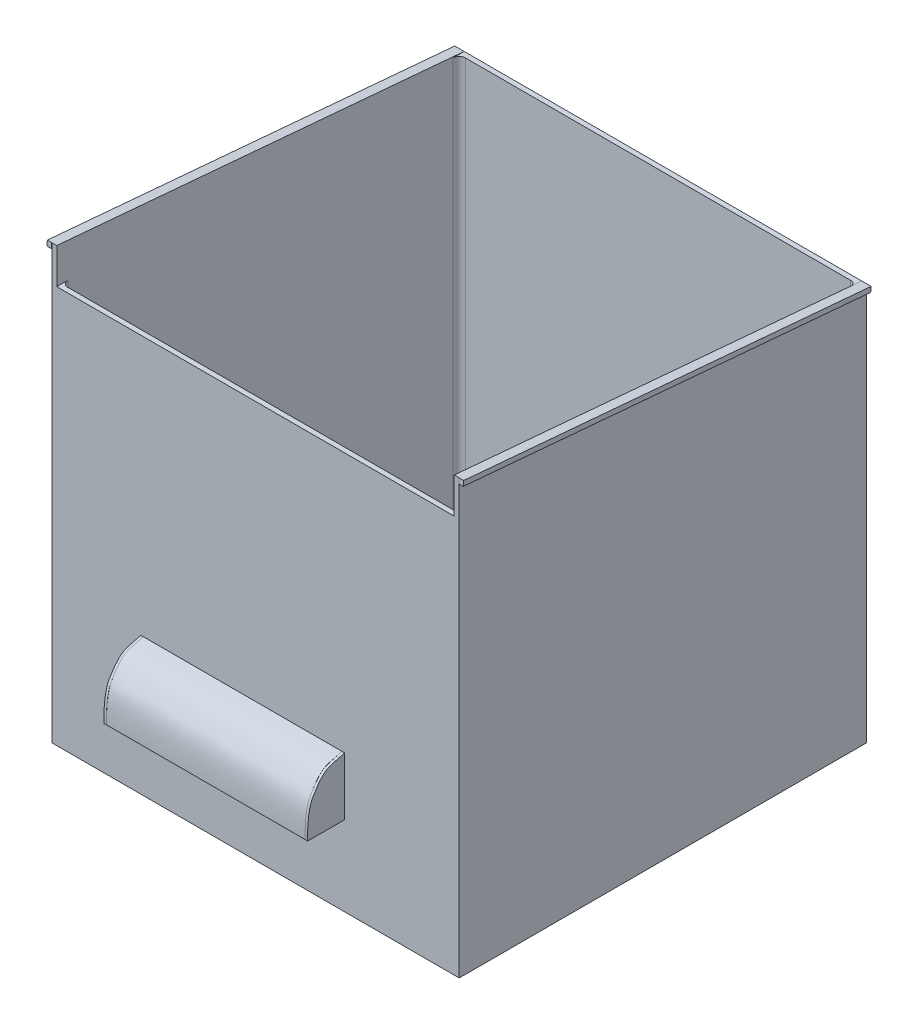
ISO-10303-21;
HEADER;
FILE_DESCRIPTION(('STEP AP214'),'2;1');
FILE_NAME('part.step','',(''),(''),'','','');
FILE_SCHEMA(('AUTOMOTIVE_DESIGN { 1 0 10303 214 1 1 1 1 }'));
ENDSEC;
DATA;
#1=APPLICATION_CONTEXT('core data for automotive mechanical design processes');
#2=APPLICATION_PROTOCOL_DEFINITION('international standard','automotive_design',2000,#1);
#3=PRODUCT_CONTEXT('',#1,'mechanical');
#4=PRODUCT('Part','Part','',(#3));
#5=PRODUCT_RELATED_PRODUCT_CATEGORY('part','',(#4));
#6=PRODUCT_DEFINITION_FORMATION('','',#4);
#7=PRODUCT_DEFINITION_CONTEXT('part definition',#1,'design');
#8=PRODUCT_DEFINITION('design','',#6,#7);
#9=PRODUCT_DEFINITION_SHAPE('','',#8);
#10=(LENGTH_UNIT() NAMED_UNIT(*) SI_UNIT(.MILLI.,.METRE.));
#11=(NAMED_UNIT(*) PLANE_ANGLE_UNIT() SI_UNIT($,.RADIAN.));
#12=(NAMED_UNIT(*) SI_UNIT($,.STERADIAN.) SOLID_ANGLE_UNIT());
#13=UNCERTAINTY_MEASURE_WITH_UNIT(LENGTH_MEASURE(1.E-05),#10,'distance_accuracy_value','');
#14=(GEOMETRIC_REPRESENTATION_CONTEXT(3) GLOBAL_UNCERTAINTY_ASSIGNED_CONTEXT((#13)) GLOBAL_UNIT_ASSIGNED_CONTEXT((#10,
#11,#12)) REPRESENTATION_CONTEXT('',''));
#15=CARTESIAN_POINT('',(0.,0.,0.));
#16=DIRECTION('',(0.,0.,1.));
#17=DIRECTION('',(1.,0.,0.));
#18=AXIS2_PLACEMENT_3D('',#15,#16,#17);
#19=CARTESIAN_POINT('',(-80.,160.,-82.));
#20=DIRECTION('',(0.,0.,1.));
#21=DIRECTION('',(1.,0.,0.));
#22=AXIS2_PLACEMENT_3D('',#19,#20,#21);
#23=PLANE('',#22);
#24=DIRECTION('',(-1.,0.,0.));
#25=VECTOR('',#24,1.);
#26=CARTESIAN_POINT('',(-80.,0.,-82.));
#27=LINE('',#26,#25);
#28=CARTESIAN_POINT('',(82.,0.,-82.));
#29=VERTEX_POINT('',#28);
#30=CARTESIAN_POINT('',(-82.,0.,-82.));
#31=VERTEX_POINT('',#30);
#32=EDGE_CURVE('E1446',#29,#31,#27,.T.);
#33=ORIENTED_EDGE('',*,*,#32,.T.);
#34=DIRECTION('',(0.,-1.,0.));
#35=VECTOR('',#34,1.);
#36=CARTESIAN_POINT('',(-82.,160.,-82.));
#37=LINE('',#36,#35);
#38=CARTESIAN_POINT('',(-82.,160.,-82.));
#39=VERTEX_POINT('',#38);
#40=EDGE_CURVE('E1466',#39,#31,#37,.T.);
#41=ORIENTED_EDGE('',*,*,#40,.F.);
#42=DIRECTION('',(-1.,0.,0.));
#43=VECTOR('',#42,1.);
#44=CARTESIAN_POINT('',(-80.,160.,-82.));
#45=LINE('',#44,#43);
#46=CARTESIAN_POINT('',(-80.,160.,-82.));
#47=VERTEX_POINT('',#46);
#48=EDGE_CURVE('E1374',#47,#39,#45,.T.);
#49=ORIENTED_EDGE('',*,*,#48,.F.);
#50=DIRECTION('',(-1.,0.,0.));
#51=VECTOR('',#50,1.);
#52=CARTESIAN_POINT('',(-80.,160.,-82.));
#53=LINE('',#52,#51);
#54=CARTESIAN_POINT('',(80.,160.,-82.));
#55=VERTEX_POINT('',#54);
#56=EDGE_CURVE('E1439',#55,#47,#53,.T.);
#57=ORIENTED_EDGE('',*,*,#56,.F.);
#58=CARTESIAN_POINT('',(82.,160.,-82.));
#59=VERTEX_POINT('',#58);
#60=EDGE_CURVE('E1434',#59,#55,#53,.T.);
#61=ORIENTED_EDGE('',*,*,#60,.F.);
#62=DIRECTION('',(0.,-1.,0.));
#63=VECTOR('',#62,1.);
#64=CARTESIAN_POINT('',(82.,160.,-82.));
#65=LINE('',#64,#63);
#66=EDGE_CURVE('E1470',#59,#29,#65,.T.);
#67=ORIENTED_EDGE('',*,*,#66,.T.);
#68=EDGE_LOOP('',(#33,#41,#49,#57,#61,#67));
#69=FACE_BOUND('',#68,.T.);
#70=CARTESIAN_POINT('',(-3.955359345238,73.7920454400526,-82.));
#71=DIRECTION('',(0.,0.,-1.));
#72=DIRECTION('',(-1.,0.,0.));
#73=AXIS2_PLACEMENT_3D('',#70,#71,#72);
#74=CIRCLE('',#73,37.7978892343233);
#75=CARTESIAN_POINT('',(29.6852588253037,91.0254211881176,-82.));
#76=VERTEX_POINT('',#75);
#77=CARTESIAN_POINT('',(-7.03025820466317,111.46465389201,-82.));
#78=VERTEX_POINT('',#77);
#79=EDGE_CURVE('E700',#76,#78,#74,.T.);
#80=ORIENTED_EDGE('',*,*,#79,.F.);
#81=DIRECTION('',(-0.49896444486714,-0.866622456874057,0.));
#82=VECTOR('',#81,1.);
#83=CARTESIAN_POINT('',(33.5445569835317,97.7284127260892,-82.));
#84=LINE('',#83,#82);
#85=CARTESIAN_POINT('',(33.4914505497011,97.6361752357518,-82.));
#86=VERTEX_POINT('',#85);
#87=EDGE_CURVE('E666',#86,#76,#84,.T.);
#88=ORIENTED_EDGE('',*,*,#87,.F.);
#89=DIRECTION('',(-1.,0.,0.));
#90=VECTOR('',#89,1.);
#91=CARTESIAN_POINT('',(39.083486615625,97.6361752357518,-82.));
#92=LINE('',#91,#90);
#93=CARTESIAN_POINT('',(39.083486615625,97.6361752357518,-82.));
#94=VERTEX_POINT('',#93);
#95=EDGE_CURVE('E696',#94,#86,#92,.T.);
#96=ORIENTED_EDGE('',*,*,#95,.F.);
#97=DIRECTION('',(-0.482604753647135,-0.875838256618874,0.));
#98=VECTOR('',#97,1.);
#99=CARTESIAN_POINT('',(47.1741612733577,112.319251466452,-82.));
#100=LINE('',#99,#98);
#101=CARTESIAN_POINT('',(47.1741612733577,112.319251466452,-82.));
#102=VERTEX_POINT('',#101);
#103=EDGE_CURVE('E671',#102,#94,#100,.T.);
#104=ORIENTED_EDGE('',*,*,#103,.F.);
#105=DIRECTION('',(-0.999875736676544,-0.0157642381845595,0.));
#106=VECTOR('',#105,1.);
#107=CARTESIAN_POINT('',(47.1741612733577,112.319251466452,-82.));
#108=LINE('',#107,#106);
#109=EDGE_CURVE('E682',#102,#78,#108,.T.);
#110=ORIENTED_EDGE('',*,*,#109,.T.);
#111=EDGE_LOOP('',(#80,#88,#96,#104,#110));
#112=FACE_BOUND('',#111,.T.);
#113=ADVANCED_FACE('F93',(#69,#112),#23,.F.);
#114=CARTESIAN_POINT('',(-80.,160.,82.));
#115=DIRECTION('',(0.,0.,-1.));
#116=DIRECTION('',(-1.,0.,0.));
#117=AXIS2_PLACEMENT_3D('',#114,#115,#116);
#118=PLANE('',#117);
#119=DIRECTION('',(1.,0.,0.));
#120=VECTOR('',#119,1.);
#121=CARTESIAN_POINT('',(-80.,0.,82.));
#122=LINE('',#121,#120);
#123=CARTESIAN_POINT('',(-82.,0.,82.));
#124=VERTEX_POINT('',#123);
#125=CARTESIAN_POINT('',(82.,0.,82.));
#126=VERTEX_POINT('',#125);
#127=EDGE_CURVE('E1453',#124,#126,#122,.T.);
#128=ORIENTED_EDGE('',*,*,#127,.T.);
#129=DIRECTION('',(0.,-1.,0.));
#130=VECTOR('',#129,1.);
#131=CARTESIAN_POINT('',(82.,160.,82.));
#132=LINE('',#131,#130);
#133=CARTESIAN_POINT('',(82.,172.340501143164,82.));
#134=VERTEX_POINT('',#133);
#135=EDGE_CURVE('E1442',#134,#126,#132,.T.);
#136=ORIENTED_EDGE('',*,*,#135,.F.);
#137=CARTESIAN_POINT('',(82.,174.34814081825,82.));
#138=VERTEX_POINT('',#137);
#139=EDGE_CURVE('E1457',#138,#134,#132,.T.);
#140=ORIENTED_EDGE('',*,*,#139,.F.);
#141=DIRECTION('',(1.,0.,0.));
#142=VECTOR('',#141,1.);
#143=CARTESIAN_POINT('',(80.,174.34814081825,82.));
#144=LINE('',#143,#142);
#145=CARTESIAN_POINT('',(80.,174.34814081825,82.));
#146=VERTEX_POINT('',#145);
#147=EDGE_CURVE('E1393',#146,#138,#144,.T.);
#148=ORIENTED_EDGE('',*,*,#147,.F.);
#149=DIRECTION('',(0.,-1.,0.));
#150=VECTOR('',#149,1.);
#151=CARTESIAN_POINT('',(80.,160.,82.));
#152=LINE('',#151,#150);
#153=CARTESIAN_POINT('',(80.,160.,82.));
#154=VERTEX_POINT('',#153);
#155=EDGE_CURVE('E1389',#146,#154,#152,.T.);
#156=ORIENTED_EDGE('',*,*,#155,.T.);
#157=DIRECTION('',(1.,0.,0.));
#158=VECTOR('',#157,1.);
#159=CARTESIAN_POINT('',(-80.,160.,82.));
#160=LINE('',#159,#158);
#161=CARTESIAN_POINT('',(-80.,160.,82.));
#162=VERTEX_POINT('',#161);
#163=EDGE_CURVE('E1438',#162,#154,#160,.T.);
#164=ORIENTED_EDGE('',*,*,#163,.F.);
#165=DIRECTION('',(0.,1.,0.));
#166=VECTOR('',#165,1.);
#167=CARTESIAN_POINT('',(-80.,174.34814081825,82.));
#168=LINE('',#167,#166);
#169=CARTESIAN_POINT('',(-80.,174.34814081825,82.));
#170=VERTEX_POINT('',#169);
#171=EDGE_CURVE('E1365',#162,#170,#168,.T.);
#172=ORIENTED_EDGE('',*,*,#171,.T.);
#173=DIRECTION('',(-1.,0.,0.));
#174=VECTOR('',#173,1.);
#175=CARTESIAN_POINT('',(-80.,174.34814081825,82.));
#176=LINE('',#175,#174);
#177=CARTESIAN_POINT('',(-82.,174.34814081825,82.0000000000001));
#178=VERTEX_POINT('',#177);
#179=EDGE_CURVE('E1373',#170,#178,#176,.T.);
#180=ORIENTED_EDGE('',*,*,#179,.T.);
#181=DIRECTION('',(0.,-1.,0.));
#182=VECTOR('',#181,1.);
#183=CARTESIAN_POINT('',(-82.,160.,82.));
#184=LINE('',#183,#182);
#185=CARTESIAN_POINT('',(-82.,172.340501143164,82.));
#186=VERTEX_POINT('',#185);
#187=EDGE_CURVE('E1462',#178,#186,#184,.T.);
#188=ORIENTED_EDGE('',*,*,#187,.T.);
#189=EDGE_CURVE('E1461',#186,#124,#184,.T.);
#190=ORIENTED_EDGE('',*,*,#189,.T.);
#191=EDGE_LOOP('',(#128,#136,#140,#148,#156,#164,#172,#180,#188,#190));
#192=FACE_BOUND('',#191,.T.);
#193=DIRECTION('',(1.,0.,0.));
#194=VECTOR('',#193,1.);
#195=CARTESIAN_POINT('',(-46.1171291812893,55.4021677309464,82.0000072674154));
#196=LINE('',#195,#194);
#197=CARTESIAN_POINT('',(-46.1171291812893,55.4021677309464,82.0000036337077));
#198=VERTEX_POINT('',#197);
#199=CARTESIAN_POINT('',(-45.1171291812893,55.4021729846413,82.));
#200=VERTEX_POINT('',#199);
#201=EDGE_CURVE('E1535',#198,#200,#196,.T.);
#202=ORIENTED_EDGE('',*,*,#201,.T.);
#203=DIRECTION('',(-1.,0.,0.));
#204=VECTOR('',#203,1.);
#205=CARTESIAN_POINT('',(34.8828708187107,55.4021842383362,82.));
#206=LINE('',#205,#204);
#207=CARTESIAN_POINT('',(34.8828708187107,55.4021842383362,82.));
#208=VERTEX_POINT('',#207);
#209=EDGE_CURVE('E1477',#208,#200,#206,.T.);
#210=ORIENTED_EDGE('',*,*,#209,.F.);
#211=DIRECTION('',(-1.,0.,0.));
#212=VECTOR('',#211,1.);
#213=CARTESIAN_POINT('',(35.8828708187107,55.4021842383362,82.));
#214=LINE('',#213,#212);
#215=CARTESIAN_POINT('',(35.8828708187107,55.4021842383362,82.));
#216=VERTEX_POINT('',#215);
#217=EDGE_CURVE('E789',#216,#208,#214,.T.);
#218=ORIENTED_EDGE('',*,*,#217,.F.);
#219=DIRECTION('',(0.,1.,0.));
#220=VECTOR('',#219,1.);
#221=CARTESIAN_POINT('',(35.8828708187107,32.1276898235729,82.));
#222=LINE('',#221,#220);
#223=CARTESIAN_POINT('',(35.8828708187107,32.1276898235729,82.));
#224=VERTEX_POINT('',#223);
#225=EDGE_CURVE('E786',#224,#216,#222,.T.);
#226=ORIENTED_EDGE('',*,*,#225,.F.);
#227=DIRECTION('',(-1.,0.,0.));
#228=VECTOR('',#227,1.);
#229=CARTESIAN_POINT('',(35.8828708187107,32.1276898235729,82.));
#230=LINE('',#229,#228);
#231=CARTESIAN_POINT('',(34.8828708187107,32.1276898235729,82.));
#232=VERTEX_POINT('',#231);
#233=EDGE_CURVE('E807',#224,#232,#230,.T.);
#234=ORIENTED_EDGE('',*,*,#233,.T.);
#235=DIRECTION('',(0.,1.,0.));
#236=VECTOR('',#235,1.);
#237=CARTESIAN_POINT('',(34.8828708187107,32.1276898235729,82.));
#238=LINE('',#237,#236);
#239=CARTESIAN_POINT('',(34.8828708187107,38.4021842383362,82.));
#240=VERTEX_POINT('',#239);
#241=EDGE_CURVE('E778',#232,#240,#238,.T.);
#242=ORIENTED_EDGE('',*,*,#241,.T.);
#243=DIRECTION('',(1.,0.,0.));
#244=VECTOR('',#243,1.);
#245=CARTESIAN_POINT('',(-45.1171291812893,38.4021842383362,82.));
#246=LINE('',#245,#244);
#247=CARTESIAN_POINT('',(-45.1171291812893,38.4021842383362,82.));
#248=VERTEX_POINT('',#247);
#249=EDGE_CURVE('E1523',#248,#240,#246,.T.);
#250=ORIENTED_EDGE('',*,*,#249,.F.);
#251=DIRECTION('',(0.,-1.,0.));
#252=VECTOR('',#251,1.);
#253=CARTESIAN_POINT('',(-45.1171291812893,32.1276733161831,82.0000072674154));
#254=LINE('',#253,#252);
#255=CARTESIAN_POINT('',(-45.1171291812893,32.1276733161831,82.));
#256=VERTEX_POINT('',#255);
#257=EDGE_CURVE('E1550',#248,#256,#254,.T.);
#258=ORIENTED_EDGE('',*,*,#257,.T.);
#259=DIRECTION('',(1.,0.,0.));
#260=VECTOR('',#259,1.);
#261=CARTESIAN_POINT('',(-46.1171291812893,32.1276733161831,82.0000072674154));
#262=LINE('',#261,#260);
#263=CARTESIAN_POINT('',(-46.1171291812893,32.1276733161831,82.0000036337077));
#264=VERTEX_POINT('',#263);
#265=EDGE_CURVE('E1531',#264,#256,#262,.T.);
#266=ORIENTED_EDGE('',*,*,#265,.F.);
#267=DIRECTION('',(0.,-1.,0.));
#268=VECTOR('',#267,1.);
#269=CARTESIAN_POINT('',(-46.1171291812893,44.2351512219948,82.));
#270=LINE('',#269,#268);
#271=EDGE_CURVE('E97',#198,#264,#270,.T.);
#272=ORIENTED_EDGE('',*,*,#271,.F.);
#273=EDGE_LOOP('',(#202,#210,#218,#226,#234,#242,#250,#258,#266,#272));
#274=FACE_BOUND('',#273,.T.);
#275=ADVANCED_FACE('F2049',(#192,#274),#118,.F.);
#276=CARTESIAN_POINT('',(-45.1171291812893,44.3931757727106,95.6351426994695));
#277=DIRECTION('',(-1.,0.,0.));
#278=DIRECTION('',(0.,0.,1.));
#279=AXIS2_PLACEMENT_3D('',#276,#277,#278);
#280=PLANE('',#279);
#281=CARTESIAN_POINT('',(-45.1171291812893,55.4021842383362,82.));
#282=CARTESIAN_POINT('',(-45.1171291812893,54.603714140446,85.520005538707));
#283=CARTESIAN_POINT('',(-45.1171291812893,54.1852653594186,87.128040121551));
#284=CARTESIAN_POINT('',(-45.1171291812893,53.4895477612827,88.9752360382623));
#285=CARTESIAN_POINT('',(-45.1171291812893,52.4948071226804,90.4786824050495));
#286=CARTESIAN_POINT('',(-45.1171291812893,50.2208674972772,92.4263299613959));
#287=CARTESIAN_POINT('',(-45.1171291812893,47.6887088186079,94.073872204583));
#288=CARTESIAN_POINT('',(-45.1171291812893,46.1359142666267,95.0561421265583));
#289=CARTESIAN_POINT('',(-45.1171291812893,40.9579900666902,96.799623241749));
#290=CARTESIAN_POINT('',(-45.1171291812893,35.8752727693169,96.8914365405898));
#291=CARTESIAN_POINT('',(-45.1171291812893,32.1276898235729,96.8644720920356));
#292=B_SPLINE_CURVE_WITH_KNOTS('',3,(#281,#282,#283,#284,#285,#286,#287,#288,#289,#290,#291),
.UNSPECIFIED.,.F.,.F.,(4,1,1,1,1,1,1,1,4),(0.,0.0345633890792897,0.0495829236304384,
0.150195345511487,0.267258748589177,0.300304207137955,0.460611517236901,0.504296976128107,1.),.UNSPECIFIED.);
#293=CARTESIAN_POINT('',(-45.1171291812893,47.4658713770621,94.1974536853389));
#294=VERTEX_POINT('',#293);
#295=EDGE_CURVE('E820',#200,#294,#292,.T.);
#296=ORIENTED_EDGE('',*,*,#295,.F.);
#297=CARTESIAN_POINT('',(-45.1171291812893,32.1276733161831,96.8644793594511));
#298=CARTESIAN_POINT('',(-45.1171291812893,35.5922559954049,96.9637467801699));
#299=CARTESIAN_POINT('',(-45.1171291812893,40.8008712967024,96.9054609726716));
#300=CARTESIAN_POINT('',(-45.1171291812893,45.9783465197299,95.1620881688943));
#301=CARTESIAN_POINT('',(-45.1171291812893,47.5183464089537,94.1752788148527));
#302=CARTESIAN_POINT('',(-45.1171291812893,50.0566561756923,92.5248051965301));
#303=CARTESIAN_POINT('',(-45.1171291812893,52.2802410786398,90.6048350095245));
#304=CARTESIAN_POINT('',(-45.1171291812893,53.4124976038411,89.0206093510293));
#305=CARTESIAN_POINT('',(-45.1171291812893,53.9816493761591,87.2479460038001));
#306=CARTESIAN_POINT('',(-45.1171291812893,54.6036976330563,85.5200128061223));
#307=CARTESIAN_POINT('',(-45.1171291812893,55.4021677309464,82.0000072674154));
#308=B_SPLINE_CURVE_WITH_KNOTS('',3,(#297,#298,#299,#300,#301,#302,#303,#304,#305,#306,#307),
.UNSPECIFIED.,.F.,.F.,(4,1,1,1,1,1,1,1,4),(0.,0.495703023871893,0.539388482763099,
0.699695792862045,0.732741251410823,0.849804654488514,0.950417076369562,0.96543661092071,1.),.UNSPECIFIED.);
#309=EDGE_CURVE('E724',#294,#200,#308,.T.);
#310=ORIENTED_EDGE('',*,*,#309,.F.);
#311=EDGE_LOOP('',(#296,#310));
#312=FACE_BOUND('',#311,.T.);
#313=ADVANCED_FACE('F2052',(#312),#280,.T.);
#314=CARTESIAN_POINT('',(34.8828708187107,44.3931757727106,95.6351426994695));
#315=DIRECTION('',(-1.,0.,0.));
#316=DIRECTION('',(0.,0.,1.));
#317=AXIS2_PLACEMENT_3D('',#314,#315,#316);
#318=PLANE('',#317);
#319=CARTESIAN_POINT('',(34.8828708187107,55.4021842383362,82.));
#320=CARTESIAN_POINT('',(34.8828708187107,54.603714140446,85.520005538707));
#321=CARTESIAN_POINT('',(34.8828708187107,53.9816658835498,87.2479387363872));
#322=CARTESIAN_POINT('',(34.8828708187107,53.4125141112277,89.0206020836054));
#323=CARTESIAN_POINT('',(34.8828708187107,52.2802575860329,90.6048277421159));
#324=CARTESIAN_POINT('',(34.8828708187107,50.0566726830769,92.5247979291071));
#325=CARTESIAN_POINT('',(34.8828708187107,47.5183629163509,94.1752715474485));
#326=CARTESIAN_POINT('',(34.8828708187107,45.9783630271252,95.1620809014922));
#327=CARTESIAN_POINT('',(34.8828708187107,40.8008878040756,96.9054537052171));
#328=CARTESIAN_POINT('',(34.8828708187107,35.592272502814,96.9637395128));
#329=CARTESIAN_POINT('',(34.8828708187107,32.1276898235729,96.8644720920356));
#330=B_SPLINE_CURVE_WITH_KNOTS('',3,(#319,#320,#321,#322,#323,#324,#325,#326,#327,#328,#329),
.UNSPECIFIED.,.F.,.F.,(4,1,1,1,1,1,1,1,4),(0.,0.0345633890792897,0.0495829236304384,
0.150195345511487,0.267258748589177,0.300304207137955,0.460611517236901,0.504296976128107,1.),.UNSPECIFIED.);
#331=CARTESIAN_POINT('',(34.8828708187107,47.4661136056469,94.1973059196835));
#332=VERTEX_POINT('',#331);
#333=EDGE_CURVE('E790',#208,#332,#330,.T.);
#334=ORIENTED_EDGE('',*,*,#333,.F.);
#335=CARTESIAN_POINT('',(34.8828708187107,55.4021842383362,82.));
#336=CARTESIAN_POINT('',(34.8828708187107,54.603714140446,85.520005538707));
#337=CARTESIAN_POINT('',(34.8828708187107,54.1852653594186,87.128040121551));
#338=CARTESIAN_POINT('',(34.8828708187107,53.4895477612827,88.9752360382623));
#339=CARTESIAN_POINT('',(34.8828708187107,52.4948071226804,90.4786824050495));
#340=CARTESIAN_POINT('',(34.8828708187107,50.2208674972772,92.4263299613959));
#341=CARTESIAN_POINT('',(34.8828708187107,47.6887088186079,94.073872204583));
#342=CARTESIAN_POINT('',(34.8828708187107,46.1359142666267,95.0561421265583));
#343=CARTESIAN_POINT('',(34.8828708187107,40.9579900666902,96.799623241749));
#344=CARTESIAN_POINT('',(34.8828708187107,35.8752727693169,96.8914365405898));
#345=CARTESIAN_POINT('',(34.8828708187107,32.1276898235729,96.8644720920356));
#346=B_SPLINE_CURVE_WITH_KNOTS('',3,(#335,#336,#337,#338,#339,#340,#341,#342,#343,#344,#345),
.UNSPECIFIED.,.F.,.F.,(4,1,1,1,1,1,1,1,4),(0.,0.0345633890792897,0.0495829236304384,
0.150195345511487,0.267258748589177,0.300304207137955,0.460611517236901,0.504296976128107,1.),.UNSPECIFIED.);
#347=EDGE_CURVE('E821',#208,#332,#346,.T.);
#348=ORIENTED_EDGE('',*,*,#347,.T.);
#349=EDGE_LOOP('',(#334,#348));
#350=FACE_BOUND('',#349,.T.);
#351=ADVANCED_FACE('F767',(#350),#318,.F.);
#352=CARTESIAN_POINT('',(-82.,160.,-80.));
#353=DIRECTION('',(1.,0.,0.));
#354=DIRECTION('',(0.,0.,-1.));
#355=AXIS2_PLACEMENT_3D('',#352,#353,#354);
#356=PLANE('',#355);
#357=DIRECTION('',(0.,0.,1.));
#358=VECTOR('',#357,1.);
#359=CARTESIAN_POINT('',(-82.,93.476357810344,0.));
#360=LINE('',#359,#358);
#361=CARTESIAN_POINT('',(-82.,93.476357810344,-73.0472229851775));
#362=VERTEX_POINT('',#361);
#363=CARTESIAN_POINT('',(-82.,93.476357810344,-61.6712229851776));
#364=VERTEX_POINT('',#363);
#365=EDGE_CURVE('E1734',#362,#364,#360,.T.);
#366=ORIENTED_EDGE('',*,*,#365,.T.);
#367=DIRECTION('',(0.,-1.,0.));
#368=VECTOR('',#367,1.);
#369=CARTESIAN_POINT('',(-82.,0.,-61.6712229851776));
#370=LINE('',#369,#368);
#371=CARTESIAN_POINT('',(-82.,52.400234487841,-61.6712229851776));
#372=VERTEX_POINT('',#371);
#373=EDGE_CURVE('E1669',#364,#372,#370,.T.);
#374=ORIENTED_EDGE('',*,*,#373,.T.);
#375=DIRECTION('',(0.,0.,1.));
#376=VECTOR('',#375,1.);
#377=CARTESIAN_POINT('',(-82.,52.400234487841,0.));
#378=LINE('',#377,#376);
#379=CARTESIAN_POINT('',(-82.,52.400234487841,-73.0472229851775));
#380=VERTEX_POINT('',#379);
#381=EDGE_CURVE('E1721',#380,#372,#378,.T.);
#382=ORIENTED_EDGE('',*,*,#381,.F.);
#383=DIRECTION('',(0.,-1.,0.));
#384=VECTOR('',#383,1.);
#385=CARTESIAN_POINT('',(-82.,0.,-73.0472229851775));
#386=LINE('',#385,#384);
#387=EDGE_CURVE('E1737',#362,#380,#386,.T.);
#388=ORIENTED_EDGE('',*,*,#387,.F.);
#389=EDGE_LOOP('',(#366,#374,#382,#388));
#390=FACE_BOUND('',#389,.T.);
#391=DIRECTION('',(0.,0.,1.));
#392=VECTOR('',#391,1.);
#393=CARTESIAN_POINT('',(-82.,112.43798399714,0.));
#394=LINE('',#393,#392);
#395=CARTESIAN_POINT('',(-82.,112.43798399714,60.6102898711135));
#396=VERTEX_POINT('',#395);
#397=CARTESIAN_POINT('',(-82.,112.43798399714,71.7292038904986));
#398=VERTEX_POINT('',#397);
#399=EDGE_CURVE('E1689',#396,#398,#394,.T.);
#400=ORIENTED_EDGE('',*,*,#399,.T.);
#401=DIRECTION('',(0.,-1.,0.));
#402=VECTOR('',#401,1.);
#403=CARTESIAN_POINT('',(-82.,0.,71.7292038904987));
#404=LINE('',#403,#402);
#405=CARTESIAN_POINT('',(-82.,52.230652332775,71.7292038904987));
#406=VERTEX_POINT('',#405);
#407=EDGE_CURVE('E1686',#398,#406,#404,.T.);
#408=ORIENTED_EDGE('',*,*,#407,.T.);
#409=DIRECTION('',(0.,0.,1.));
#410=VECTOR('',#409,1.);
#411=CARTESIAN_POINT('',(-82.,52.230652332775,0.));
#412=LINE('',#411,#410);
#413=CARTESIAN_POINT('',(-82.,52.230652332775,60.6102898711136));
#414=VERTEX_POINT('',#413);
#415=EDGE_CURVE('E1675',#414,#406,#412,.T.);
#416=ORIENTED_EDGE('',*,*,#415,.F.);
#417=DIRECTION('',(0.,-1.,0.));
#418=VECTOR('',#417,1.);
#419=CARTESIAN_POINT('',(-82.,0.,60.6102898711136));
#420=LINE('',#419,#418);
#421=EDGE_CURVE('E1693',#396,#414,#420,.T.);
#422=ORIENTED_EDGE('',*,*,#421,.F.);
#423=EDGE_LOOP('',(#400,#408,#416,#422));
#424=FACE_BOUND('',#423,.T.);
#425=DIRECTION('',(0.,1.,0.));
#426=VECTOR('',#425,1.);
#427=CARTESIAN_POINT('',(-82.,0.,-25.4706641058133));
#428=LINE('',#427,#426);
#429=CARTESIAN_POINT('',(-82.,52.400234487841,-25.4706641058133));
#430=VERTEX_POINT('',#429);
#431=CARTESIAN_POINT('',(-82.,75.9932807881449,-25.4706641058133));
#432=VERTEX_POINT('',#431);
#433=EDGE_CURVE('E1846',#430,#432,#428,.T.);
#434=ORIENTED_EDGE('',*,*,#433,.T.);
#435=CARTESIAN_POINT('',(-82.,75.9932807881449,-25.4706641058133));
#436=CARTESIAN_POINT('',(-82.,79.5432977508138,-25.4633518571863));
#437=CARTESIAN_POINT('',(-82.,86.1320854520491,-30.090890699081));
#438=CARTESIAN_POINT('',(-82.,84.7247833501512,-41.913695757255));
#439=CARTESIAN_POINT('',(-82.,77.9252542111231,-44.8080760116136));
#440=CARTESIAN_POINT('',(-82.,74.6746406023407,-45.0113231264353));
#441=B_SPLINE_CURVE_WITH_KNOTS('',3,(#435,#436,#437,#438,#439,#440),.UNSPECIFIED.,.F.,.F.,(4,1,
1,4),(0.,0.356222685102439,0.665400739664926,1.),.UNSPECIFIED.);
#442=CARTESIAN_POINT('',(-82.,74.6746406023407,-45.0113231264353));
#443=VERTEX_POINT('',#442);
#444=EDGE_CURVE('E1715',#432,#443,#441,.T.);
#445=ORIENTED_EDGE('',*,*,#444,.T.);
#446=DIRECTION('',(0.,1.,0.));
#447=VECTOR('',#446,1.);
#448=CARTESIAN_POINT('',(-82.,0.,-45.0113231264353));
#449=LINE('',#448,#447);
#450=CARTESIAN_POINT('',(-82.,52.400234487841,-45.0113231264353));
#451=VERTEX_POINT('',#450);
#452=EDGE_CURVE('E1079',#451,#443,#449,.T.);
#453=ORIENTED_EDGE('',*,*,#452,.F.);
#454=DIRECTION('',(0.,0.,1.));
#455=VECTOR('',#454,1.);
#456=CARTESIAN_POINT('',(-82.,52.400234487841,0.));
#457=LINE('',#456,#455);
#458=CARTESIAN_POINT('',(-82.,52.400234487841,-55.5247880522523));
#459=VERTEX_POINT('',#458);
#460=EDGE_CURVE('E1876',#459,#451,#457,.T.);
#461=ORIENTED_EDGE('',*,*,#460,.F.);
#462=DIRECTION('',(0.,-1.,0.));
#463=VECTOR('',#462,1.);
#464=CARTESIAN_POINT('',(-82.,0.,-55.5247880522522));
#465=LINE('',#464,#463);
#466=CARTESIAN_POINT('',(-82.,93.476357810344,-55.5247880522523));
#467=VERTEX_POINT('',#466);
#468=EDGE_CURVE('E1872',#467,#459,#465,.T.);
#469=ORIENTED_EDGE('',*,*,#468,.F.);
#470=DIRECTION('',(0.,0.,1.));
#471=VECTOR('',#470,1.);
#472=CARTESIAN_POINT('',(-82.,93.476357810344,0.));
#473=LINE('',#472,#471);
#474=CARTESIAN_POINT('',(-82.,93.476357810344,-45.0113231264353));
#475=VERTEX_POINT('',#474);
#476=EDGE_CURVE('E1869',#467,#475,#473,.T.);
#477=ORIENTED_EDGE('',*,*,#476,.T.);
#478=DIRECTION('',(0.,-1.,0.));
#479=VECTOR('',#478,1.);
#480=CARTESIAN_POINT('',(-82.,0.,-45.0113231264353));
#481=LINE('',#480,#479);
#482=CARTESIAN_POINT('',(-82.,87.1725085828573,-45.0113231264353));
#483=VERTEX_POINT('',#482);
#484=EDGE_CURVE('E1863',#475,#483,#481,.T.);
#485=ORIENTED_EDGE('',*,*,#484,.T.);
#486=CARTESIAN_POINT('',(-82.,87.1725085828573,-45.0113231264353));
#487=CARTESIAN_POINT('',(-82.,89.3232665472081,-43.9351262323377));
#488=CARTESIAN_POINT('',(-82.,92.1396018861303,-40.5874805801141));
#489=CARTESIAN_POINT('',(-82.,94.7526165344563,-33.8567138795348));
#490=CARTESIAN_POINT('',(-82.,94.1875448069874,-26.7625225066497));
#491=CARTESIAN_POINT('',(-82.,89.2789199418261,-17.0519950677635));
#492=CARTESIAN_POINT('',(-82.,80.5283026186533,-14.4369791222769));
#493=CARTESIAN_POINT('',(-82.,75.1322892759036,-14.8422267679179));
#494=B_SPLINE_CURVE_WITH_KNOTS('',3,(#486,#487,#488,#489,#490,#491,#492,#493),.UNSPECIFIED.,.F.,
.F.,(4,1,1,1,1,4),(0.,0.15997434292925,0.285001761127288,0.480268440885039,0.619535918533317,
1.),.UNSPECIFIED.);
#495=CARTESIAN_POINT('',(-82.,75.1322892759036,-14.8422267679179));
#496=VERTEX_POINT('',#495);
#497=EDGE_CURVE('E1858',#483,#496,#494,.T.);
#498=ORIENTED_EDGE('',*,*,#497,.T.);
#499=DIRECTION('',(0.,-1.,0.));
#500=VECTOR('',#499,1.);
#501=CARTESIAN_POINT('',(-82.,0.,-14.8422267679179));
#502=LINE('',#501,#500);
#503=CARTESIAN_POINT('',(-82.,52.400234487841,-14.8422267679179));
#504=VERTEX_POINT('',#503);
#505=EDGE_CURVE('E1855',#496,#504,#502,.T.);
#506=ORIENTED_EDGE('',*,*,#505,.T.);
#507=DIRECTION('',(0.,0.,-1.));
#508=VECTOR('',#507,1.);
#509=CARTESIAN_POINT('',(-82.,52.400234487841,0.));
#510=LINE('',#509,#508);
#511=EDGE_CURVE('E1852',#504,#430,#510,.T.);
#512=ORIENTED_EDGE('',*,*,#511,.T.);
#513=EDGE_LOOP('',(#434,#445,#453,#461,#469,#477,#485,#498,#506,#512));
#514=FACE_BOUND('',#513,.T.);
#515=ORIENTED_EDGE('',*,*,#189,.F.);
#516=DIRECTION('',(0.,-0.0871557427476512,-0.996194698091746));
#517=VECTOR('',#516,1.);
#518=CARTESIAN_POINT('',(-82.,158.007610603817,-81.8256885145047));
#519=LINE('',#518,#517);
#520=CARTESIAN_POINT('',(-82.,158.007610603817,-81.8256885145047));
#521=VERTEX_POINT('',#520);
#522=EDGE_CURVE('E1284',#186,#521,#519,.T.);
#523=ORIENTED_EDGE('',*,*,#522,.T.);
#524=DIRECTION('',(0.,0.996194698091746,-0.0871557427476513));
#525=VECTOR('',#524,1.);
#526=CARTESIAN_POINT('',(-82.,158.007610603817,-81.8256885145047));
#527=LINE('',#526,#525);
#528=EDGE_CURVE('E1296',#521,#39,#527,.T.);
#529=ORIENTED_EDGE('',*,*,#528,.T.);
#530=ORIENTED_EDGE('',*,*,#40,.T.);
#531=DIRECTION('',(0.,0.,1.));
#532=VECTOR('',#531,1.);
#533=CARTESIAN_POINT('',(-82.,0.,-80.));
#534=LINE('',#533,#532);
#535=EDGE_CURVE('E1449',#31,#124,#534,.T.);
#536=ORIENTED_EDGE('',*,*,#535,.T.);
#537=EDGE_LOOP('',(#515,#523,#529,#530,#536));
#538=FACE_BOUND('',#537,.T.);
#539=CARTESIAN_POINT('',(-82.,59.6933563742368,52.3224655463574));
#540=CARTESIAN_POINT('',(-82.,57.5399105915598,50.9857746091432));
#541=CARTESIAN_POINT('',(-82.,54.8113211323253,47.3167281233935));
#542=CARTESIAN_POINT('',(-82.,51.8760475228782,40.9574631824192));
#543=CARTESIAN_POINT('',(-82.,51.4662265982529,34.2577077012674));
#544=CARTESIAN_POINT('',(-82.,51.9754348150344,26.8267796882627));
#545=CARTESIAN_POINT('',(-82.,56.151529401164,19.8757746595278));
#546=CARTESIAN_POINT('',(-82.,63.7540873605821,13.5111268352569));
#547=CARTESIAN_POINT('',(-82.,74.0635011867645,12.1913017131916));
#548=CARTESIAN_POINT('',(-82.,86.428641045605,15.8181522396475));
#549=CARTESIAN_POINT('',(-82.,94.8907954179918,27.7823778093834));
#550=CARTESIAN_POINT('',(-82.,93.8593681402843,43.3788359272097));
#551=CARTESIAN_POINT('',(-82.,85.4010744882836,52.7342195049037));
#552=CARTESIAN_POINT('',(-82.,78.4651373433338,54.3765651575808));
#553=CARTESIAN_POINT('',(-82.,76.3037605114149,54.9599354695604));
#554=B_SPLINE_CURVE_WITH_KNOTS('',3,(#539,#540,#541,#542,#543,#544,#545,#546,#547,#548,#549,
#550,#551,#552,#553),.UNSPECIFIED.,.F.,.F.,(4,1,1,1,1,1,1,1,1,1,1,1,4),(0.,0.0647126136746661,
0.115490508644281,0.178952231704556,0.235791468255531,0.305170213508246,0.381715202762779,
0.485058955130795,0.557907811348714,0.707956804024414,0.817891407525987,0.942015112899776,1.),.UNSPECIFIED.);
#555=CARTESIAN_POINT('',(-82.,59.6933563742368,52.3224655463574));
#556=VERTEX_POINT('',#555);
#557=CARTESIAN_POINT('',(-82.,76.3037605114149,54.9599354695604));
#558=VERTEX_POINT('',#557);
#559=EDGE_CURVE('E1120',#556,#558,#554,.T.);
#560=ORIENTED_EDGE('',*,*,#559,.T.);
#561=CARTESIAN_POINT('',(-82.,76.3037605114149,54.9599354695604));
#562=CARTESIAN_POINT('',(-82.,75.3164944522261,55.2875718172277));
#563=CARTESIAN_POINT('',(-82.,72.8695059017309,55.170358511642));
#564=CARTESIAN_POINT('',(-82.,70.439811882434,55.265681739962));
#565=CARTESIAN_POINT('',(-82.,69.0131264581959,55.2268323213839));
#566=B_SPLINE_CURVE_WITH_KNOTS('',3,(#561,#562,#563,#564,#565),.UNSPECIFIED.,.F.,.F.,(4,1,4),
(0.,0.415978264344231,1.),.UNSPECIFIED.);
#567=CARTESIAN_POINT('',(-82.,69.0131264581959,55.2268323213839));
#568=VERTEX_POINT('',#567);
#569=EDGE_CURVE('E1070',#558,#568,#566,.T.);
#570=ORIENTED_EDGE('',*,*,#569,.T.);
#571=DIRECTION('',(0.,0.,1.));
#572=VECTOR('',#571,1.);
#573=CARTESIAN_POINT('',(-82.,69.0131264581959,0.));
#574=LINE('',#573,#572);
#575=CARTESIAN_POINT('',(-82.,69.0131264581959,23.1048221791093));
#576=VERTEX_POINT('',#575);
#577=EDGE_CURVE('E1139',#576,#568,#574,.T.);
#578=ORIENTED_EDGE('',*,*,#577,.F.);
#579=CARTESIAN_POINT('',(-82.,69.0131264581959,23.1048221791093));
#580=CARTESIAN_POINT('',(-82.,64.1195871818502,24.3602894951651));
#581=CARTESIAN_POINT('',(-82.,60.9745599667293,28.6723980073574));
#582=CARTESIAN_POINT('',(-82.,60.3719395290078,36.8396359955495));
#583=CARTESIAN_POINT('',(-82.,62.8425112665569,42.3935287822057));
#584=CARTESIAN_POINT('',(-82.,65.3444526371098,44.8909326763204));
#585=B_SPLINE_CURVE_WITH_KNOTS('',3,(#579,#580,#581,#582,#583,#584),.UNSPECIFIED.,.F.,.F.,(4,1,
1,4),(0.,0.510514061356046,0.610514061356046,1.),.UNSPECIFIED.);
#586=CARTESIAN_POINT('',(-82.,65.3444526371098,44.8909326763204));
#587=VERTEX_POINT('',#586);
#588=EDGE_CURVE('E1134',#576,#587,#585,.T.);
#589=ORIENTED_EDGE('',*,*,#588,.T.);
#590=DIRECTION('',(0.,-0.605295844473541,0.796000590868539));
#591=VECTOR('',#590,1.);
#592=CARTESIAN_POINT('',(-82.,63.0325150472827,47.9312702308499));
#593=LINE('',#592,#591);
#594=EDGE_CURVE('E1128',#587,#556,#593,.T.);
#595=ORIENTED_EDGE('',*,*,#594,.T.);
#596=EDGE_LOOP('',(#560,#570,#578,#589,#595));
#597=FACE_BOUND('',#596,.T.);
#598=DIRECTION('',(0.,0.,1.));
#599=VECTOR('',#598,1.);
#600=CARTESIAN_POINT('',(-82.,111.651038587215,0.));
#601=LINE('',#600,#599);
#602=CARTESIAN_POINT('',(-82.,111.651038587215,-73.0472229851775));
#603=VERTEX_POINT('',#602);
#604=CARTESIAN_POINT('',(-82.,111.651038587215,-61.6712229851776));
#605=VERTEX_POINT('',#604);
#606=EDGE_CURVE('E1644',#603,#605,#601,.T.);
#607=ORIENTED_EDGE('',*,*,#606,.T.);
#608=DIRECTION('',(0.,-1.,0.));
#609=VECTOR('',#608,1.);
#610=CARTESIAN_POINT('',(-82.,0.,-61.6712229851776));
#611=LINE('',#610,#609);
#612=CARTESIAN_POINT('',(-82.,100.275038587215,-61.6712229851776));
#613=VERTEX_POINT('',#612);
#614=EDGE_CURVE('E1625',#605,#613,#611,.T.);
#615=ORIENTED_EDGE('',*,*,#614,.T.);
#616=DIRECTION('',(0.,0.,1.));
#617=VECTOR('',#616,1.);
#618=CARTESIAN_POINT('',(-82.,100.275038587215,0.));
#619=LINE('',#618,#617);
#620=CARTESIAN_POINT('',(-82.,100.275038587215,-73.0472229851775));
#621=VERTEX_POINT('',#620);
#622=EDGE_CURVE('E1631',#621,#613,#619,.T.);
#623=ORIENTED_EDGE('',*,*,#622,.F.);
#624=DIRECTION('',(0.,-1.,0.));
#625=VECTOR('',#624,1.);
#626=CARTESIAN_POINT('',(-82.,0.,-73.0472229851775));
#627=LINE('',#626,#625);
#628=EDGE_CURVE('E1647',#603,#621,#627,.T.);
#629=ORIENTED_EDGE('',*,*,#628,.F.);
#630=EDGE_LOOP('',(#607,#615,#623,#629));
#631=FACE_BOUND('',#630,.T.);
#632=DIRECTION('',(0.,0.,-1.));
#633=VECTOR('',#632,1.);
#634=CARTESIAN_POINT('',(-82.,62.0418222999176,0.));
#635=LINE('',#634,#633);
#636=CARTESIAN_POINT('',(-82.,62.0418222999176,9.754774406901));
#637=VERTEX_POINT('',#636);
#638=CARTESIAN_POINT('',(-82.,62.0418222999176,7.13679034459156));
#639=VERTEX_POINT('',#638);
#640=EDGE_CURVE('E963',#637,#639,#635,.T.);
#641=ORIENTED_EDGE('',*,*,#640,.F.);
#642=DIRECTION('',(0.,1.,0.));
#643=VECTOR('',#642,1.);
#644=CARTESIAN_POINT('',(-82.,0.,9.754774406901));
#645=LINE('',#644,#643);
#646=CARTESIAN_POINT('',(-82.,51.9459272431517,9.75477440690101));
#647=VERTEX_POINT('',#646);
#648=EDGE_CURVE('E1018',#647,#637,#645,.T.);
#649=ORIENTED_EDGE('',*,*,#648,.F.);
#650=DIRECTION('',(0.,-0.0729037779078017,0.997338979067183));
#651=VECTOR('',#650,1.);
#652=CARTESIAN_POINT('',(-82.,52.3791041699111,3.82882315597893));
#653=LINE('',#652,#651);
#654=CARTESIAN_POINT('',(-82.,52.400234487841,3.53975597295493));
#655=VERTEX_POINT('',#654);
#656=EDGE_CURVE('E1011',#655,#647,#653,.T.);
#657=ORIENTED_EDGE('',*,*,#656,.F.);
#658=CARTESIAN_POINT('',(-82.,69.7944640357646,-9.05420103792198));
#659=CARTESIAN_POINT('',(-82.,66.4784455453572,-8.90631693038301));
#660=CARTESIAN_POINT('',(-82.,61.6948397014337,-8.90462537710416));
#661=CARTESIAN_POINT('',(-82.,56.0779980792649,-5.79224137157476));
#662=CARTESIAN_POINT('',(-82.,52.989926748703,-1.91310469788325));
#663=CARTESIAN_POINT('',(-82.,52.4059509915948,1.75982205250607));
#664=CARTESIAN_POINT('',(-82.,52.400234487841,3.53975597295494));
#665=B_SPLINE_CURVE_WITH_KNOTS('',3,(#658,#659,#660,#661,#662,#663,#664),.UNSPECIFIED.,.F.,.F.,
(4,1,1,1,4),(0.,0.419621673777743,0.554669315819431,0.780328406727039,1.),.UNSPECIFIED.);
#666=CARTESIAN_POINT('',(-82.,69.7944640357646,-9.05420103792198));
#667=VERTEX_POINT('',#666);
#668=EDGE_CURVE('E1005',#667,#655,#665,.T.);
#669=ORIENTED_EDGE('',*,*,#668,.F.);
#670=DIRECTION('',(0.,-1.,0.));
#671=VECTOR('',#670,1.);
#672=CARTESIAN_POINT('',(-82.,0.,-9.05420103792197));
#673=LINE('',#672,#671);
#674=CARTESIAN_POINT('',(-82.,109.279090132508,-9.05420103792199));
#675=VERTEX_POINT('',#674);
#676=EDGE_CURVE('E1001',#675,#667,#673,.T.);
#677=ORIENTED_EDGE('',*,*,#676,.F.);
#678=DIRECTION('',(0.,0.,-1.));
#679=VECTOR('',#678,1.);
#680=CARTESIAN_POINT('',(-82.,109.279090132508,0.));
#681=LINE('',#680,#679);
#682=CARTESIAN_POINT('',(-82.,109.279090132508,1.91606873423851));
#683=VERTEX_POINT('',#682);
#684=EDGE_CURVE('E997',#683,#675,#681,.T.);
#685=ORIENTED_EDGE('',*,*,#684,.F.);
#686=DIRECTION('',(0.,1.,0.));
#687=VECTOR('',#686,1.);
#688=CARTESIAN_POINT('',(-82.,0.,1.91606873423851));
#689=LINE('',#688,#687);
#690=CARTESIAN_POINT('',(-82.,93.476357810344,1.91606873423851));
#691=VERTEX_POINT('',#690);
#692=EDGE_CURVE('E993',#691,#683,#689,.T.);
#693=ORIENTED_EDGE('',*,*,#692,.F.);
#694=DIRECTION('',(0.,0.,-1.));
#695=VECTOR('',#694,1.);
#696=CARTESIAN_POINT('',(-82.,93.476357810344,0.));
#697=LINE('',#696,#695);
#698=CARTESIAN_POINT('',(-82.,93.476357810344,9.75477440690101));
#699=VERTEX_POINT('',#698);
#700=EDGE_CURVE('E989',#699,#691,#697,.T.);
#701=ORIENTED_EDGE('',*,*,#700,.F.);
#702=DIRECTION('',(0.,1.,0.));
#703=VECTOR('',#702,1.);
#704=CARTESIAN_POINT('',(-82.,0.,9.754774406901));
#705=LINE('',#704,#703);
#706=CARTESIAN_POINT('',(-82.,83.946390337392,9.75477440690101));
#707=VERTEX_POINT('',#706);
#708=EDGE_CURVE('E985',#707,#699,#705,.T.);
#709=ORIENTED_EDGE('',*,*,#708,.F.);
#710=DIRECTION('',(0.,0.,1.));
#711=VECTOR('',#710,1.);
#712=CARTESIAN_POINT('',(-82.,83.946390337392,0.));
#713=LINE('',#712,#711);
#714=CARTESIAN_POINT('',(-82.,83.946390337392,1.91606873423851));
#715=VERTEX_POINT('',#714);
#716=EDGE_CURVE('E981',#715,#707,#713,.T.);
#717=ORIENTED_EDGE('',*,*,#716,.F.);
#718=DIRECTION('',(0.,1.,0.));
#719=VECTOR('',#718,1.);
#720=CARTESIAN_POINT('',(-82.,0.,1.91606873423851));
#721=LINE('',#720,#719);
#722=CARTESIAN_POINT('',(-82.,67.6602874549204,1.91606873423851));
#723=VERTEX_POINT('',#722);
#724=EDGE_CURVE('E974',#723,#715,#721,.T.);
#725=ORIENTED_EDGE('',*,*,#724,.F.);
#726=CARTESIAN_POINT('',(-82.,62.0418222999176,7.13679034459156));
#727=CARTESIAN_POINT('',(-82.,61.9543410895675,5.94742033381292));
#728=CARTESIAN_POINT('',(-82.,62.2558912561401,3.8711355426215));
#729=CARTESIAN_POINT('',(-82.,64.7647282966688,2.12346994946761));
#730=CARTESIAN_POINT('',(-82.,66.4912219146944,1.75335881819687));
#731=CARTESIAN_POINT('',(-82.,67.6602874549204,1.91606873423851));
#732=B_SPLINE_CURVE_WITH_KNOTS('',3,(#726,#727,#728,#729,#730,#731),.UNSPECIFIED.,.F.,.F.,(4,1,
1,4),(0.,0.424672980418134,0.607236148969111,1.),.UNSPECIFIED.);
#733=EDGE_CURVE('E967',#639,#723,#732,.T.);
#734=ORIENTED_EDGE('',*,*,#733,.F.);
#735=EDGE_LOOP('',(#641,#649,#657,#669,#677,#685,#693,#701,#709,#717,#725,#734));
#736=FACE_BOUND('',#735,.T.);
#737=ADVANCED_FACE('F2039',(#390,#424,#514,#538,#597,#631,#736),#356,.F.);
#738=CARTESIAN_POINT('',(80.,160.,-80.));
#739=DIRECTION('',(-1.,0.,0.));
#740=DIRECTION('',(0.,0.,1.));
#741=AXIS2_PLACEMENT_3D('',#738,#739,#740);
#742=PLANE('',#741);
#743=DIRECTION('',(0.,-1.,0.));
#744=VECTOR('',#743,1.);
#745=CARTESIAN_POINT('',(80.,160.,77.5));
#746=LINE('',#745,#744);
#747=CARTESIAN_POINT('',(80.,160.,77.5));
#748=VERTEX_POINT('',#747);
#749=CARTESIAN_POINT('',(80.,2.,77.5));
#750=VERTEX_POINT('',#749);
#751=EDGE_CURVE('E1235',#748,#750,#746,.T.);
#752=ORIENTED_EDGE('',*,*,#751,.F.);
#753=DIRECTION('',(0.,0.,-1.));
#754=VECTOR('',#753,1.);
#755=CARTESIAN_POINT('',(80.,160.,-82.));
#756=LINE('',#755,#754);
#757=EDGE_CURVE('E1378',#154,#748,#756,.T.);
#758=ORIENTED_EDGE('',*,*,#757,.F.);
#759=ORIENTED_EDGE('',*,*,#155,.F.);
#760=DIRECTION('',(0.,0.0871557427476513,0.996194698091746));
#761=VECTOR('',#760,1.);
#762=CARTESIAN_POINT('',(80.,174.34814081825,82.));
#763=LINE('',#762,#761);
#764=EDGE_CURVE('E1384',#55,#146,#763,.T.);
#765=ORIENTED_EDGE('',*,*,#764,.F.);
#766=CARTESIAN_POINT('',(80.,160.,-77.5));
#767=VERTEX_POINT('',#766);
#768=EDGE_CURVE('E1385',#767,#55,#756,.T.);
#769=ORIENTED_EDGE('',*,*,#768,.F.);
#770=DIRECTION('',(0.,-1.,0.));
#771=VECTOR('',#770,1.);
#772=CARTESIAN_POINT('',(80.,160.,-77.5));
#773=LINE('',#772,#771);
#774=CARTESIAN_POINT('',(80.,2.,-77.5));
#775=VERTEX_POINT('',#774);
#776=EDGE_CURVE('E1169',#767,#775,#773,.T.);
#777=ORIENTED_EDGE('',*,*,#776,.T.);
#778=DIRECTION('',(0.,0.,1.));
#779=VECTOR('',#778,1.);
#780=CARTESIAN_POINT('',(80.,2.,-77.5));
#781=LINE('',#780,#779);
#782=CARTESIAN_POINT('',(80.,2.,-80.));
#783=VERTEX_POINT('',#782);
#784=EDGE_CURVE('E1195',#783,#775,#781,.T.);
#785=ORIENTED_EDGE('',*,*,#784,.F.);
#786=DIRECTION('',(0.,-1.,0.));
#787=VECTOR('',#786,1.);
#788=CARTESIAN_POINT('',(80.,160.,-80.));
#789=LINE('',#788,#787);
#790=CARTESIAN_POINT('',(80.,0.,-80.));
#791=VERTEX_POINT('',#790);
#792=EDGE_CURVE('E1430',#783,#791,#789,.T.);
#793=ORIENTED_EDGE('',*,*,#792,.T.);
#794=DIRECTION('',(0.,0.,-1.));
#795=VECTOR('',#794,1.);
#796=CARTESIAN_POINT('',(80.,0.,-80.));
#797=LINE('',#796,#795);
#798=CARTESIAN_POINT('',(80.,0.,80.));
#799=VERTEX_POINT('',#798);
#800=EDGE_CURVE('E1397',#799,#791,#797,.T.);
#801=ORIENTED_EDGE('',*,*,#800,.F.);
#802=DIRECTION('',(0.,-1.,0.));
#803=VECTOR('',#802,1.);
#804=CARTESIAN_POINT('',(80.,160.,80.));
#805=LINE('',#804,#803);
#806=CARTESIAN_POINT('',(80.,2.,80.));
#807=VERTEX_POINT('',#806);
#808=EDGE_CURVE('E1407',#807,#799,#805,.T.);
#809=ORIENTED_EDGE('',*,*,#808,.F.);
#810=DIRECTION('',(0.,0.,1.));
#811=VECTOR('',#810,1.);
#812=CARTESIAN_POINT('',(80.,2.,77.5));
#813=LINE('',#812,#811);
#814=EDGE_CURVE('E1246',#750,#807,#813,.T.);
#815=ORIENTED_EDGE('',*,*,#814,.F.);
#816=EDGE_LOOP('',(#752,#758,#759,#765,#769,#777,#785,#793,#801,#809,#815));
#817=FACE_BOUND('',#816,.T.);
#818=ADVANCED_FACE('F2035',(#817),#742,.T.);
#819=CARTESIAN_POINT('',(-80.,160.,-80.));
#820=DIRECTION('',(0.,0.,1.));
#821=DIRECTION('',(1.,0.,0.));
#822=AXIS2_PLACEMENT_3D('',#819,#820,#821);
#823=PLANE('',#822);
#824=DIRECTION('',(0.,-1.,0.));
#825=VECTOR('',#824,1.);
#826=CARTESIAN_POINT('',(-77.5,160.,-80.));
#827=LINE('',#826,#825);
#828=CARTESIAN_POINT('',(-77.5,160.,-80.));
#829=VERTEX_POINT('',#828);
#830=CARTESIAN_POINT('',(-77.5,2.,-80.));
#831=VERTEX_POINT('',#830);
#832=EDGE_CURVE('E1216',#829,#831,#827,.T.);
#833=ORIENTED_EDGE('',*,*,#832,.T.);
#834=DIRECTION('',(1.,0.,0.));
#835=VECTOR('',#834,1.);
#836=CARTESIAN_POINT('',(-80.,2.,-80.));
#837=LINE('',#836,#835);
#838=CARTESIAN_POINT('',(-80.,2.,-80.));
#839=VERTEX_POINT('',#838);
#840=EDGE_CURVE('E1221',#839,#831,#837,.T.);
#841=ORIENTED_EDGE('',*,*,#840,.F.);
#842=DIRECTION('',(0.,-1.,0.));
#843=VECTOR('',#842,1.);
#844=CARTESIAN_POINT('',(-80.,160.,-80.));
#845=LINE('',#844,#843);
#846=CARTESIAN_POINT('',(-80.,0.,-80.));
#847=VERTEX_POINT('',#846);
#848=EDGE_CURVE('E1427',#839,#847,#845,.T.);
#849=ORIENTED_EDGE('',*,*,#848,.T.);
#850=DIRECTION('',(-1.,0.,0.));
#851=VECTOR('',#850,1.);
#852=CARTESIAN_POINT('',(-80.,0.,-80.));
#853=LINE('',#852,#851);
#854=EDGE_CURVE('E1411',#791,#847,#853,.T.);
#855=ORIENTED_EDGE('',*,*,#854,.F.);
#856=ORIENTED_EDGE('',*,*,#792,.F.);
#857=DIRECTION('',(1.,0.,0.));
#858=VECTOR('',#857,1.);
#859=CARTESIAN_POINT('',(80.,2.,-80.));
#860=LINE('',#859,#858);
#861=CARTESIAN_POINT('',(77.5,2.,-80.));
#862=VERTEX_POINT('',#861);
#863=EDGE_CURVE('E1199',#862,#783,#860,.T.);
#864=ORIENTED_EDGE('',*,*,#863,.F.);
#865=DIRECTION('',(0.,-1.,0.));
#866=VECTOR('',#865,1.);
#867=CARTESIAN_POINT('',(77.5,160.,-80.));
#868=LINE('',#867,#866);
#869=CARTESIAN_POINT('',(77.5,160.,-80.));
#870=VERTEX_POINT('',#869);
#871=EDGE_CURVE('E1188',#870,#862,#868,.T.);
#872=ORIENTED_EDGE('',*,*,#871,.F.);
#873=DIRECTION('',(-1.,0.,0.));
#874=VECTOR('',#873,1.);
#875=CARTESIAN_POINT('',(-80.,160.,-80.));
#876=LINE('',#875,#874);
#877=EDGE_CURVE('E1398',#870,#829,#876,.T.);
#878=ORIENTED_EDGE('',*,*,#877,.T.);
#879=EDGE_LOOP('',(#833,#841,#849,#855,#856,#864,#872,#878));
#880=FACE_BOUND('',#879,.T.);
#881=ADVANCED_FACE('F2031',(#880),#823,.T.);
#882=CARTESIAN_POINT('',(-80.,160.,-80.));
#883=DIRECTION('',(1.,0.,0.));
#884=DIRECTION('',(0.,0.,-1.));
#885=AXIS2_PLACEMENT_3D('',#882,#883,#884);
#886=PLANE('',#885);
#887=DIRECTION('',(0.,-1.,0.));
#888=VECTOR('',#887,1.);
#889=CARTESIAN_POINT('',(-80.,160.,-77.5));
#890=LINE('',#889,#888);
#891=CARTESIAN_POINT('',(-80.,160.,-77.5));
#892=VERTEX_POINT('',#891);
#893=CARTESIAN_POINT('',(-80.,2.,-77.5));
#894=VERTEX_POINT('',#893);
#895=EDGE_CURVE('E1211',#892,#894,#890,.T.);
#896=ORIENTED_EDGE('',*,*,#895,.F.);
#897=DIRECTION('',(0.,0.,1.));
#898=VECTOR('',#897,1.);
#899=CARTESIAN_POINT('',(-80.,160.,82.));
#900=LINE('',#899,#898);
#901=EDGE_CURVE('E1362',#47,#892,#900,.T.);
#902=ORIENTED_EDGE('',*,*,#901,.F.);
#903=DIRECTION('',(0.,-0.0871557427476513,-0.996194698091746));
#904=VECTOR('',#903,1.);
#905=CARTESIAN_POINT('',(-80.,160.,-82.));
#906=LINE('',#905,#904);
#907=EDGE_CURVE('E1369',#170,#47,#906,.T.);
#908=ORIENTED_EDGE('',*,*,#907,.F.);
#909=ORIENTED_EDGE('',*,*,#171,.F.);
#910=CARTESIAN_POINT('',(-80.,160.,77.5));
#911=VERTEX_POINT('',#910);
#912=EDGE_CURVE('E1313',#911,#162,#900,.T.);
#913=ORIENTED_EDGE('',*,*,#912,.F.);
#914=DIRECTION('',(0.,-1.,0.));
#915=VECTOR('',#914,1.);
#916=CARTESIAN_POINT('',(-80.,160.,77.5));
#917=LINE('',#916,#915);
#918=CARTESIAN_POINT('',(-80.,2.,77.5));
#919=VERTEX_POINT('',#918);
#920=EDGE_CURVE('E1259',#911,#919,#917,.T.);
#921=ORIENTED_EDGE('',*,*,#920,.T.);
#922=DIRECTION('',(0.,0.,-1.));
#923=VECTOR('',#922,1.);
#924=CARTESIAN_POINT('',(-80.,2.,77.5));
#925=LINE('',#924,#923);
#926=CARTESIAN_POINT('',(-80.,2.,80.));
#927=VERTEX_POINT('',#926);
#928=EDGE_CURVE('E1264',#927,#919,#925,.T.);
#929=ORIENTED_EDGE('',*,*,#928,.F.);
#930=DIRECTION('',(0.,-1.,0.));
#931=VECTOR('',#930,1.);
#932=CARTESIAN_POINT('',(-80.,160.,80.));
#933=LINE('',#932,#931);
#934=CARTESIAN_POINT('',(-80.,0.,80.));
#935=VERTEX_POINT('',#934);
#936=EDGE_CURVE('E1424',#927,#935,#933,.T.);
#937=ORIENTED_EDGE('',*,*,#936,.T.);
#938=DIRECTION('',(0.,0.,1.));
#939=VECTOR('',#938,1.);
#940=CARTESIAN_POINT('',(-80.,0.,-80.));
#941=LINE('',#940,#939);
#942=EDGE_CURVE('E1415',#847,#935,#941,.T.);
#943=ORIENTED_EDGE('',*,*,#942,.F.);
#944=ORIENTED_EDGE('',*,*,#848,.F.);
#945=DIRECTION('',(0.,0.,-1.));
#946=VECTOR('',#945,1.);
#947=CARTESIAN_POINT('',(-80.,2.,-77.5));
#948=LINE('',#947,#946);
#949=EDGE_CURVE('E1225',#894,#839,#948,.T.);
#950=ORIENTED_EDGE('',*,*,#949,.F.);
#951=EDGE_LOOP('',(#896,#902,#908,#909,#913,#921,#929,#937,#943,#944,#950));
#952=FACE_BOUND('',#951,.T.);
#953=ADVANCED_FACE('F2027',(#952),#886,.T.);
#954=CARTESIAN_POINT('',(-80.,160.,80.));
#955=DIRECTION('',(0.,0.,-1.));
#956=DIRECTION('',(-1.,0.,0.));
#957=AXIS2_PLACEMENT_3D('',#954,#955,#956);
#958=PLANE('',#957);
#959=DIRECTION('',(0.,-1.,0.));
#960=VECTOR('',#959,1.);
#961=CARTESIAN_POINT('',(34.8828708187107,160.,80.));
#962=LINE('',#961,#960);
#963=CARTESIAN_POINT('',(34.8828708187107,53.4021842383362,80.));
#964=VERTEX_POINT('',#963);
#965=CARTESIAN_POINT('',(34.8828708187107,38.4021842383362,80.));
#966=VERTEX_POINT('',#965);
#967=EDGE_CURVE('E1622',#964,#966,#962,.T.);
#968=ORIENTED_EDGE('',*,*,#967,.F.);
#969=DIRECTION('',(1.,0.,0.));
#970=VECTOR('',#969,1.);
#971=CARTESIAN_POINT('',(-80.,53.4021842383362,80.));
#972=LINE('',#971,#970);
#973=CARTESIAN_POINT('',(-45.1171291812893,53.4021842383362,80.));
#974=VERTEX_POINT('',#973);
#975=EDGE_CURVE('E1607',#974,#964,#972,.T.);
#976=ORIENTED_EDGE('',*,*,#975,.F.);
#977=DIRECTION('',(0.,1.,0.));
#978=VECTOR('',#977,1.);
#979=CARTESIAN_POINT('',(-45.1171291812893,160.,80.));
#980=LINE('',#979,#978);
#981=CARTESIAN_POINT('',(-45.1171291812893,38.4021842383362,80.));
#982=VERTEX_POINT('',#981);
#983=EDGE_CURVE('E1615',#982,#974,#980,.T.);
#984=ORIENTED_EDGE('',*,*,#983,.F.);
#985=DIRECTION('',(-1.,0.,0.));
#986=VECTOR('',#985,1.);
#987=CARTESIAN_POINT('',(-80.,38.4021842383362,80.));
#988=LINE('',#987,#986);
#989=EDGE_CURVE('E1619',#966,#982,#988,.T.);
#990=ORIENTED_EDGE('',*,*,#989,.F.);
#991=EDGE_LOOP('',(#968,#976,#984,#990));
#992=FACE_BOUND('',#991,.T.);
#993=DIRECTION('',(0.,-1.,0.));
#994=VECTOR('',#993,1.);
#995=CARTESIAN_POINT('',(77.5,160.,80.));
#996=LINE('',#995,#994);
#997=CARTESIAN_POINT('',(77.5,160.,80.));
#998=VERTEX_POINT('',#997);
#999=CARTESIAN_POINT('',(77.5,2.,80.));
#1000=VERTEX_POINT('',#999);
#1001=EDGE_CURVE('E1207',#998,#1000,#996,.T.);
#1002=ORIENTED_EDGE('',*,*,#1001,.T.);
#1003=DIRECTION('',(-1.,0.,0.));
#1004=VECTOR('',#1003,1.);
#1005=CARTESIAN_POINT('',(80.,2.,80.));
#1006=LINE('',#1005,#1004);
#1007=EDGE_CURVE('E1242',#807,#1000,#1006,.T.);
#1008=ORIENTED_EDGE('',*,*,#1007,.F.);
#1009=ORIENTED_EDGE('',*,*,#808,.T.);
#1010=DIRECTION('',(1.,0.,0.));
#1011=VECTOR('',#1010,1.);
#1012=CARTESIAN_POINT('',(-80.,0.,80.));
#1013=LINE('',#1012,#1011);
#1014=EDGE_CURVE('E1403',#935,#799,#1013,.T.);
#1015=ORIENTED_EDGE('',*,*,#1014,.F.);
#1016=ORIENTED_EDGE('',*,*,#936,.F.);
#1017=DIRECTION('',(-1.,0.,0.));
#1018=VECTOR('',#1017,1.);
#1019=CARTESIAN_POINT('',(-80.,2.,80.));
#1020=LINE('',#1019,#1018);
#1021=CARTESIAN_POINT('',(-77.5,2.,80.));
#1022=VERTEX_POINT('',#1021);
#1023=EDGE_CURVE('E1231',#1022,#927,#1020,.T.);
#1024=ORIENTED_EDGE('',*,*,#1023,.F.);
#1025=DIRECTION('',(0.,-1.,0.));
#1026=VECTOR('',#1025,1.);
#1027=CARTESIAN_POINT('',(-77.5,160.,80.));
#1028=LINE('',#1027,#1026);
#1029=CARTESIAN_POINT('',(-77.5,160.,80.));
#1030=VERTEX_POINT('',#1029);
#1031=EDGE_CURVE('E1271',#1030,#1022,#1028,.T.);
#1032=ORIENTED_EDGE('',*,*,#1031,.F.);
#1033=DIRECTION('',(1.,0.,0.));
#1034=VECTOR('',#1033,1.);
#1035=CARTESIAN_POINT('',(-80.,160.,80.));
#1036=LINE('',#1035,#1034);
#1037=EDGE_CURVE('E1402',#1030,#998,#1036,.T.);
#1038=ORIENTED_EDGE('',*,*,#1037,.T.);
#1039=EDGE_LOOP('',(#1002,#1008,#1009,#1015,#1016,#1024,#1032,#1038));
#1040=FACE_BOUND('',#1039,.T.);
#1041=ADVANCED_FACE('F2024',(#992,#1040),#958,.T.);
#1042=CARTESIAN_POINT('',(82.,160.,-80.));
#1043=DIRECTION('',(-1.,0.,0.));
#1044=DIRECTION('',(0.,0.,1.));
#1045=AXIS2_PLACEMENT_3D('',#1042,#1043,#1044);
#1046=PLANE('',#1045);
#1047=DIRECTION('',(0.,0.996194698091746,-0.0871557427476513));
#1048=VECTOR('',#1047,1.);
#1049=CARTESIAN_POINT('',(82.,158.007610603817,-81.8256885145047));
#1050=LINE('',#1049,#1048);
#1051=CARTESIAN_POINT('',(82.,158.007610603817,-81.8256885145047));
#1052=VERTEX_POINT('',#1051);
#1053=EDGE_CURVE('E1327',#1052,#59,#1050,.T.);
#1054=ORIENTED_EDGE('',*,*,#1053,.F.);
#1055=DIRECTION('',(0.,0.0871557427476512,0.996194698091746));
#1056=VECTOR('',#1055,1.);
#1057=CARTESIAN_POINT('',(82.,158.007610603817,-81.8256885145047));
#1058=LINE('',#1057,#1056);
#1059=EDGE_CURVE('E1351',#1052,#134,#1058,.T.);
#1060=ORIENTED_EDGE('',*,*,#1059,.T.);
#1061=ORIENTED_EDGE('',*,*,#135,.T.);
#1062=DIRECTION('',(0.,0.,-1.));
#1063=VECTOR('',#1062,1.);
#1064=CARTESIAN_POINT('',(82.,0.,-80.));
#1065=LINE('',#1064,#1063);
#1066=EDGE_CURVE('E1433',#126,#29,#1065,.T.);
#1067=ORIENTED_EDGE('',*,*,#1066,.T.);
#1068=ORIENTED_EDGE('',*,*,#66,.F.);
#1069=EDGE_LOOP('',(#1054,#1060,#1061,#1067,#1068));
#1070=FACE_BOUND('',#1069,.T.);
#1071=ADVANCED_FACE('F95',(#1070),#1046,.F.);
#1072=CARTESIAN_POINT('',(0.,160.,0.));
#1073=DIRECTION('',(0.,1.,0.));
#1074=DIRECTION('',(0.,0.,1.));
#1075=AXIS2_PLACEMENT_3D('',#1072,#1073,#1074);
#1076=PLANE('',#1075);
#1077=ORIENTED_EDGE('',*,*,#56,.T.);
#1078=ORIENTED_EDGE('',*,*,#901,.T.);
#1079=CARTESIAN_POINT('',(-77.5,160.,-77.5));
#1080=DIRECTION('',(0.,1.,0.));
#1081=DIRECTION('',(0.,0.,1.));
#1082=AXIS2_PLACEMENT_3D('',#1079,#1080,#1081);
#1083=CIRCLE('',#1082,2.5);
#1084=EDGE_CURVE('E1215',#829,#892,#1083,.T.);
#1085=ORIENTED_EDGE('',*,*,#1084,.F.);
#1086=ORIENTED_EDGE('',*,*,#877,.F.);
#1087=CARTESIAN_POINT('',(77.5,160.,-77.5));
#1088=DIRECTION('',(0.,1.,0.));
#1089=DIRECTION('',(0.,0.,-1.));
#1090=AXIS2_PLACEMENT_3D('',#1087,#1088,#1089);
#1091=CIRCLE('',#1090,2.5);
#1092=EDGE_CURVE('E1192',#767,#870,#1091,.T.);
#1093=ORIENTED_EDGE('',*,*,#1092,.F.);
#1094=ORIENTED_EDGE('',*,*,#768,.T.);
#1095=EDGE_LOOP('',(#1077,#1078,#1085,#1086,#1093,#1094));
#1096=FACE_BOUND('',#1095,.T.);
#1097=ADVANCED_FACE('F2041',(#1096),#1076,.T.);
#1098=ORIENTED_EDGE('',*,*,#1037,.F.);
#1099=CARTESIAN_POINT('',(-77.5,160.,77.5));
#1100=DIRECTION('',(0.,1.,0.));
#1101=DIRECTION('',(0.,0.,-1.));
#1102=AXIS2_PLACEMENT_3D('',#1099,#1100,#1101);
#1103=CIRCLE('',#1102,2.5);
#1104=EDGE_CURVE('E1255',#911,#1030,#1103,.T.);
#1105=ORIENTED_EDGE('',*,*,#1104,.F.);
#1106=ORIENTED_EDGE('',*,*,#912,.T.);
#1107=ORIENTED_EDGE('',*,*,#163,.T.);
#1108=ORIENTED_EDGE('',*,*,#757,.T.);
#1109=CARTESIAN_POINT('',(77.5,160.,77.5));
#1110=DIRECTION('',(0.,1.,0.));
#1111=DIRECTION('',(0.,0.,1.));
#1112=AXIS2_PLACEMENT_3D('',#1109,#1110,#1111);
#1113=CIRCLE('',#1112,2.5);
#1114=EDGE_CURVE('E1238',#998,#748,#1113,.T.);
#1115=ORIENTED_EDGE('',*,*,#1114,.F.);
#1116=EDGE_LOOP('',(#1098,#1105,#1106,#1107,#1108,#1115));
#1117=FACE_BOUND('',#1116,.T.);
#1118=ADVANCED_FACE('F2044',(#1117),#1076,.T.);
#1119=CARTESIAN_POINT('',(0.,0.,0.));
#1120=DIRECTION('',(0.,1.,0.));
#1121=DIRECTION('',(0.,0.,1.));
#1122=AXIS2_PLACEMENT_3D('',#1119,#1120,#1121);
#1123=PLANE('',#1122);
#1124=ORIENTED_EDGE('',*,*,#1066,.F.);
#1125=ORIENTED_EDGE('',*,*,#127,.F.);
#1126=ORIENTED_EDGE('',*,*,#535,.F.);
#1127=ORIENTED_EDGE('',*,*,#32,.F.);
#1128=EDGE_LOOP('',(#1124,#1125,#1126,#1127));
#1129=FACE_BOUND('',#1128,.T.);
#1130=ORIENTED_EDGE('',*,*,#800,.T.);
#1131=ORIENTED_EDGE('',*,*,#854,.T.);
#1132=ORIENTED_EDGE('',*,*,#942,.T.);
#1133=ORIENTED_EDGE('',*,*,#1014,.T.);
#1134=EDGE_LOOP('',(#1130,#1131,#1132,#1133));
#1135=FACE_BOUND('',#1134,.T.);
#1136=ADVANCED_FACE('F2022',(#1129,#1135),#1123,.F.);
#1137=CARTESIAN_POINT('',(80.,174.34814081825,82.));
#1138=DIRECTION('',(0.,0.996194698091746,-0.0871557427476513));
#1139=DIRECTION('',(0.,0.0871557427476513,0.996194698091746));
#1140=AXIS2_PLACEMENT_3D('',#1137,#1138,#1139);
#1141=PLANE('',#1140);
#1142=ORIENTED_EDGE('',*,*,#147,.T.);
#1143=DIRECTION('',(1.,0.,0.));
#1144=VECTOR('',#1143,1.);
#1145=CARTESIAN_POINT('',(82.,174.34814081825,82.));
#1146=LINE('',#1145,#1144);
#1147=CARTESIAN_POINT('',(83.8,174.34814081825,82.));
#1148=VERTEX_POINT('',#1147);
#1149=EDGE_CURVE('E1335',#138,#1148,#1146,.T.);
#1150=ORIENTED_EDGE('',*,*,#1149,.T.);
#1151=DIRECTION('',(0.,-0.0871557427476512,-0.996194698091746));
#1152=VECTOR('',#1151,1.);
#1153=CARTESIAN_POINT('',(83.8,160.,-82.));
#1154=LINE('',#1153,#1152);
#1155=CARTESIAN_POINT('',(83.8,160.,-82.));
#1156=VERTEX_POINT('',#1155);
#1157=EDGE_CURVE('E1302',#1148,#1156,#1154,.T.);
#1158=ORIENTED_EDGE('',*,*,#1157,.T.);
#1159=DIRECTION('',(-1.,0.,0.));
#1160=VECTOR('',#1159,1.);
#1161=CARTESIAN_POINT('',(83.8,160.,-82.));
#1162=LINE('',#1161,#1160);
#1163=EDGE_CURVE('E1339',#1156,#59,#1162,.T.);
#1164=ORIENTED_EDGE('',*,*,#1163,.T.);
#1165=ORIENTED_EDGE('',*,*,#60,.T.);
#1166=ORIENTED_EDGE('',*,*,#764,.T.);
#1167=EDGE_LOOP('',(#1142,#1150,#1158,#1164,#1165,#1166));
#1168=FACE_BOUND('',#1167,.T.);
#1169=ADVANCED_FACE('F2018',(#1168),#1141,.T.);
#1170=CARTESIAN_POINT('',(-80.,160.,-82.));
#1171=DIRECTION('',(0.,0.996194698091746,-0.0871557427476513));
#1172=DIRECTION('',(0.,0.0871557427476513,0.996194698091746));
#1173=AXIS2_PLACEMENT_3D('',#1170,#1171,#1172);
#1174=PLANE('',#1173);
#1175=ORIENTED_EDGE('',*,*,#48,.T.);
#1176=DIRECTION('',(-1.,0.,0.));
#1177=VECTOR('',#1176,1.);
#1178=CARTESIAN_POINT('',(-82.,160.,-82.));
#1179=LINE('',#1178,#1177);
#1180=CARTESIAN_POINT('',(-83.8,160.,-82.));
#1181=VERTEX_POINT('',#1180);
#1182=EDGE_CURVE('E1297',#39,#1181,#1179,.T.);
#1183=ORIENTED_EDGE('',*,*,#1182,.T.);
#1184=DIRECTION('',(0.,0.0871557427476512,0.996194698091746));
#1185=VECTOR('',#1184,1.);
#1186=CARTESIAN_POINT('',(-83.8,160.,-82.));
#1187=LINE('',#1186,#1185);
#1188=CARTESIAN_POINT('',(-83.8,174.34814081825,82.0000000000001));
#1189=VERTEX_POINT('',#1188);
#1190=EDGE_CURVE('E1301',#1181,#1189,#1187,.T.);
#1191=ORIENTED_EDGE('',*,*,#1190,.T.);
#1192=DIRECTION('',(1.,0.,0.));
#1193=VECTOR('',#1192,1.);
#1194=CARTESIAN_POINT('',(-83.8,174.34814081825,82.0000000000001));
#1195=LINE('',#1194,#1193);
#1196=EDGE_CURVE('E1283',#1189,#178,#1195,.T.);
#1197=ORIENTED_EDGE('',*,*,#1196,.T.);
#1198=ORIENTED_EDGE('',*,*,#179,.F.);
#1199=ORIENTED_EDGE('',*,*,#907,.T.);
#1200=EDGE_LOOP('',(#1175,#1183,#1191,#1197,#1198,#1199));
#1201=FACE_BOUND('',#1200,.T.);
#1202=ADVANCED_FACE('F1996',(#1201),#1174,.T.);
#1203=CARTESIAN_POINT('',(-82.,158.007610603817,-81.8256885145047));
#1204=DIRECTION('',(1.,0.,0.));
#1205=DIRECTION('',(0.,0.,-1.));
#1206=AXIS2_PLACEMENT_3D('',#1203,#1204,#1205);
#1207=PLANE('',#1206);
#1208=ORIENTED_EDGE('',*,*,#187,.F.);
#1209=DIRECTION('',(0.,0.996194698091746,-0.0871557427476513));
#1210=VECTOR('',#1209,1.);
#1211=CARTESIAN_POINT('',(-82.,172.355751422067,82.1743114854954));
#1212=LINE('',#1211,#1210);
#1213=CARTESIAN_POINT('',(-82.,172.355751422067,82.1743114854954));
#1214=VERTEX_POINT('',#1213);
#1215=EDGE_CURVE('E1309',#1214,#178,#1212,.T.);
#1216=ORIENTED_EDGE('',*,*,#1215,.F.);
#1217=EDGE_CURVE('E1278',#1214,#186,#519,.T.);
#1218=ORIENTED_EDGE('',*,*,#1217,.T.);
#1219=EDGE_LOOP('',(#1208,#1216,#1218));
#1220=FACE_BOUND('',#1219,.T.);
#1221=ADVANCED_FACE('F1986',(#1220),#1207,.T.);
#1222=CARTESIAN_POINT('',(-83.8,172.355751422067,82.1743114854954));
#1223=DIRECTION('',(0.,0.0871557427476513,0.996194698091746));
#1224=DIRECTION('',(0.,-0.996194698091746,0.0871557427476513));
#1225=AXIS2_PLACEMENT_3D('',#1222,#1223,#1224);
#1226=PLANE('',#1225);
#1227=ORIENTED_EDGE('',*,*,#1196,.F.);
#1228=DIRECTION('',(0.,0.996194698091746,-0.0871557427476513));
#1229=VECTOR('',#1228,1.);
#1230=CARTESIAN_POINT('',(-83.8,172.355751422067,82.1743114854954));
#1231=LINE('',#1230,#1229);
#1232=CARTESIAN_POINT('',(-83.8,172.355751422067,82.1743114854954));
#1233=VERTEX_POINT('',#1232);
#1234=EDGE_CURVE('E1314',#1233,#1189,#1231,.T.);
#1235=ORIENTED_EDGE('',*,*,#1234,.F.);
#1236=DIRECTION('',(1.,0.,0.));
#1237=VECTOR('',#1236,1.);
#1238=CARTESIAN_POINT('',(-83.8,172.355751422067,82.1743114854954));
#1239=LINE('',#1238,#1237);
#1240=EDGE_CURVE('E1292',#1233,#1214,#1239,.T.);
#1241=ORIENTED_EDGE('',*,*,#1240,.T.);
#1242=ORIENTED_EDGE('',*,*,#1215,.T.);
#1243=EDGE_LOOP('',(#1227,#1235,#1241,#1242));
#1244=FACE_BOUND('',#1243,.T.);
#1245=ADVANCED_FACE('F1982',(#1244),#1226,.T.);
#1246=CARTESIAN_POINT('',(-83.8,158.007610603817,-81.8256885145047));
#1247=DIRECTION('',(-1.,0.,0.));
#1248=DIRECTION('',(0.,0.,1.));
#1249=AXIS2_PLACEMENT_3D('',#1246,#1247,#1248);
#1250=PLANE('',#1249);
#1251=ORIENTED_EDGE('',*,*,#1190,.F.);
#1252=DIRECTION('',(0.,0.996194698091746,-0.0871557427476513));
#1253=VECTOR('',#1252,1.);
#1254=CARTESIAN_POINT('',(-83.8,158.007610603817,-81.8256885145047));
#1255=LINE('',#1254,#1253);
#1256=CARTESIAN_POINT('',(-83.8,158.007610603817,-81.8256885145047));
#1257=VERTEX_POINT('',#1256);
#1258=EDGE_CURVE('E1317',#1257,#1181,#1255,.T.);
#1259=ORIENTED_EDGE('',*,*,#1258,.F.);
#1260=DIRECTION('',(0.,0.0871557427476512,0.996194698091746));
#1261=VECTOR('',#1260,1.);
#1262=CARTESIAN_POINT('',(-83.8,158.007610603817,-81.8256885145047));
#1263=LINE('',#1262,#1261);
#1264=EDGE_CURVE('E1288',#1257,#1233,#1263,.T.);
#1265=ORIENTED_EDGE('',*,*,#1264,.T.);
#1266=ORIENTED_EDGE('',*,*,#1234,.T.);
#1267=EDGE_LOOP('',(#1251,#1259,#1265,#1266));
#1268=FACE_BOUND('',#1267,.T.);
#1269=ADVANCED_FACE('F1985',(#1268),#1250,.T.);
#1270=CARTESIAN_POINT('',(-82.,158.007610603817,-81.8256885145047));
#1271=DIRECTION('',(0.,-0.0871557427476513,-0.996194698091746));
#1272=DIRECTION('',(0.,0.996194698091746,-0.0871557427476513));
#1273=AXIS2_PLACEMENT_3D('',#1270,#1271,#1272);
#1274=PLANE('',#1273);
#1275=ORIENTED_EDGE('',*,*,#1182,.F.);
#1276=ORIENTED_EDGE('',*,*,#528,.F.);
#1277=DIRECTION('',(-1.,0.,0.));
#1278=VECTOR('',#1277,1.);
#1279=CARTESIAN_POINT('',(-82.,158.007610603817,-81.8256885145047));
#1280=LINE('',#1279,#1278);
#1281=EDGE_CURVE('E1282',#521,#1257,#1280,.T.);
#1282=ORIENTED_EDGE('',*,*,#1281,.T.);
#1283=ORIENTED_EDGE('',*,*,#1258,.T.);
#1284=EDGE_LOOP('',(#1275,#1276,#1282,#1283));
#1285=FACE_BOUND('',#1284,.T.);
#1286=ADVANCED_FACE('F1980',(#1285),#1274,.T.);
#1287=CARTESIAN_POINT('',(1.11922025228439E-13,163.911806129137,-14.3404248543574));
#1288=DIRECTION('',(0.,0.996194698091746,-0.0871557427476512));
#1289=DIRECTION('',(0.,0.0871557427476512,0.996194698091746));
#1290=AXIS2_PLACEMENT_3D('',#1287,#1288,#1289);
#1291=PLANE('',#1290);
#1292=ORIENTED_EDGE('',*,*,#1217,.F.);
#1293=ORIENTED_EDGE('',*,*,#1240,.F.);
#1294=ORIENTED_EDGE('',*,*,#1264,.F.);
#1295=ORIENTED_EDGE('',*,*,#1281,.F.);
#1296=ORIENTED_EDGE('',*,*,#522,.F.);
#1297=EDGE_LOOP('',(#1292,#1293,#1294,#1295,#1296));
#1298=FACE_BOUND('',#1297,.T.);
#1299=ADVANCED_FACE('F1976',(#1298),#1291,.F.);
#1300=CARTESIAN_POINT('',(83.8,158.007610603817,-81.8256885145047));
#1301=DIRECTION('',(1.,0.,0.));
#1302=DIRECTION('',(0.,0.,-1.));
#1303=AXIS2_PLACEMENT_3D('',#1300,#1301,#1302);
#1304=PLANE('',#1303);
#1305=ORIENTED_EDGE('',*,*,#1157,.F.);
#1306=DIRECTION('',(0.,0.996194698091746,-0.0871557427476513));
#1307=VECTOR('',#1306,1.);
#1308=CARTESIAN_POINT('',(83.8,172.355751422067,82.1743114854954));
#1309=LINE('',#1308,#1307);
#1310=CARTESIAN_POINT('',(83.8,172.355751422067,82.1743114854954));
#1311=VERTEX_POINT('',#1310);
#1312=EDGE_CURVE('E1275',#1311,#1148,#1309,.T.);
#1313=ORIENTED_EDGE('',*,*,#1312,.F.);
#1314=DIRECTION('',(0.,-0.0871557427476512,-0.996194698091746));
#1315=VECTOR('',#1314,1.);
#1316=CARTESIAN_POINT('',(83.8,158.007610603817,-81.8256885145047));
#1317=LINE('',#1316,#1315);
#1318=CARTESIAN_POINT('',(83.8,158.007610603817,-81.8256885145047));
#1319=VERTEX_POINT('',#1318);
#1320=EDGE_CURVE('E1340',#1311,#1319,#1317,.T.);
#1321=ORIENTED_EDGE('',*,*,#1320,.T.);
#1322=DIRECTION('',(0.,0.996194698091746,-0.0871557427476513));
#1323=VECTOR('',#1322,1.);
#1324=CARTESIAN_POINT('',(83.8,158.007610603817,-81.8256885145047));
#1325=LINE('',#1324,#1323);
#1326=EDGE_CURVE('E1323',#1319,#1156,#1325,.T.);
#1327=ORIENTED_EDGE('',*,*,#1326,.T.);
#1328=EDGE_LOOP('',(#1305,#1313,#1321,#1327));
#1329=FACE_BOUND('',#1328,.T.);
#1330=ADVANCED_FACE('F1979',(#1329),#1304,.T.);
#1331=CARTESIAN_POINT('',(82.,172.355751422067,82.1743114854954));
#1332=DIRECTION('',(0.,0.0871557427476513,0.996194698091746));
#1333=DIRECTION('',(0.,-0.996194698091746,0.0871557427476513));
#1334=AXIS2_PLACEMENT_3D('',#1331,#1332,#1333);
#1335=PLANE('',#1334);
#1336=ORIENTED_EDGE('',*,*,#1149,.F.);
#1337=DIRECTION('',(0.,0.996194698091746,-0.0871557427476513));
#1338=VECTOR('',#1337,1.);
#1339=CARTESIAN_POINT('',(82.,172.355751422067,82.1743114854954));
#1340=LINE('',#1339,#1338);
#1341=CARTESIAN_POINT('',(82.,172.355751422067,82.1743114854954));
#1342=VERTEX_POINT('',#1341);
#1343=EDGE_CURVE('E1330',#1342,#138,#1340,.T.);
#1344=ORIENTED_EDGE('',*,*,#1343,.F.);
#1345=DIRECTION('',(1.,0.,0.));
#1346=VECTOR('',#1345,1.);
#1347=CARTESIAN_POINT('',(82.,172.355751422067,82.1743114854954));
#1348=LINE('',#1347,#1346);
#1349=EDGE_CURVE('E1326',#1342,#1311,#1348,.T.);
#1350=ORIENTED_EDGE('',*,*,#1349,.T.);
#1351=ORIENTED_EDGE('',*,*,#1312,.T.);
#1352=EDGE_LOOP('',(#1336,#1344,#1350,#1351));
#1353=FACE_BOUND('',#1352,.T.);
#1354=ADVANCED_FACE('F2000',(#1353),#1335,.T.);
#1355=CARTESIAN_POINT('',(82.,158.007610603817,-81.8256885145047));
#1356=DIRECTION('',(-1.,0.,0.));
#1357=DIRECTION('',(0.,0.,1.));
#1358=AXIS2_PLACEMENT_3D('',#1355,#1356,#1357);
#1359=PLANE('',#1358);
#1360=ORIENTED_EDGE('',*,*,#1343,.T.);
#1361=ORIENTED_EDGE('',*,*,#139,.T.);
#1362=EDGE_CURVE('E1350',#134,#1342,#1058,.T.);
#1363=ORIENTED_EDGE('',*,*,#1362,.T.);
#1364=EDGE_LOOP('',(#1360,#1361,#1363));
#1365=FACE_BOUND('',#1364,.T.);
#1366=ADVANCED_FACE('F2005',(#1365),#1359,.T.);
#1367=CARTESIAN_POINT('',(83.8,158.007610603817,-81.8256885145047));
#1368=DIRECTION('',(0.,-0.0871557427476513,-0.996194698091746));
#1369=DIRECTION('',(0.,0.996194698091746,-0.0871557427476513));
#1370=AXIS2_PLACEMENT_3D('',#1367,#1368,#1369);
#1371=PLANE('',#1370);
#1372=ORIENTED_EDGE('',*,*,#1163,.F.);
#1373=ORIENTED_EDGE('',*,*,#1326,.F.);
#1374=DIRECTION('',(-1.,0.,0.));
#1375=VECTOR('',#1374,1.);
#1376=CARTESIAN_POINT('',(83.8,158.007610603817,-81.8256885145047));
#1377=LINE('',#1376,#1375);
#1378=EDGE_CURVE('E1355',#1319,#1052,#1377,.T.);
#1379=ORIENTED_EDGE('',*,*,#1378,.T.);
#1380=ORIENTED_EDGE('',*,*,#1053,.T.);
#1381=EDGE_LOOP('',(#1372,#1373,#1379,#1380));
#1382=FACE_BOUND('',#1381,.T.);
#1383=ADVANCED_FACE('F2002',(#1382),#1371,.T.);
#1384=CARTESIAN_POINT('',(0.,163.911806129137,-14.3404248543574));
#1385=DIRECTION('',(0.,0.996194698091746,-0.0871557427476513));
#1386=DIRECTION('',(0.,0.0871557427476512,0.996194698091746));
#1387=AXIS2_PLACEMENT_3D('',#1384,#1385,#1386);
#1388=PLANE('',#1387);
#1389=ORIENTED_EDGE('',*,*,#1320,.F.);
#1390=ORIENTED_EDGE('',*,*,#1349,.F.);
#1391=ORIENTED_EDGE('',*,*,#1362,.F.);
#1392=ORIENTED_EDGE('',*,*,#1059,.F.);
#1393=ORIENTED_EDGE('',*,*,#1378,.F.);
#1394=EDGE_LOOP('',(#1389,#1390,#1391,#1392,#1393));
#1395=FACE_BOUND('',#1394,.T.);
#1396=ADVANCED_FACE('F1974',(#1395),#1388,.F.);
#1397=CARTESIAN_POINT('',(-77.5,160.,77.5));
#1398=DIRECTION('',(0.,-1.,0.));
#1399=DIRECTION('',(0.,0.,-1.));
#1400=AXIS2_PLACEMENT_3D('',#1397,#1398,#1399);
#1401=CYLINDRICAL_SURFACE('',#1400,2.5);
#1402=CARTESIAN_POINT('',(-77.5,2.,77.5));
#1403=DIRECTION('',(0.,1.,0.));
#1404=DIRECTION('',(0.,0.,-1.));
#1405=AXIS2_PLACEMENT_3D('',#1402,#1403,#1404);
#1406=CIRCLE('',#1405,2.5);
#1407=EDGE_CURVE('E1260',#919,#1022,#1406,.T.);
#1408=ORIENTED_EDGE('',*,*,#1407,.F.);
#1409=ORIENTED_EDGE('',*,*,#920,.F.);
#1410=ORIENTED_EDGE('',*,*,#1104,.T.);
#1411=ORIENTED_EDGE('',*,*,#1031,.T.);
#1412=EDGE_LOOP('',(#1408,#1409,#1410,#1411));
#1413=FACE_BOUND('',#1412,.T.);
#1414=ADVANCED_FACE('F1970',(#1413),#1401,.F.);
#1415=CARTESIAN_POINT('',(-77.5,2.,77.5));
#1416=DIRECTION('',(0.,-1.,0.));
#1417=DIRECTION('',(0.,0.,-1.));
#1418=AXIS2_PLACEMENT_3D('',#1415,#1416,#1417);
#1419=PLANE('',#1418);
#1420=ORIENTED_EDGE('',*,*,#1023,.T.);
#1421=ORIENTED_EDGE('',*,*,#928,.T.);
#1422=ORIENTED_EDGE('',*,*,#1407,.T.);
#1423=EDGE_LOOP('',(#1420,#1421,#1422));
#1424=FACE_BOUND('',#1423,.T.);
#1425=ADVANCED_FACE('F1963',(#1424),#1419,.T.);
#1426=CARTESIAN_POINT('',(77.5,160.,77.5));
#1427=DIRECTION('',(0.,-1.,0.));
#1428=DIRECTION('',(0.,0.,-1.));
#1429=AXIS2_PLACEMENT_3D('',#1426,#1427,#1428);
#1430=CYLINDRICAL_SURFACE('',#1429,2.5);
#1431=CARTESIAN_POINT('',(77.5,2.,77.5));
#1432=DIRECTION('',(0.,1.,0.));
#1433=DIRECTION('',(0.,0.,1.));
#1434=AXIS2_PLACEMENT_3D('',#1431,#1432,#1433);
#1435=CIRCLE('',#1434,2.5);
#1436=EDGE_CURVE('E1220',#1000,#750,#1435,.T.);
#1437=ORIENTED_EDGE('',*,*,#1436,.F.);
#1438=ORIENTED_EDGE('',*,*,#1001,.F.);
#1439=ORIENTED_EDGE('',*,*,#1114,.T.);
#1440=ORIENTED_EDGE('',*,*,#751,.T.);
#1441=EDGE_LOOP('',(#1437,#1438,#1439,#1440));
#1442=FACE_BOUND('',#1441,.T.);
#1443=ADVANCED_FACE('F1960',(#1442),#1430,.F.);
#1444=CARTESIAN_POINT('',(77.5,2.,77.5));
#1445=DIRECTION('',(0.,1.,0.));
#1446=DIRECTION('',(0.,0.,1.));
#1447=AXIS2_PLACEMENT_3D('',#1444,#1445,#1446);
#1448=PLANE('',#1447);
#1449=ORIENTED_EDGE('',*,*,#1436,.T.);
#1450=ORIENTED_EDGE('',*,*,#814,.T.);
#1451=ORIENTED_EDGE('',*,*,#1007,.T.);
#1452=EDGE_LOOP('',(#1449,#1450,#1451));
#1453=FACE_BOUND('',#1452,.T.);
#1454=ADVANCED_FACE('F1955',(#1453),#1448,.F.);
#1455=CARTESIAN_POINT('',(-77.5,160.,-77.5));
#1456=DIRECTION('',(0.,-1.,0.));
#1457=DIRECTION('',(0.,0.,-1.));
#1458=AXIS2_PLACEMENT_3D('',#1455,#1456,#1457);
#1459=CYLINDRICAL_SURFACE('',#1458,2.5);
#1460=CARTESIAN_POINT('',(-77.5,2.,-77.5));
#1461=DIRECTION('',(0.,1.,0.));
#1462=DIRECTION('',(0.,0.,1.));
#1463=AXIS2_PLACEMENT_3D('',#1460,#1461,#1462);
#1464=CIRCLE('',#1463,2.5);
#1465=EDGE_CURVE('E1228',#831,#894,#1464,.T.);
#1466=ORIENTED_EDGE('',*,*,#1465,.F.);
#1467=ORIENTED_EDGE('',*,*,#832,.F.);
#1468=ORIENTED_EDGE('',*,*,#1084,.T.);
#1469=ORIENTED_EDGE('',*,*,#895,.T.);
#1470=EDGE_LOOP('',(#1466,#1467,#1468,#1469));
#1471=FACE_BOUND('',#1470,.T.);
#1472=ADVANCED_FACE('F1952',(#1471),#1459,.F.);
#1473=CARTESIAN_POINT('',(-77.5,2.,-77.5));
#1474=DIRECTION('',(0.,1.,0.));
#1475=DIRECTION('',(0.,0.,1.));
#1476=AXIS2_PLACEMENT_3D('',#1473,#1474,#1475);
#1477=PLANE('',#1476);
#1478=ORIENTED_EDGE('',*,*,#1465,.T.);
#1479=ORIENTED_EDGE('',*,*,#949,.T.);
#1480=ORIENTED_EDGE('',*,*,#840,.T.);
#1481=EDGE_LOOP('',(#1478,#1479,#1480));
#1482=FACE_BOUND('',#1481,.T.);
#1483=ADVANCED_FACE('F1947',(#1482),#1477,.F.);
#1484=CARTESIAN_POINT('',(77.5,160.,-77.5));
#1485=DIRECTION('',(0.,-1.,0.));
#1486=DIRECTION('',(0.,0.,-1.));
#1487=AXIS2_PLACEMENT_3D('',#1484,#1485,#1486);
#1488=CYLINDRICAL_SURFACE('',#1487,2.5);
#1489=CARTESIAN_POINT('',(77.5,2.,-77.5));
#1490=DIRECTION('',(0.,1.,0.));
#1491=DIRECTION('',(0.,0.,-1.));
#1492=AXIS2_PLACEMENT_3D('',#1489,#1490,#1491);
#1493=CIRCLE('',#1492,2.5);
#1494=EDGE_CURVE('E1203',#775,#862,#1493,.T.);
#1495=ORIENTED_EDGE('',*,*,#1494,.F.);
#1496=ORIENTED_EDGE('',*,*,#776,.F.);
#1497=ORIENTED_EDGE('',*,*,#1092,.T.);
#1498=ORIENTED_EDGE('',*,*,#871,.T.);
#1499=EDGE_LOOP('',(#1495,#1496,#1497,#1498));
#1500=FACE_BOUND('',#1499,.T.);
#1501=ADVANCED_FACE('F1943',(#1500),#1488,.F.);
#1502=CARTESIAN_POINT('',(77.5,2.,-77.5));
#1503=DIRECTION('',(0.,-1.,0.));
#1504=DIRECTION('',(0.,0.,-1.));
#1505=AXIS2_PLACEMENT_3D('',#1502,#1503,#1504);
#1506=PLANE('',#1505);
#1507=ORIENTED_EDGE('',*,*,#1494,.T.);
#1508=ORIENTED_EDGE('',*,*,#863,.T.);
#1509=ORIENTED_EDGE('',*,*,#784,.T.);
#1510=EDGE_LOOP('',(#1507,#1508,#1509));
#1511=FACE_BOUND('',#1510,.T.);
#1512=ADVANCED_FACE('F1946',(#1511),#1506,.T.);
#1513=CARTESIAN_POINT('',(-83.,76.6822029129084,0.));
#1514=DIRECTION('',(0.,-1.,0.));
#1515=DIRECTION('',(0.,0.,-1.));
#1516=AXIS2_PLACEMENT_3D('',#1513,#1514,#1515);
#1517=PLANE('',#1516);
#1518=DIRECTION('',(0.,0.,-1.));
#1519=VECTOR('',#1518,1.);
#1520=CARTESIAN_POINT('',(-82.,76.6822029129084,0.));
#1521=LINE('',#1520,#1519);
#1522=CARTESIAN_POINT('',(-82.,76.6822029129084,44.8909326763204));
#1523=VERTEX_POINT('',#1522);
#1524=CARTESIAN_POINT('',(-82.,76.6822029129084,23.1048221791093));
#1525=VERTEX_POINT('',#1524);
#1526=EDGE_CURVE('E1146',#1523,#1525,#1521,.T.);
#1527=ORIENTED_EDGE('',*,*,#1526,.T.);
#1528=DIRECTION('',(1.,0.,0.));
#1529=VECTOR('',#1528,1.);
#1530=CARTESIAN_POINT('',(-83.,76.6822029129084,23.1048221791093));
#1531=LINE('',#1530,#1529);
#1532=CARTESIAN_POINT('',(-83.,76.6822029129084,23.1048221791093));
#1533=VERTEX_POINT('',#1532);
#1534=EDGE_CURVE('E1164',#1533,#1525,#1531,.T.);
#1535=ORIENTED_EDGE('',*,*,#1534,.F.);
#1536=DIRECTION('',(0.,0.,-1.));
#1537=VECTOR('',#1536,1.);
#1538=CARTESIAN_POINT('',(-83.,76.6822029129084,0.));
#1539=LINE('',#1538,#1537);
#1540=CARTESIAN_POINT('',(-83.,76.6822029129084,44.8909326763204));
#1541=VERTEX_POINT('',#1540);
#1542=EDGE_CURVE('E1111',#1541,#1533,#1539,.T.);
#1543=ORIENTED_EDGE('',*,*,#1542,.F.);
#1544=DIRECTION('',(1.,0.,0.));
#1545=VECTOR('',#1544,1.);
#1546=CARTESIAN_POINT('',(-83.,76.6822029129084,44.8909326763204));
#1547=LINE('',#1546,#1545);
#1548=EDGE_CURVE('E1157',#1541,#1523,#1547,.T.);
#1549=ORIENTED_EDGE('',*,*,#1548,.T.);
#1550=EDGE_LOOP('',(#1527,#1535,#1543,#1549));
#1551=FACE_BOUND('',#1550,.T.);
#1552=ADVANCED_FACE('F1101',(#1551),#1517,.F.);
#1553=CARTESIAN_POINT('',(-83.,76.3037605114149,54.9599354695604));
#1554=CARTESIAN_POINT('',(-83.,75.3164944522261,55.2875718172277));
#1555=CARTESIAN_POINT('',(-83.,72.8695059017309,55.170358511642));
#1556=CARTESIAN_POINT('',(-83.,70.439811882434,55.265681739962));
#1557=CARTESIAN_POINT('',(-83.,69.0131264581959,55.2268323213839));
#1558=B_SPLINE_CURVE_WITH_KNOTS('',3,(#1553,#1554,#1555,#1556,#1557),.UNSPECIFIED.,.F.,.F.,(4,1,
4),(0.,0.415978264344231,1.),.UNSPECIFIED.);
#1559=DIRECTION('',(1.,0.,0.));
#1560=VECTOR('',#1559,1.);
#1561=SURFACE_OF_LINEAR_EXTRUSION('',#1558,#1560);
#1562=ORIENTED_EDGE('',*,*,#569,.F.);
#1563=DIRECTION('',(1.,0.,0.));
#1564=VECTOR('',#1563,1.);
#1565=CARTESIAN_POINT('',(-83.,76.3037605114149,54.9599354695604));
#1566=LINE('',#1565,#1564);
#1567=CARTESIAN_POINT('',(-83.,76.3037605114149,54.9599354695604));
#1568=VERTEX_POINT('',#1567);
#1569=EDGE_CURVE('E1165',#1568,#558,#1566,.T.);
#1570=ORIENTED_EDGE('',*,*,#1569,.F.);
#1571=CARTESIAN_POINT('',(-83.,69.0131264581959,55.2268323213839));
#1572=VERTEX_POINT('',#1571);
#1573=EDGE_CURVE('E1156',#1568,#1572,#1558,.T.);
#1574=ORIENTED_EDGE('',*,*,#1573,.T.);
#1575=DIRECTION('',(1.,0.,0.));
#1576=VECTOR('',#1575,1.);
#1577=CARTESIAN_POINT('',(-83.,69.0131264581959,55.2268323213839));
#1578=LINE('',#1577,#1576);
#1579=EDGE_CURVE('E1110',#1572,#568,#1578,.T.);
#1580=ORIENTED_EDGE('',*,*,#1579,.T.);
#1581=EDGE_LOOP('',(#1562,#1570,#1574,#1580));
#1582=FACE_BOUND('',#1581,.T.);
#1583=ADVANCED_FACE('F1936',(#1582),#1561,.T.);
#1584=CARTESIAN_POINT('',(-83.,59.6933563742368,52.3224655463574));
#1585=CARTESIAN_POINT('',(-83.,57.5399105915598,50.9857746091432));
#1586=CARTESIAN_POINT('',(-83.,54.8113211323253,47.3167281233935));
#1587=CARTESIAN_POINT('',(-83.,51.8760475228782,40.9574631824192));
#1588=CARTESIAN_POINT('',(-83.,51.4662265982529,34.2577077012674));
#1589=CARTESIAN_POINT('',(-83.,51.9754348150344,26.8267796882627));
#1590=CARTESIAN_POINT('',(-83.,56.151529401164,19.8757746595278));
#1591=CARTESIAN_POINT('',(-83.,63.7540873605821,13.5111268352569));
#1592=CARTESIAN_POINT('',(-83.,74.0635011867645,12.1913017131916));
#1593=CARTESIAN_POINT('',(-83.,86.428641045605,15.8181522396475));
#1594=CARTESIAN_POINT('',(-83.,94.8907954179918,27.7823778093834));
#1595=CARTESIAN_POINT('',(-83.,93.8593681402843,43.3788359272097));
#1596=CARTESIAN_POINT('',(-83.,85.4010744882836,52.7342195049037));
#1597=CARTESIAN_POINT('',(-83.,78.4651373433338,54.3765651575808));
#1598=CARTESIAN_POINT('',(-83.,76.3037605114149,54.9599354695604));
#1599=B_SPLINE_CURVE_WITH_KNOTS('',3,(#1584,#1585,#1586,#1587,#1588,#1589,#1590,#1591,#1592,
#1593,#1594,#1595,#1596,#1597,#1598),.UNSPECIFIED.,.F.,.F.,(4,1,1,1,1,1,1,1,1,1,1,1,4),(0.,
0.0647126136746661,0.115490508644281,0.178952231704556,0.235791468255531,0.305170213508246,
0.381715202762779,0.485058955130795,0.557907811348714,0.707956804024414,0.817891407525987,
0.942015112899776,1.),.UNSPECIFIED.);
#1600=DIRECTION('',(1.,0.,0.));
#1601=VECTOR('',#1600,1.);
#1602=SURFACE_OF_LINEAR_EXTRUSION('',#1599,#1601);
#1603=ORIENTED_EDGE('',*,*,#559,.F.);
#1604=DIRECTION('',(1.,0.,0.));
#1605=VECTOR('',#1604,1.);
#1606=CARTESIAN_POINT('',(-83.,59.6933563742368,52.3224655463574));
#1607=LINE('',#1606,#1605);
#1608=CARTESIAN_POINT('',(-83.,59.6933563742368,52.3224655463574));
#1609=VERTEX_POINT('',#1608);
#1610=EDGE_CURVE('E1181',#1609,#556,#1607,.T.);
#1611=ORIENTED_EDGE('',*,*,#1610,.F.);
#1612=EDGE_CURVE('E1927',#1609,#1568,#1599,.T.);
#1613=ORIENTED_EDGE('',*,*,#1612,.T.);
#1614=ORIENTED_EDGE('',*,*,#1569,.T.);
#1615=EDGE_LOOP('',(#1603,#1611,#1613,#1614));
#1616=FACE_BOUND('',#1615,.T.);
#1617=ADVANCED_FACE('F1940',(#1616),#1602,.T.);
#1618=CARTESIAN_POINT('',(-83.,63.0325150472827,47.9312702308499));
#1619=DIRECTION('',(0.,0.796000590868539,0.605295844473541));
#1620=DIRECTION('',(0.,-0.605295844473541,0.796000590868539));
#1621=AXIS2_PLACEMENT_3D('',#1618,#1619,#1620);
#1622=PLANE('',#1621);
#1623=ORIENTED_EDGE('',*,*,#594,.F.);
#1624=DIRECTION('',(1.,0.,0.));
#1625=VECTOR('',#1624,1.);
#1626=CARTESIAN_POINT('',(-83.,65.3444526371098,44.8909326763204));
#1627=LINE('',#1626,#1625);
#1628=CARTESIAN_POINT('',(-83.,65.3444526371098,44.8909326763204));
#1629=VERTEX_POINT('',#1628);
#1630=EDGE_CURVE('E1177',#1629,#587,#1627,.T.);
#1631=ORIENTED_EDGE('',*,*,#1630,.F.);
#1632=DIRECTION('',(0.,-0.605295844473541,0.796000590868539));
#1633=VECTOR('',#1632,1.);
#1634=CARTESIAN_POINT('',(-83.,63.0325150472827,47.9312702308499));
#1635=LINE('',#1634,#1633);
#1636=EDGE_CURVE('E2867',#1629,#1609,#1635,.T.);
#1637=ORIENTED_EDGE('',*,*,#1636,.T.);
#1638=ORIENTED_EDGE('',*,*,#1610,.T.);
#1639=EDGE_LOOP('',(#1623,#1631,#1637,#1638));
#1640=FACE_BOUND('',#1639,.T.);
#1641=ADVANCED_FACE('F2585',(#1640),#1622,.T.);
#1642=CARTESIAN_POINT('',(-83.,69.0131264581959,23.1048221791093));
#1643=CARTESIAN_POINT('',(-83.,64.1195871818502,24.3602894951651));
#1644=CARTESIAN_POINT('',(-83.,60.9745599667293,28.6723980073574));
#1645=CARTESIAN_POINT('',(-83.,60.3719395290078,36.8396359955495));
#1646=CARTESIAN_POINT('',(-83.,62.8425112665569,42.3935287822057));
#1647=CARTESIAN_POINT('',(-83.,65.3444526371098,44.8909326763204));
#1648=B_SPLINE_CURVE_WITH_KNOTS('',3,(#1642,#1643,#1644,#1645,#1646,#1647),.UNSPECIFIED.,.F.,
.F.,(4,1,1,4),(0.,0.510514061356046,0.610514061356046,1.),.UNSPECIFIED.);
#1649=DIRECTION('',(1.,0.,0.));
#1650=VECTOR('',#1649,1.);
#1651=SURFACE_OF_LINEAR_EXTRUSION('',#1648,#1650);
#1652=ORIENTED_EDGE('',*,*,#588,.F.);
#1653=DIRECTION('',(1.,0.,0.));
#1654=VECTOR('',#1653,1.);
#1655=CARTESIAN_POINT('',(-83.,69.0131264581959,23.1048221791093));
#1656=LINE('',#1655,#1654);
#1657=CARTESIAN_POINT('',(-83.,69.0131264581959,23.1048221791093));
#1658=VERTEX_POINT('',#1657);
#1659=EDGE_CURVE('E1173',#1658,#576,#1656,.T.);
#1660=ORIENTED_EDGE('',*,*,#1659,.F.);
#1661=EDGE_CURVE('E2864',#1658,#1629,#1648,.T.);
#1662=ORIENTED_EDGE('',*,*,#1661,.T.);
#1663=ORIENTED_EDGE('',*,*,#1630,.T.);
#1664=EDGE_LOOP('',(#1652,#1660,#1662,#1663));
#1665=FACE_BOUND('',#1664,.T.);
#1666=ADVANCED_FACE('F2577',(#1665),#1651,.T.);
#1667=CARTESIAN_POINT('',(-83.,69.0131264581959,0.));
#1668=DIRECTION('',(0.,1.,0.));
#1669=DIRECTION('',(0.,0.,1.));
#1670=AXIS2_PLACEMENT_3D('',#1667,#1668,#1669);
#1671=PLANE('',#1670);
#1672=ORIENTED_EDGE('',*,*,#577,.T.);
#1673=ORIENTED_EDGE('',*,*,#1579,.F.);
#1674=DIRECTION('',(0.,0.,1.));
#1675=VECTOR('',#1674,1.);
#1676=CARTESIAN_POINT('',(-83.,69.0131264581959,0.));
#1677=LINE('',#1676,#1675);
#1678=EDGE_CURVE('E2862',#1658,#1572,#1677,.T.);
#1679=ORIENTED_EDGE('',*,*,#1678,.F.);
#1680=ORIENTED_EDGE('',*,*,#1659,.T.);
#1681=EDGE_LOOP('',(#1672,#1673,#1679,#1680));
#1682=FACE_BOUND('',#1681,.T.);
#1683=ADVANCED_FACE('F1099',(#1682),#1671,.F.);
#1684=CARTESIAN_POINT('',(-83.,76.6822029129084,23.1048221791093));
#1685=CARTESIAN_POINT('',(-83.,77.9774054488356,23.2306714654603));
#1686=CARTESIAN_POINT('',(-83.,80.6932004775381,24.0234491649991));
#1687=CARTESIAN_POINT('',(-83.,83.3225353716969,27.1599322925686));
#1688=CARTESIAN_POINT('',(-83.,84.5333758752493,30.6510524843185));
#1689=CARTESIAN_POINT('',(-83.,84.9691021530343,34.1180013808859));
#1690=CARTESIAN_POINT('',(-83.,84.601877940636,37.7965748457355));
#1691=CARTESIAN_POINT('',(-83.,82.537365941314,42.4522036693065));
#1692=CARTESIAN_POINT('',(-83.,79.1240432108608,44.6789421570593));
#1693=CARTESIAN_POINT('',(-83.,76.6822029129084,44.8909326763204));
#1694=B_SPLINE_CURVE_WITH_KNOTS('',3,(#1684,#1685,#1686,#1687,#1688,#1689,#1690,#1691,#1692,
#1693),.UNSPECIFIED.,.F.,.F.,(4,1,1,1,1,1,1,4),(0.,0.131813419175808,0.272597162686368,
0.39190813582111,0.500589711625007,0.621730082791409,0.759761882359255,1.),.UNSPECIFIED.);
#1695=DIRECTION('',(1.,0.,0.));
#1696=VECTOR('',#1695,1.);
#1697=SURFACE_OF_LINEAR_EXTRUSION('',#1694,#1696);
#1698=CARTESIAN_POINT('',(-82.,76.6822029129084,23.1048221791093));
#1699=CARTESIAN_POINT('',(-82.,77.9774054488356,23.2306714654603));
#1700=CARTESIAN_POINT('',(-82.,80.6932004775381,24.0234491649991));
#1701=CARTESIAN_POINT('',(-82.,83.3225353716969,27.1599322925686));
#1702=CARTESIAN_POINT('',(-82.,84.5333758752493,30.6510524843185));
#1703=CARTESIAN_POINT('',(-82.,84.9691021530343,34.1180013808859));
#1704=CARTESIAN_POINT('',(-82.,84.601877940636,37.7965748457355));
#1705=CARTESIAN_POINT('',(-82.,82.537365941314,42.4522036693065));
#1706=CARTESIAN_POINT('',(-82.,79.1240432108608,44.6789421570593));
#1707=CARTESIAN_POINT('',(-82.,76.6822029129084,44.8909326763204));
#1708=B_SPLINE_CURVE_WITH_KNOTS('',3,(#1698,#1699,#1700,#1701,#1702,#1703,#1704,#1705,#1706,
#1707),.UNSPECIFIED.,.F.,.F.,(4,1,1,1,1,1,1,4),(0.,0.131813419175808,0.272597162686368,
0.39190813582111,0.500589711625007,0.621730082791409,0.759761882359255,1.),.UNSPECIFIED.);
#1709=EDGE_CURVE('E1150',#1525,#1523,#1708,.T.);
#1710=ORIENTED_EDGE('',*,*,#1709,.T.);
#1711=ORIENTED_EDGE('',*,*,#1548,.F.);
#1712=EDGE_CURVE('E1103',#1533,#1541,#1694,.T.);
#1713=ORIENTED_EDGE('',*,*,#1712,.F.);
#1714=ORIENTED_EDGE('',*,*,#1534,.T.);
#1715=EDGE_LOOP('',(#1710,#1711,#1713,#1714));
#1716=FACE_BOUND('',#1715,.T.);
#1717=ADVANCED_FACE('F1094',(#1716),#1697,.F.);
#1718=CARTESIAN_POINT('',(-83.,0.,0.));
#1719=DIRECTION('',(-1.,0.,0.));
#1720=DIRECTION('',(0.,0.,1.));
#1721=AXIS2_PLACEMENT_3D('',#1718,#1719,#1720);
#1722=PLANE('',#1721);
#1723=ORIENTED_EDGE('',*,*,#1573,.F.);
#1724=ORIENTED_EDGE('',*,*,#1612,.F.);
#1725=ORIENTED_EDGE('',*,*,#1636,.F.);
#1726=ORIENTED_EDGE('',*,*,#1661,.F.);
#1727=ORIENTED_EDGE('',*,*,#1678,.T.);
#1728=EDGE_LOOP('',(#1723,#1724,#1725,#1726,#1727));
#1729=FACE_BOUND('',#1728,.T.);
#1730=ORIENTED_EDGE('',*,*,#1542,.T.);
#1731=ORIENTED_EDGE('',*,*,#1712,.T.);
#1732=EDGE_LOOP('',(#1730,#1731));
#1733=FACE_BOUND('',#1732,.T.);
#1734=ADVANCED_FACE('F1091',(#1729,#1733),#1722,.T.);
#1735=ORIENTED_EDGE('',*,*,#1526,.F.);
#1736=ORIENTED_EDGE('',*,*,#1709,.F.);
#1737=EDGE_LOOP('',(#1735,#1736));
#1738=FACE_BOUND('',#1737,.T.);
#1739=ADVANCED_FACE('F882',(#1738),#356,.F.);
#1740=CARTESIAN_POINT('',(-83.,0.,-61.6712229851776));
#1741=DIRECTION('',(0.,0.,1.));
#1742=DIRECTION('',(1.,0.,0.));
#1743=AXIS2_PLACEMENT_3D('',#1740,#1741,#1742);
#1744=PLANE('',#1743);
#1745=ORIENTED_EDGE('',*,*,#614,.F.);
#1746=DIRECTION('',(1.,0.,0.));
#1747=VECTOR('',#1746,1.);
#1748=CARTESIAN_POINT('',(-83.,111.651038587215,-61.6712229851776));
#1749=LINE('',#1748,#1747);
#1750=CARTESIAN_POINT('',(-83.,111.651038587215,-61.6712229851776));
#1751=VERTEX_POINT('',#1750);
#1752=EDGE_CURVE('E1665',#1751,#605,#1749,.T.);
#1753=ORIENTED_EDGE('',*,*,#1752,.F.);
#1754=DIRECTION('',(0.,-1.,0.));
#1755=VECTOR('',#1754,1.);
#1756=CARTESIAN_POINT('',(-83.,0.,-61.6712229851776));
#1757=LINE('',#1756,#1755);
#1758=CARTESIAN_POINT('',(-83.,100.275038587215,-61.6712229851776));
#1759=VERTEX_POINT('',#1758);
#1760=EDGE_CURVE('E1626',#1751,#1759,#1757,.T.);
#1761=ORIENTED_EDGE('',*,*,#1760,.T.);
#1762=DIRECTION('',(1.,0.,0.));
#1763=VECTOR('',#1762,1.);
#1764=CARTESIAN_POINT('',(-83.,100.275038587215,-61.6712229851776));
#1765=LINE('',#1764,#1763);
#1766=EDGE_CURVE('E1641',#1759,#613,#1765,.T.);
#1767=ORIENTED_EDGE('',*,*,#1766,.T.);
#1768=EDGE_LOOP('',(#1745,#1753,#1761,#1767));
#1769=FACE_BOUND('',#1768,.T.);
#1770=ADVANCED_FACE('F878',(#1769),#1744,.T.);
#1771=CARTESIAN_POINT('',(-83.,111.651038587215,0.));
#1772=DIRECTION('',(0.,1.,0.));
#1773=DIRECTION('',(0.,0.,1.));
#1774=AXIS2_PLACEMENT_3D('',#1771,#1772,#1773);
#1775=PLANE('',#1774);
#1776=ORIENTED_EDGE('',*,*,#606,.F.);
#1777=DIRECTION('',(1.,0.,0.));
#1778=VECTOR('',#1777,1.);
#1779=CARTESIAN_POINT('',(-83.,111.651038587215,-73.0472229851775));
#1780=LINE('',#1779,#1778);
#1781=CARTESIAN_POINT('',(-83.,111.651038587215,-73.0472229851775));
#1782=VERTEX_POINT('',#1781);
#1783=EDGE_CURVE('E1661',#1782,#603,#1780,.T.);
#1784=ORIENTED_EDGE('',*,*,#1783,.F.);
#1785=DIRECTION('',(0.,0.,1.));
#1786=VECTOR('',#1785,1.);
#1787=CARTESIAN_POINT('',(-83.,111.651038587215,0.));
#1788=LINE('',#1787,#1786);
#1789=EDGE_CURVE('E1630',#1782,#1751,#1788,.T.);
#1790=ORIENTED_EDGE('',*,*,#1789,.T.);
#1791=ORIENTED_EDGE('',*,*,#1752,.T.);
#1792=EDGE_LOOP('',(#1776,#1784,#1790,#1791));
#1793=FACE_BOUND('',#1792,.T.);
#1794=ADVANCED_FACE('F874',(#1793),#1775,.T.);
#1795=CARTESIAN_POINT('',(-83.,0.,-73.0472229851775));
#1796=DIRECTION('',(0.,0.,1.));
#1797=DIRECTION('',(1.,0.,0.));
#1798=AXIS2_PLACEMENT_3D('',#1795,#1796,#1797);
#1799=PLANE('',#1798);
#1800=ORIENTED_EDGE('',*,*,#628,.T.);
#1801=DIRECTION('',(1.,0.,0.));
#1802=VECTOR('',#1801,1.);
#1803=CARTESIAN_POINT('',(-83.,100.275038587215,-73.0472229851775));
#1804=LINE('',#1803,#1802);
#1805=CARTESIAN_POINT('',(-83.,100.275038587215,-73.0472229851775));
#1806=VERTEX_POINT('',#1805);
#1807=EDGE_CURVE('E1657',#1806,#621,#1804,.T.);
#1808=ORIENTED_EDGE('',*,*,#1807,.F.);
#1809=DIRECTION('',(0.,-1.,0.));
#1810=VECTOR('',#1809,1.);
#1811=CARTESIAN_POINT('',(-83.,0.,-73.0472229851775));
#1812=LINE('',#1811,#1810);
#1813=EDGE_CURVE('E1635',#1782,#1806,#1812,.T.);
#1814=ORIENTED_EDGE('',*,*,#1813,.F.);
#1815=ORIENTED_EDGE('',*,*,#1783,.T.);
#1816=EDGE_LOOP('',(#1800,#1808,#1814,#1815));
#1817=FACE_BOUND('',#1816,.T.);
#1818=ADVANCED_FACE('F870',(#1817),#1799,.F.);
#1819=CARTESIAN_POINT('',(-83.,100.275038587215,0.));
#1820=DIRECTION('',(0.,1.,0.));
#1821=DIRECTION('',(0.,0.,1.));
#1822=AXIS2_PLACEMENT_3D('',#1819,#1820,#1821);
#1823=PLANE('',#1822);
#1824=ORIENTED_EDGE('',*,*,#622,.T.);
#1825=ORIENTED_EDGE('',*,*,#1766,.F.);
#1826=DIRECTION('',(0.,0.,1.));
#1827=VECTOR('',#1826,1.);
#1828=CARTESIAN_POINT('',(-83.,100.275038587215,0.));
#1829=LINE('',#1828,#1827);
#1830=EDGE_CURVE('E1638',#1806,#1759,#1829,.T.);
#1831=ORIENTED_EDGE('',*,*,#1830,.F.);
#1832=ORIENTED_EDGE('',*,*,#1807,.T.);
#1833=EDGE_LOOP('',(#1824,#1825,#1831,#1832));
#1834=FACE_BOUND('',#1833,.T.);
#1835=ADVANCED_FACE('F866',(#1834),#1823,.F.);
#1836=CARTESIAN_POINT('',(-83.,0.,0.));
#1837=DIRECTION('',(-1.,0.,0.));
#1838=DIRECTION('',(0.,0.,1.));
#1839=AXIS2_PLACEMENT_3D('',#1836,#1837,#1838);
#1840=PLANE('',#1839);
#1841=ORIENTED_EDGE('',*,*,#1760,.F.);
#1842=ORIENTED_EDGE('',*,*,#1789,.F.);
#1843=ORIENTED_EDGE('',*,*,#1813,.T.);
#1844=ORIENTED_EDGE('',*,*,#1830,.T.);
#1845=EDGE_LOOP('',(#1841,#1842,#1843,#1844));
#1846=FACE_BOUND('',#1845,.T.);
#1847=ADVANCED_FACE('F862',(#1846),#1840,.T.);
#1848=CARTESIAN_POINT('',(-83.,62.0418222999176,0.));
#1849=DIRECTION('',(0.,-1.,0.));
#1850=DIRECTION('',(0.,0.,-1.));
#1851=AXIS2_PLACEMENT_3D('',#1848,#1849,#1850);
#1852=PLANE('',#1851);
#1853=ORIENTED_EDGE('',*,*,#640,.T.);
#1854=DIRECTION('',(1.,0.,0.));
#1855=VECTOR('',#1854,1.);
#1856=CARTESIAN_POINT('',(-83.,62.0418222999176,7.13679034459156));
#1857=LINE('',#1856,#1855);
#1858=CARTESIAN_POINT('',(-83.,62.0418222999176,7.13679034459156));
#1859=VERTEX_POINT('',#1858);
#1860=EDGE_CURVE('E1066',#1859,#639,#1857,.T.);
#1861=ORIENTED_EDGE('',*,*,#1860,.F.);
#1862=DIRECTION('',(0.,0.,-1.));
#1863=VECTOR('',#1862,1.);
#1864=CARTESIAN_POINT('',(-83.,62.0418222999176,0.));
#1865=LINE('',#1864,#1863);
#1866=CARTESIAN_POINT('',(-83.,62.0418222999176,9.754774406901));
#1867=VERTEX_POINT('',#1866);
#1868=EDGE_CURVE('E1022',#1867,#1859,#1865,.T.);
#1869=ORIENTED_EDGE('',*,*,#1868,.F.);
#1870=DIRECTION('',(1.,0.,0.));
#1871=VECTOR('',#1870,1.);
#1872=CARTESIAN_POINT('',(-83.,62.0418222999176,9.754774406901));
#1873=LINE('',#1872,#1871);
#1874=EDGE_CURVE('E962',#1867,#637,#1873,.T.);
#1875=ORIENTED_EDGE('',*,*,#1874,.T.);
#1876=EDGE_LOOP('',(#1853,#1861,#1869,#1875));
#1877=FACE_BOUND('',#1876,.T.);
#1878=ADVANCED_FACE('F865',(#1877),#1852,.F.);
#1879=CARTESIAN_POINT('',(-83.,62.0418222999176,7.13679034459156));
#1880=CARTESIAN_POINT('',(-83.,61.9543410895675,5.94742033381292));
#1881=CARTESIAN_POINT('',(-83.,62.2558912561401,3.8711355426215));
#1882=CARTESIAN_POINT('',(-83.,64.7647282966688,2.12346994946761));
#1883=CARTESIAN_POINT('',(-83.,66.4912219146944,1.75335881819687));
#1884=CARTESIAN_POINT('',(-83.,67.6602874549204,1.91606873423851));
#1885=B_SPLINE_CURVE_WITH_KNOTS('',3,(#1879,#1880,#1881,#1882,#1883,#1884),.UNSPECIFIED.,.F.,
.F.,(4,1,1,4),(0.,0.424672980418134,0.607236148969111,1.),.UNSPECIFIED.);
#1886=DIRECTION('',(1.,0.,0.));
#1887=VECTOR('',#1886,1.);
#1888=SURFACE_OF_LINEAR_EXTRUSION('',#1885,#1887);
#1889=ORIENTED_EDGE('',*,*,#733,.T.);
#1890=DIRECTION('',(1.,0.,0.));
#1891=VECTOR('',#1890,1.);
#1892=CARTESIAN_POINT('',(-83.,67.6602874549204,1.91606873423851));
#1893=LINE('',#1892,#1891);
#1894=CARTESIAN_POINT('',(-83.,67.6602874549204,1.91606873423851));
#1895=VERTEX_POINT('',#1894);
#1896=EDGE_CURVE('E1062',#1895,#723,#1893,.T.);
#1897=ORIENTED_EDGE('',*,*,#1896,.F.);
#1898=EDGE_CURVE('E1761',#1859,#1895,#1885,.T.);
#1899=ORIENTED_EDGE('',*,*,#1898,.F.);
#1900=ORIENTED_EDGE('',*,*,#1860,.T.);
#1901=EDGE_LOOP('',(#1889,#1897,#1899,#1900));
#1902=FACE_BOUND('',#1901,.T.);
#1903=ADVANCED_FACE('F1773',(#1902),#1888,.F.);
#1904=CARTESIAN_POINT('',(-83.,0.,1.91606873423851));
#1905=DIRECTION('',(0.,0.,-1.));
#1906=DIRECTION('',(-1.,0.,0.));
#1907=AXIS2_PLACEMENT_3D('',#1904,#1905,#1906);
#1908=PLANE('',#1907);
#1909=ORIENTED_EDGE('',*,*,#724,.T.);
#1910=DIRECTION('',(1.,0.,0.));
#1911=VECTOR('',#1910,1.);
#1912=CARTESIAN_POINT('',(-83.,83.946390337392,1.91606873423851));
#1913=LINE('',#1912,#1911);
#1914=CARTESIAN_POINT('',(-83.,83.946390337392,1.91606873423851));
#1915=VERTEX_POINT('',#1914);
#1916=EDGE_CURVE('E1058',#1915,#715,#1913,.T.);
#1917=ORIENTED_EDGE('',*,*,#1916,.F.);
#1918=DIRECTION('',(0.,1.,0.));
#1919=VECTOR('',#1918,1.);
#1920=CARTESIAN_POINT('',(-83.,0.,1.91606873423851));
#1921=LINE('',#1920,#1919);
#1922=EDGE_CURVE('E1767',#1895,#1915,#1921,.T.);
#1923=ORIENTED_EDGE('',*,*,#1922,.F.);
#1924=ORIENTED_EDGE('',*,*,#1896,.T.);
#1925=EDGE_LOOP('',(#1909,#1917,#1923,#1924));
#1926=FACE_BOUND('',#1925,.T.);
#1927=ADVANCED_FACE('F1777',(#1926),#1908,.F.);
#1928=CARTESIAN_POINT('',(-83.,83.946390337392,0.));
#1929=DIRECTION('',(0.,1.,0.));
#1930=DIRECTION('',(0.,0.,1.));
#1931=AXIS2_PLACEMENT_3D('',#1928,#1929,#1930);
#1932=PLANE('',#1931);
#1933=ORIENTED_EDGE('',*,*,#716,.T.);
#1934=DIRECTION('',(1.,0.,0.));
#1935=VECTOR('',#1934,1.);
#1936=CARTESIAN_POINT('',(-83.,83.946390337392,9.754774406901));
#1937=LINE('',#1936,#1935);
#1938=CARTESIAN_POINT('',(-83.,83.946390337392,9.754774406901));
#1939=VERTEX_POINT('',#1938);
#1940=EDGE_CURVE('E1054',#1939,#707,#1937,.T.);
#1941=ORIENTED_EDGE('',*,*,#1940,.F.);
#1942=DIRECTION('',(0.,0.,1.));
#1943=VECTOR('',#1942,1.);
#1944=CARTESIAN_POINT('',(-83.,83.946390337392,0.));
#1945=LINE('',#1944,#1943);
#1946=EDGE_CURVE('E2884',#1915,#1939,#1945,.T.);
#1947=ORIENTED_EDGE('',*,*,#1946,.F.);
#1948=ORIENTED_EDGE('',*,*,#1916,.T.);
#1949=EDGE_LOOP('',(#1933,#1941,#1947,#1948));
#1950=FACE_BOUND('',#1949,.T.);
#1951=ADVANCED_FACE('F2509',(#1950),#1932,.F.);
#1952=CARTESIAN_POINT('',(-83.,0.,9.754774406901));
#1953=DIRECTION('',(0.,0.,-1.));
#1954=DIRECTION('',(-1.,0.,0.));
#1955=AXIS2_PLACEMENT_3D('',#1952,#1953,#1954);
#1956=PLANE('',#1955);
#1957=ORIENTED_EDGE('',*,*,#708,.T.);
#1958=DIRECTION('',(1.,0.,0.));
#1959=VECTOR('',#1958,1.);
#1960=CARTESIAN_POINT('',(-83.,93.476357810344,9.754774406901));
#1961=LINE('',#1960,#1959);
#1962=CARTESIAN_POINT('',(-83.,93.476357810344,9.754774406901));
#1963=VERTEX_POINT('',#1962);
#1964=EDGE_CURVE('E1050',#1963,#699,#1961,.T.);
#1965=ORIENTED_EDGE('',*,*,#1964,.F.);
#1966=DIRECTION('',(0.,1.,0.));
#1967=VECTOR('',#1966,1.);
#1968=CARTESIAN_POINT('',(-83.,0.,9.754774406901));
#1969=LINE('',#1968,#1967);
#1970=EDGE_CURVE('E2881',#1939,#1963,#1969,.T.);
#1971=ORIENTED_EDGE('',*,*,#1970,.F.);
#1972=ORIENTED_EDGE('',*,*,#1940,.T.);
#1973=EDGE_LOOP('',(#1957,#1965,#1971,#1972));
#1974=FACE_BOUND('',#1973,.T.);
#1975=ADVANCED_FACE('F2500',(#1974),#1956,.F.);
#1976=CARTESIAN_POINT('',(-83.,93.476357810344,0.));
#1977=DIRECTION('',(0.,-1.,0.));
#1978=DIRECTION('',(0.,0.,-1.));
#1979=AXIS2_PLACEMENT_3D('',#1976,#1977,#1978);
#1980=PLANE('',#1979);
#1981=ORIENTED_EDGE('',*,*,#700,.T.);
#1982=DIRECTION('',(1.,0.,0.));
#1983=VECTOR('',#1982,1.);
#1984=CARTESIAN_POINT('',(-83.,93.476357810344,1.91606873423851));
#1985=LINE('',#1984,#1983);
#1986=CARTESIAN_POINT('',(-83.,93.476357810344,1.91606873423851));
#1987=VERTEX_POINT('',#1986);
#1988=EDGE_CURVE('E1046',#1987,#691,#1985,.T.);
#1989=ORIENTED_EDGE('',*,*,#1988,.F.);
#1990=DIRECTION('',(0.,0.,-1.));
#1991=VECTOR('',#1990,1.);
#1992=CARTESIAN_POINT('',(-83.,93.476357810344,0.));
#1993=LINE('',#1992,#1991);
#1994=EDGE_CURVE('E2878',#1963,#1987,#1993,.T.);
#1995=ORIENTED_EDGE('',*,*,#1994,.F.);
#1996=ORIENTED_EDGE('',*,*,#1964,.T.);
#1997=EDGE_LOOP('',(#1981,#1989,#1995,#1996));
#1998=FACE_BOUND('',#1997,.T.);
#1999=ADVANCED_FACE('F2491',(#1998),#1980,.F.);
#2000=CARTESIAN_POINT('',(-83.,0.,1.91606873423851));
#2001=DIRECTION('',(0.,0.,-1.));
#2002=DIRECTION('',(-1.,0.,0.));
#2003=AXIS2_PLACEMENT_3D('',#2000,#2001,#2002);
#2004=PLANE('',#2003);
#2005=ORIENTED_EDGE('',*,*,#692,.T.);
#2006=DIRECTION('',(1.,0.,0.));
#2007=VECTOR('',#2006,1.);
#2008=CARTESIAN_POINT('',(-83.,109.279090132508,1.91606873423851));
#2009=LINE('',#2008,#2007);
#2010=CARTESIAN_POINT('',(-83.,109.279090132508,1.91606873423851));
#2011=VERTEX_POINT('',#2010);
#2012=EDGE_CURVE('E1042',#2011,#683,#2009,.T.);
#2013=ORIENTED_EDGE('',*,*,#2012,.F.);
#2014=DIRECTION('',(0.,1.,0.));
#2015=VECTOR('',#2014,1.);
#2016=CARTESIAN_POINT('',(-83.,0.,1.91606873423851));
#2017=LINE('',#2016,#2015);
#2018=EDGE_CURVE('E2876',#1987,#2011,#2017,.T.);
#2019=ORIENTED_EDGE('',*,*,#2018,.F.);
#2020=ORIENTED_EDGE('',*,*,#1988,.T.);
#2021=EDGE_LOOP('',(#2005,#2013,#2019,#2020));
#2022=FACE_BOUND('',#2021,.T.);
#2023=ADVANCED_FACE('F2483',(#2022),#2004,.F.);
#2024=CARTESIAN_POINT('',(-83.,109.279090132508,0.));
#2025=DIRECTION('',(0.,-1.,0.));
#2026=DIRECTION('',(0.,0.,-1.));
#2027=AXIS2_PLACEMENT_3D('',#2024,#2025,#2026);
#2028=PLANE('',#2027);
#2029=ORIENTED_EDGE('',*,*,#684,.T.);
#2030=DIRECTION('',(1.,0.,0.));
#2031=VECTOR('',#2030,1.);
#2032=CARTESIAN_POINT('',(-83.,109.279090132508,-9.05420103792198));
#2033=LINE('',#2032,#2031);
#2034=CARTESIAN_POINT('',(-83.,109.279090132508,-9.05420103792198));
#2035=VERTEX_POINT('',#2034);
#2036=EDGE_CURVE('E1038',#2035,#675,#2033,.T.);
#2037=ORIENTED_EDGE('',*,*,#2036,.F.);
#2038=DIRECTION('',(0.,0.,-1.));
#2039=VECTOR('',#2038,1.);
#2040=CARTESIAN_POINT('',(-83.,109.279090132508,0.));
#2041=LINE('',#2040,#2039);
#2042=EDGE_CURVE('E2874',#2011,#2035,#2041,.T.);
#2043=ORIENTED_EDGE('',*,*,#2042,.F.);
#2044=ORIENTED_EDGE('',*,*,#2012,.T.);
#2045=EDGE_LOOP('',(#2029,#2037,#2043,#2044));
#2046=FACE_BOUND('',#2045,.T.);
#2047=ADVANCED_FACE('F2475',(#2046),#2028,.F.);
#2048=CARTESIAN_POINT('',(-83.,0.,-9.05420103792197));
#2049=DIRECTION('',(0.,0.,1.));
#2050=DIRECTION('',(0.,-1.,0.));
#2051=AXIS2_PLACEMENT_3D('',#2048,#2049,#2050);
#2052=PLANE('',#2051);
#2053=ORIENTED_EDGE('',*,*,#676,.T.);
#2054=DIRECTION('',(1.,0.,0.));
#2055=VECTOR('',#2054,1.);
#2056=CARTESIAN_POINT('',(-83.,69.7944640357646,-9.05420103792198));
#2057=LINE('',#2056,#2055);
#2058=CARTESIAN_POINT('',(-83.,69.7944640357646,-9.05420103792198));
#2059=VERTEX_POINT('',#2058);
#2060=EDGE_CURVE('E1034',#2059,#667,#2057,.T.);
#2061=ORIENTED_EDGE('',*,*,#2060,.F.);
#2062=DIRECTION('',(0.,-1.,0.));
#2063=VECTOR('',#2062,1.);
#2064=CARTESIAN_POINT('',(-83.,0.,-9.05420103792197));
#2065=LINE('',#2064,#2063);
#2066=EDGE_CURVE('E952',#2035,#2059,#2065,.T.);
#2067=ORIENTED_EDGE('',*,*,#2066,.F.);
#2068=ORIENTED_EDGE('',*,*,#2036,.T.);
#2069=EDGE_LOOP('',(#2053,#2061,#2067,#2068));
#2070=FACE_BOUND('',#2069,.T.);
#2071=ADVANCED_FACE('F941',(#2070),#2052,.F.);
#2072=CARTESIAN_POINT('',(-83.,69.7944640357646,-9.05420103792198));
#2073=CARTESIAN_POINT('',(-83.,66.4784455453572,-8.90631693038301));
#2074=CARTESIAN_POINT('',(-83.,61.6948397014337,-8.90462537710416));
#2075=CARTESIAN_POINT('',(-83.,56.0779980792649,-5.79224137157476));
#2076=CARTESIAN_POINT('',(-83.,52.989926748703,-1.91310469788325));
#2077=CARTESIAN_POINT('',(-83.,52.4059509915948,1.75982205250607));
#2078=CARTESIAN_POINT('',(-83.,52.400234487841,3.53975597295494));
#2079=B_SPLINE_CURVE_WITH_KNOTS('',3,(#2072,#2073,#2074,#2075,#2076,#2077,#2078),.UNSPECIFIED.,
.F.,.F.,(4,1,1,1,4),(0.,0.419621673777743,0.554669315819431,0.780328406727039,1.),.UNSPECIFIED.);
#2080=DIRECTION('',(1.,0.,0.));
#2081=VECTOR('',#2080,1.);
#2082=SURFACE_OF_LINEAR_EXTRUSION('',#2079,#2081);
#2083=ORIENTED_EDGE('',*,*,#668,.T.);
#2084=DIRECTION('',(1.,0.,0.));
#2085=VECTOR('',#2084,1.);
#2086=CARTESIAN_POINT('',(-83.,52.400234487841,3.53975597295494));
#2087=LINE('',#2086,#2085);
#2088=CARTESIAN_POINT('',(-83.,52.400234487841,3.53975597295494));
#2089=VERTEX_POINT('',#2088);
#2090=EDGE_CURVE('E1030',#2089,#655,#2087,.T.);
#2091=ORIENTED_EDGE('',*,*,#2090,.F.);
#2092=EDGE_CURVE('E944',#2059,#2089,#2079,.T.);
#2093=ORIENTED_EDGE('',*,*,#2092,.F.);
#2094=ORIENTED_EDGE('',*,*,#2060,.T.);
#2095=EDGE_LOOP('',(#2083,#2091,#2093,#2094));
#2096=FACE_BOUND('',#2095,.T.);
#2097=ADVANCED_FACE('F936',(#2096),#2082,.F.);
#2098=CARTESIAN_POINT('',(-83.,52.3791041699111,3.82882315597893));
#2099=DIRECTION('',(0.,0.997338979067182,0.0729037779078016));
#2100=DIRECTION('',(0.,-0.0729037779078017,0.997338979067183));
#2101=AXIS2_PLACEMENT_3D('',#2098,#2099,#2100);
#2102=PLANE('',#2101);
#2103=ORIENTED_EDGE('',*,*,#656,.T.);
#2104=DIRECTION('',(1.,0.,0.));
#2105=VECTOR('',#2104,1.);
#2106=CARTESIAN_POINT('',(-83.,51.9459272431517,9.754774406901));
#2107=LINE('',#2106,#2105);
#2108=CARTESIAN_POINT('',(-83.,51.9459272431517,9.754774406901));
#2109=VERTEX_POINT('',#2108);
#2110=EDGE_CURVE('E1026',#2109,#647,#2107,.T.);
#2111=ORIENTED_EDGE('',*,*,#2110,.F.);
#2112=DIRECTION('',(0.,-0.0729037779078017,0.997338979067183));
#2113=VECTOR('',#2112,1.);
#2114=CARTESIAN_POINT('',(-83.,52.3791041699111,3.82882315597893));
#2115=LINE('',#2114,#2113);
#2116=EDGE_CURVE('E951',#2089,#2109,#2115,.T.);
#2117=ORIENTED_EDGE('',*,*,#2116,.F.);
#2118=ORIENTED_EDGE('',*,*,#2090,.T.);
#2119=EDGE_LOOP('',(#2103,#2111,#2117,#2118));
#2120=FACE_BOUND('',#2119,.T.);
#2121=ADVANCED_FACE('F932',(#2120),#2102,.F.);
#2122=CARTESIAN_POINT('',(-83.,0.,9.754774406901));
#2123=DIRECTION('',(0.,0.,-1.));
#2124=DIRECTION('',(-1.,0.,0.));
#2125=AXIS2_PLACEMENT_3D('',#2122,#2123,#2124);
#2126=PLANE('',#2125);
#2127=ORIENTED_EDGE('',*,*,#648,.T.);
#2128=ORIENTED_EDGE('',*,*,#1874,.F.);
#2129=DIRECTION('',(0.,1.,0.));
#2130=VECTOR('',#2129,1.);
#2131=CARTESIAN_POINT('',(-83.,0.,9.754774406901));
#2132=LINE('',#2131,#2130);
#2133=EDGE_CURVE('E959',#2109,#1867,#2132,.T.);
#2134=ORIENTED_EDGE('',*,*,#2133,.F.);
#2135=ORIENTED_EDGE('',*,*,#2110,.T.);
#2136=EDGE_LOOP('',(#2127,#2128,#2134,#2135));
#2137=FACE_BOUND('',#2136,.T.);
#2138=ADVANCED_FACE('F928',(#2137),#2126,.F.);
#2139=CARTESIAN_POINT('',(-83.,0.,0.));
#2140=DIRECTION('',(-1.,0.,0.));
#2141=DIRECTION('',(0.,0.,1.));
#2142=AXIS2_PLACEMENT_3D('',#2139,#2140,#2141);
#2143=PLANE('',#2142);
#2144=ORIENTED_EDGE('',*,*,#1868,.T.);
#2145=ORIENTED_EDGE('',*,*,#1898,.T.);
#2146=ORIENTED_EDGE('',*,*,#1922,.T.);
#2147=ORIENTED_EDGE('',*,*,#1946,.T.);
#2148=ORIENTED_EDGE('',*,*,#1970,.T.);
#2149=ORIENTED_EDGE('',*,*,#1994,.T.);
#2150=ORIENTED_EDGE('',*,*,#2018,.T.);
#2151=ORIENTED_EDGE('',*,*,#2042,.T.);
#2152=ORIENTED_EDGE('',*,*,#2066,.T.);
#2153=ORIENTED_EDGE('',*,*,#2092,.T.);
#2154=ORIENTED_EDGE('',*,*,#2116,.T.);
#2155=ORIENTED_EDGE('',*,*,#2133,.T.);
#2156=EDGE_LOOP('',(#2144,#2145,#2146,#2147,#2148,#2149,#2150,#2151,#2152,#2153,#2154,#2155));
#2157=FACE_BOUND('',#2156,.T.);
#2158=ADVANCED_FACE('F924',(#2157),#2143,.T.);
#2159=CARTESIAN_POINT('',(-83.,75.9932807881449,-25.4706641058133));
#2160=CARTESIAN_POINT('',(-83.,79.5432977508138,-25.4633518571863));
#2161=CARTESIAN_POINT('',(-83.,86.1320854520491,-30.090890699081));
#2162=CARTESIAN_POINT('',(-83.,84.7247833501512,-41.913695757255));
#2163=CARTESIAN_POINT('',(-83.,77.9252542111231,-44.8080760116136));
#2164=CARTESIAN_POINT('',(-83.,74.6746406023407,-45.0113231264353));
#2165=B_SPLINE_CURVE_WITH_KNOTS('',3,(#2159,#2160,#2161,#2162,#2163,#2164),.UNSPECIFIED.,.F.,
.F.,(4,1,1,4),(0.,0.356222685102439,0.665400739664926,1.),.UNSPECIFIED.);
#2166=DIRECTION('',(1.,0.,0.));
#2167=VECTOR('',#2166,1.);
#2168=SURFACE_OF_LINEAR_EXTRUSION('',#2165,#2167);
#2169=ORIENTED_EDGE('',*,*,#444,.F.);
#2170=DIRECTION('',(1.,0.,0.));
#2171=VECTOR('',#2170,1.);
#2172=CARTESIAN_POINT('',(-83.,75.9932807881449,-25.4706641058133));
#2173=LINE('',#2172,#2171);
#2174=CARTESIAN_POINT('',(-83.,75.9932807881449,-25.4706641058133));
#2175=VERTEX_POINT('',#2174);
#2176=EDGE_CURVE('E968',#2175,#432,#2173,.T.);
#2177=ORIENTED_EDGE('',*,*,#2176,.F.);
#2178=CARTESIAN_POINT('',(-83.,74.6746406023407,-45.0113231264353));
#2179=VERTEX_POINT('',#2178);
#2180=EDGE_CURVE('E1071',#2175,#2179,#2165,.T.);
#2181=ORIENTED_EDGE('',*,*,#2180,.T.);
#2182=DIRECTION('',(1.,0.,0.));
#2183=VECTOR('',#2182,1.);
#2184=CARTESIAN_POINT('',(-83.,74.6746406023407,-45.0113231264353));
#2185=LINE('',#2184,#2183);
#2186=EDGE_CURVE('E1841',#2179,#443,#2185,.T.);
#2187=ORIENTED_EDGE('',*,*,#2186,.T.);
#2188=EDGE_LOOP('',(#2169,#2177,#2181,#2187));
#2189=FACE_BOUND('',#2188,.T.);
#2190=ADVANCED_FACE('F927',(#2189),#2168,.T.);
#2191=CARTESIAN_POINT('',(-83.,0.,-25.4706641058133));
#2192=DIRECTION('',(0.,0.,-1.));
#2193=DIRECTION('',(-1.,0.,0.));
#2194=AXIS2_PLACEMENT_3D('',#2191,#2192,#2193);
#2195=PLANE('',#2194);
#2196=ORIENTED_EDGE('',*,*,#433,.F.);
#2197=DIRECTION('',(1.,0.,0.));
#2198=VECTOR('',#2197,1.);
#2199=CARTESIAN_POINT('',(-83.,52.400234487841,-25.4706641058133));
#2200=LINE('',#2199,#2198);
#2201=CARTESIAN_POINT('',(-83.,52.400234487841,-25.4706641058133));
#2202=VERTEX_POINT('',#2201);
#2203=EDGE_CURVE('E1914',#2202,#430,#2200,.T.);
#2204=ORIENTED_EDGE('',*,*,#2203,.F.);
#2205=DIRECTION('',(0.,1.,0.));
#2206=VECTOR('',#2205,1.);
#2207=CARTESIAN_POINT('',(-83.,0.,-25.4706641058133));
#2208=LINE('',#2207,#2206);
#2209=EDGE_CURVE('E1078',#2202,#2175,#2208,.T.);
#2210=ORIENTED_EDGE('',*,*,#2209,.T.);
#2211=ORIENTED_EDGE('',*,*,#2176,.T.);
#2212=EDGE_LOOP('',(#2196,#2204,#2210,#2211));
#2213=FACE_BOUND('',#2212,.T.);
#2214=ADVANCED_FACE('F1088',(#2213),#2195,.T.);
#2215=CARTESIAN_POINT('',(-83.,52.400234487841,0.));
#2216=DIRECTION('',(0.,-1.,0.));
#2217=DIRECTION('',(0.,0.,-1.));
#2218=AXIS2_PLACEMENT_3D('',#2215,#2216,#2217);
#2219=PLANE('',#2218);
#2220=ORIENTED_EDGE('',*,*,#511,.F.);
#2221=DIRECTION('',(1.,0.,0.));
#2222=VECTOR('',#2221,1.);
#2223=CARTESIAN_POINT('',(-83.,52.400234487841,-14.8422267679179));
#2224=LINE('',#2223,#2222);
#2225=CARTESIAN_POINT('',(-83.,52.400234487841,-14.8422267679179));
#2226=VERTEX_POINT('',#2225);
#2227=EDGE_CURVE('E1910',#2226,#504,#2224,.T.);
#2228=ORIENTED_EDGE('',*,*,#2227,.F.);
#2229=DIRECTION('',(0.,0.,-1.));
#2230=VECTOR('',#2229,1.);
#2231=CARTESIAN_POINT('',(-83.,52.400234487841,0.));
#2232=LINE('',#2231,#2230);
#2233=EDGE_CURVE('E2890',#2226,#2202,#2232,.T.);
#2234=ORIENTED_EDGE('',*,*,#2233,.T.);
#2235=ORIENTED_EDGE('',*,*,#2203,.T.);
#2236=EDGE_LOOP('',(#2220,#2228,#2234,#2235));
#2237=FACE_BOUND('',#2236,.T.);
#2238=ADVANCED_FACE('F2428',(#2237),#2219,.T.);
#2239=CARTESIAN_POINT('',(-83.,0.,-14.8422267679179));
#2240=DIRECTION('',(0.,0.,1.));
#2241=DIRECTION('',(0.,-1.,0.));
#2242=AXIS2_PLACEMENT_3D('',#2239,#2240,#2241);
#2243=PLANE('',#2242);
#2244=ORIENTED_EDGE('',*,*,#505,.F.);
#2245=DIRECTION('',(1.,0.,0.));
#2246=VECTOR('',#2245,1.);
#2247=CARTESIAN_POINT('',(-83.,75.1322892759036,-14.8422267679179));
#2248=LINE('',#2247,#2246);
#2249=CARTESIAN_POINT('',(-83.,75.1322892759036,-14.8422267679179));
#2250=VERTEX_POINT('',#2249);
#2251=EDGE_CURVE('E1906',#2250,#496,#2248,.T.);
#2252=ORIENTED_EDGE('',*,*,#2251,.F.);
#2253=DIRECTION('',(0.,-1.,0.));
#2254=VECTOR('',#2253,1.);
#2255=CARTESIAN_POINT('',(-83.,0.,-14.8422267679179));
#2256=LINE('',#2255,#2254);
#2257=EDGE_CURVE('E1821',#2250,#2226,#2256,.T.);
#2258=ORIENTED_EDGE('',*,*,#2257,.T.);
#2259=ORIENTED_EDGE('',*,*,#2227,.T.);
#2260=EDGE_LOOP('',(#2244,#2252,#2258,#2259));
#2261=FACE_BOUND('',#2260,.T.);
#2262=ADVANCED_FACE('F1810',(#2261),#2243,.T.);
#2263=CARTESIAN_POINT('',(-83.,87.1725085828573,-45.0113231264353));
#2264=CARTESIAN_POINT('',(-83.,89.3232665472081,-43.9351262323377));
#2265=CARTESIAN_POINT('',(-83.,92.1396018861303,-40.5874805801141));
#2266=CARTESIAN_POINT('',(-83.,94.7526165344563,-33.8567138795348));
#2267=CARTESIAN_POINT('',(-83.,94.1875448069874,-26.7625225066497));
#2268=CARTESIAN_POINT('',(-83.,89.2789199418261,-17.0519950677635));
#2269=CARTESIAN_POINT('',(-83.,80.5283026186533,-14.4369791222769));
#2270=CARTESIAN_POINT('',(-83.,75.1322892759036,-14.8422267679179));
#2271=B_SPLINE_CURVE_WITH_KNOTS('',3,(#2263,#2264,#2265,#2266,#2267,#2268,#2269,#2270),
.UNSPECIFIED.,.F.,.F.,(4,1,1,1,1,4),(0.,0.15997434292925,0.285001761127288,0.480268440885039,
0.619535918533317,1.),.UNSPECIFIED.);
#2272=DIRECTION('',(1.,0.,0.));
#2273=VECTOR('',#2272,1.);
#2274=SURFACE_OF_LINEAR_EXTRUSION('',#2271,#2273);
#2275=ORIENTED_EDGE('',*,*,#497,.F.);
#2276=DIRECTION('',(1.,0.,0.));
#2277=VECTOR('',#2276,1.);
#2278=CARTESIAN_POINT('',(-83.,87.1725085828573,-45.0113231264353));
#2279=LINE('',#2278,#2277);
#2280=CARTESIAN_POINT('',(-83.,87.1725085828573,-45.0113231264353));
#2281=VERTEX_POINT('',#2280);
#2282=EDGE_CURVE('E1902',#2281,#483,#2279,.T.);
#2283=ORIENTED_EDGE('',*,*,#2282,.F.);
#2284=EDGE_CURVE('E1812',#2281,#2250,#2271,.T.);
#2285=ORIENTED_EDGE('',*,*,#2284,.T.);
#2286=ORIENTED_EDGE('',*,*,#2251,.T.);
#2287=EDGE_LOOP('',(#2275,#2283,#2285,#2286));
#2288=FACE_BOUND('',#2287,.T.);
#2289=ADVANCED_FACE('F1805',(#2288),#2274,.T.);
#2290=CARTESIAN_POINT('',(-83.,0.,-45.0113231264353));
#2291=DIRECTION('',(0.,0.,1.));
#2292=DIRECTION('',(1.,0.,0.));
#2293=AXIS2_PLACEMENT_3D('',#2290,#2291,#2292);
#2294=PLANE('',#2293);
#2295=ORIENTED_EDGE('',*,*,#484,.F.);
#2296=DIRECTION('',(1.,0.,0.));
#2297=VECTOR('',#2296,1.);
#2298=CARTESIAN_POINT('',(-83.,93.476357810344,-45.0113231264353));
#2299=LINE('',#2298,#2297);
#2300=CARTESIAN_POINT('',(-83.,93.476357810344,-45.0113231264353));
#2301=VERTEX_POINT('',#2300);
#2302=EDGE_CURVE('E1898',#2301,#475,#2299,.T.);
#2303=ORIENTED_EDGE('',*,*,#2302,.F.);
#2304=DIRECTION('',(0.,-1.,0.));
#2305=VECTOR('',#2304,1.);
#2306=CARTESIAN_POINT('',(-83.,0.,-45.0113231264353));
#2307=LINE('',#2306,#2305);
#2308=EDGE_CURVE('E1820',#2301,#2281,#2307,.T.);
#2309=ORIENTED_EDGE('',*,*,#2308,.T.);
#2310=ORIENTED_EDGE('',*,*,#2282,.T.);
#2311=EDGE_LOOP('',(#2295,#2303,#2309,#2310));
#2312=FACE_BOUND('',#2311,.T.);
#2313=ADVANCED_FACE('F1801',(#2312),#2294,.T.);
#2314=CARTESIAN_POINT('',(-83.,93.476357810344,0.));
#2315=DIRECTION('',(0.,1.,0.));
#2316=DIRECTION('',(0.,0.,1.));
#2317=AXIS2_PLACEMENT_3D('',#2314,#2315,#2316);
#2318=PLANE('',#2317);
#2319=ORIENTED_EDGE('',*,*,#476,.F.);
#2320=DIRECTION('',(1.,0.,0.));
#2321=VECTOR('',#2320,1.);
#2322=CARTESIAN_POINT('',(-83.,93.476357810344,-55.5247880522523));
#2323=LINE('',#2322,#2321);
#2324=CARTESIAN_POINT('',(-83.,93.476357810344,-55.5247880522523));
#2325=VERTEX_POINT('',#2324);
#2326=EDGE_CURVE('E1894',#2325,#467,#2323,.T.);
#2327=ORIENTED_EDGE('',*,*,#2326,.F.);
#2328=DIRECTION('',(0.,0.,1.));
#2329=VECTOR('',#2328,1.);
#2330=CARTESIAN_POINT('',(-83.,93.476357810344,0.));
#2331=LINE('',#2330,#2329);
#2332=EDGE_CURVE('E1828',#2325,#2301,#2331,.T.);
#2333=ORIENTED_EDGE('',*,*,#2332,.T.);
#2334=ORIENTED_EDGE('',*,*,#2302,.T.);
#2335=EDGE_LOOP('',(#2319,#2327,#2333,#2334));
#2336=FACE_BOUND('',#2335,.T.);
#2337=ADVANCED_FACE('F1797',(#2336),#2318,.T.);
#2338=CARTESIAN_POINT('',(-83.,0.,-55.5247880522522));
#2339=DIRECTION('',(0.,0.,1.));
#2340=DIRECTION('',(0.,-1.,0.));
#2341=AXIS2_PLACEMENT_3D('',#2338,#2339,#2340);
#2342=PLANE('',#2341);
#2343=ORIENTED_EDGE('',*,*,#468,.T.);
#2344=DIRECTION('',(1.,0.,0.));
#2345=VECTOR('',#2344,1.);
#2346=CARTESIAN_POINT('',(-83.,52.400234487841,-55.5247880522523));
#2347=LINE('',#2346,#2345);
#2348=CARTESIAN_POINT('',(-83.,52.400234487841,-55.5247880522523));
#2349=VERTEX_POINT('',#2348);
#2350=EDGE_CURVE('E1890',#2349,#459,#2347,.T.);
#2351=ORIENTED_EDGE('',*,*,#2350,.F.);
#2352=DIRECTION('',(0.,-1.,0.));
#2353=VECTOR('',#2352,1.);
#2354=CARTESIAN_POINT('',(-83.,0.,-55.5247880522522));
#2355=LINE('',#2354,#2353);
#2356=EDGE_CURVE('E1832',#2325,#2349,#2355,.T.);
#2357=ORIENTED_EDGE('',*,*,#2356,.F.);
#2358=ORIENTED_EDGE('',*,*,#2326,.T.);
#2359=EDGE_LOOP('',(#2343,#2351,#2357,#2358));
#2360=FACE_BOUND('',#2359,.T.);
#2361=ADVANCED_FACE('F1793',(#2360),#2342,.F.);
#2362=CARTESIAN_POINT('',(-83.,52.400234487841,0.));
#2363=DIRECTION('',(0.,1.,0.));
#2364=DIRECTION('',(0.,0.,1.));
#2365=AXIS2_PLACEMENT_3D('',#2362,#2363,#2364);
#2366=PLANE('',#2365);
#2367=ORIENTED_EDGE('',*,*,#460,.T.);
#2368=DIRECTION('',(1.,0.,0.));
#2369=VECTOR('',#2368,1.);
#2370=CARTESIAN_POINT('',(-83.,52.400234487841,-45.0113231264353));
#2371=LINE('',#2370,#2369);
#2372=CARTESIAN_POINT('',(-83.,52.400234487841,-45.0113231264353));
#2373=VERTEX_POINT('',#2372);
#2374=EDGE_CURVE('E1886',#2373,#451,#2371,.T.);
#2375=ORIENTED_EDGE('',*,*,#2374,.F.);
#2376=DIRECTION('',(0.,0.,1.));
#2377=VECTOR('',#2376,1.);
#2378=CARTESIAN_POINT('',(-83.,52.400234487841,0.));
#2379=LINE('',#2378,#2377);
#2380=EDGE_CURVE('E1835',#2349,#2373,#2379,.T.);
#2381=ORIENTED_EDGE('',*,*,#2380,.F.);
#2382=ORIENTED_EDGE('',*,*,#2350,.T.);
#2383=EDGE_LOOP('',(#2367,#2375,#2381,#2382));
#2384=FACE_BOUND('',#2383,.T.);
#2385=ADVANCED_FACE('F1789',(#2384),#2366,.F.);
#2386=CARTESIAN_POINT('',(-83.,0.,-45.0113231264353));
#2387=DIRECTION('',(0.,0.,-1.));
#2388=DIRECTION('',(-1.,0.,0.));
#2389=AXIS2_PLACEMENT_3D('',#2386,#2387,#2388);
#2390=PLANE('',#2389);
#2391=ORIENTED_EDGE('',*,*,#452,.T.);
#2392=ORIENTED_EDGE('',*,*,#2186,.F.);
#2393=DIRECTION('',(0.,1.,0.));
#2394=VECTOR('',#2393,1.);
#2395=CARTESIAN_POINT('',(-83.,0.,-45.0113231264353));
#2396=LINE('',#2395,#2394);
#2397=EDGE_CURVE('E1838',#2373,#2179,#2396,.T.);
#2398=ORIENTED_EDGE('',*,*,#2397,.F.);
#2399=ORIENTED_EDGE('',*,*,#2374,.T.);
#2400=EDGE_LOOP('',(#2391,#2392,#2398,#2399));
#2401=FACE_BOUND('',#2400,.T.);
#2402=ADVANCED_FACE('F1785',(#2401),#2390,.F.);
#2403=CARTESIAN_POINT('',(-83.,0.,0.));
#2404=DIRECTION('',(-1.,0.,0.));
#2405=DIRECTION('',(0.,0.,1.));
#2406=AXIS2_PLACEMENT_3D('',#2403,#2404,#2405);
#2407=PLANE('',#2406);
#2408=ORIENTED_EDGE('',*,*,#2180,.F.);
#2409=ORIENTED_EDGE('',*,*,#2209,.F.);
#2410=ORIENTED_EDGE('',*,*,#2233,.F.);
#2411=ORIENTED_EDGE('',*,*,#2257,.F.);
#2412=ORIENTED_EDGE('',*,*,#2284,.F.);
#2413=ORIENTED_EDGE('',*,*,#2308,.F.);
#2414=ORIENTED_EDGE('',*,*,#2332,.F.);
#2415=ORIENTED_EDGE('',*,*,#2356,.T.);
#2416=ORIENTED_EDGE('',*,*,#2380,.T.);
#2417=ORIENTED_EDGE('',*,*,#2397,.T.);
#2418=EDGE_LOOP('',(#2408,#2409,#2410,#2411,#2412,#2413,#2414,#2415,#2416,#2417));
#2419=FACE_BOUND('',#2418,.T.);
#2420=ADVANCED_FACE('F904',(#2419),#2407,.T.);
#2421=CARTESIAN_POINT('',(-83.,0.,71.7292038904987));
#2422=DIRECTION('',(0.,0.,1.));
#2423=DIRECTION('',(0.,-1.,0.));
#2424=AXIS2_PLACEMENT_3D('',#2421,#2422,#2423);
#2425=PLANE('',#2424);
#2426=ORIENTED_EDGE('',*,*,#407,.F.);
#2427=DIRECTION('',(1.,0.,0.));
#2428=VECTOR('',#2427,1.);
#2429=CARTESIAN_POINT('',(-83.,112.43798399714,71.7292038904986));
#2430=LINE('',#2429,#2428);
#2431=CARTESIAN_POINT('',(-83.,112.43798399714,71.7292038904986));
#2432=VERTEX_POINT('',#2431);
#2433=EDGE_CURVE('E1711',#2432,#398,#2430,.T.);
#2434=ORIENTED_EDGE('',*,*,#2433,.F.);
#2435=DIRECTION('',(0.,-1.,0.));
#2436=VECTOR('',#2435,1.);
#2437=CARTESIAN_POINT('',(-83.,0.,71.7292038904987));
#2438=LINE('',#2437,#2436);
#2439=CARTESIAN_POINT('',(-83.,52.230652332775,71.7292038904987));
#2440=VERTEX_POINT('',#2439);
#2441=EDGE_CURVE('E1670',#2432,#2440,#2438,.T.);
#2442=ORIENTED_EDGE('',*,*,#2441,.T.);
#2443=DIRECTION('',(1.,0.,0.));
#2444=VECTOR('',#2443,1.);
#2445=CARTESIAN_POINT('',(-83.,52.230652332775,71.7292038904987));
#2446=LINE('',#2445,#2444);
#2447=EDGE_CURVE('E1685',#2440,#406,#2446,.T.);
#2448=ORIENTED_EDGE('',*,*,#2447,.T.);
#2449=EDGE_LOOP('',(#2426,#2434,#2442,#2448));
#2450=FACE_BOUND('',#2449,.T.);
#2451=ADVANCED_FACE('F900',(#2450),#2425,.T.);
#2452=CARTESIAN_POINT('',(-83.,112.43798399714,0.));
#2453=DIRECTION('',(0.,1.,0.));
#2454=DIRECTION('',(0.,0.,1.));
#2455=AXIS2_PLACEMENT_3D('',#2452,#2453,#2454);
#2456=PLANE('',#2455);
#2457=ORIENTED_EDGE('',*,*,#399,.F.);
#2458=DIRECTION('',(1.,0.,0.));
#2459=VECTOR('',#2458,1.);
#2460=CARTESIAN_POINT('',(-83.,112.43798399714,60.6102898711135));
#2461=LINE('',#2460,#2459);
#2462=CARTESIAN_POINT('',(-83.,112.43798399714,60.6102898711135));
#2463=VERTEX_POINT('',#2462);
#2464=EDGE_CURVE('E1707',#2463,#396,#2461,.T.);
#2465=ORIENTED_EDGE('',*,*,#2464,.F.);
#2466=DIRECTION('',(0.,0.,1.));
#2467=VECTOR('',#2466,1.);
#2468=CARTESIAN_POINT('',(-83.,112.43798399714,0.));
#2469=LINE('',#2468,#2467);
#2470=EDGE_CURVE('E1674',#2463,#2432,#2469,.T.);
#2471=ORIENTED_EDGE('',*,*,#2470,.T.);
#2472=ORIENTED_EDGE('',*,*,#2433,.T.);
#2473=EDGE_LOOP('',(#2457,#2465,#2471,#2472));
#2474=FACE_BOUND('',#2473,.T.);
#2475=ADVANCED_FACE('F896',(#2474),#2456,.T.);
#2476=CARTESIAN_POINT('',(-83.,0.,60.6102898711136));
#2477=DIRECTION('',(0.,0.,1.));
#2478=DIRECTION('',(0.,-1.,0.));
#2479=AXIS2_PLACEMENT_3D('',#2476,#2477,#2478);
#2480=PLANE('',#2479);
#2481=ORIENTED_EDGE('',*,*,#421,.T.);
#2482=DIRECTION('',(1.,0.,0.));
#2483=VECTOR('',#2482,1.);
#2484=CARTESIAN_POINT('',(-83.,52.230652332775,60.6102898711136));
#2485=LINE('',#2484,#2483);
#2486=CARTESIAN_POINT('',(-83.,52.230652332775,60.6102898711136));
#2487=VERTEX_POINT('',#2486);
#2488=EDGE_CURVE('E1703',#2487,#414,#2485,.T.);
#2489=ORIENTED_EDGE('',*,*,#2488,.F.);
#2490=DIRECTION('',(0.,-1.,0.));
#2491=VECTOR('',#2490,1.);
#2492=CARTESIAN_POINT('',(-83.,0.,60.6102898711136));
#2493=LINE('',#2492,#2491);
#2494=EDGE_CURVE('E1679',#2463,#2487,#2493,.T.);
#2495=ORIENTED_EDGE('',*,*,#2494,.F.);
#2496=ORIENTED_EDGE('',*,*,#2464,.T.);
#2497=EDGE_LOOP('',(#2481,#2489,#2495,#2496));
#2498=FACE_BOUND('',#2497,.T.);
#2499=ADVANCED_FACE('F892',(#2498),#2480,.F.);
#2500=CARTESIAN_POINT('',(-83.,52.230652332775,0.));
#2501=DIRECTION('',(0.,1.,0.));
#2502=DIRECTION('',(0.,0.,1.));
#2503=AXIS2_PLACEMENT_3D('',#2500,#2501,#2502);
#2504=PLANE('',#2503);
#2505=ORIENTED_EDGE('',*,*,#415,.T.);
#2506=ORIENTED_EDGE('',*,*,#2447,.F.);
#2507=DIRECTION('',(0.,0.,1.));
#2508=VECTOR('',#2507,1.);
#2509=CARTESIAN_POINT('',(-83.,52.230652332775,0.));
#2510=LINE('',#2509,#2508);
#2511=EDGE_CURVE('E1682',#2487,#2440,#2510,.T.);
#2512=ORIENTED_EDGE('',*,*,#2511,.F.);
#2513=ORIENTED_EDGE('',*,*,#2488,.T.);
#2514=EDGE_LOOP('',(#2505,#2506,#2512,#2513));
#2515=FACE_BOUND('',#2514,.T.);
#2516=ADVANCED_FACE('F888',(#2515),#2504,.F.);
#2517=CARTESIAN_POINT('',(-83.,0.,0.));
#2518=DIRECTION('',(-1.,0.,0.));
#2519=DIRECTION('',(0.,0.,1.));
#2520=AXIS2_PLACEMENT_3D('',#2517,#2518,#2519);
#2521=PLANE('',#2520);
#2522=ORIENTED_EDGE('',*,*,#2441,.F.);
#2523=ORIENTED_EDGE('',*,*,#2470,.F.);
#2524=ORIENTED_EDGE('',*,*,#2494,.T.);
#2525=ORIENTED_EDGE('',*,*,#2511,.T.);
#2526=EDGE_LOOP('',(#2522,#2523,#2524,#2525));
#2527=FACE_BOUND('',#2526,.T.);
#2528=ADVANCED_FACE('F884',(#2527),#2521,.T.);
#2529=CARTESIAN_POINT('',(-83.,0.,-61.6712229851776));
#2530=DIRECTION('',(0.,0.,1.));
#2531=DIRECTION('',(0.,-1.,0.));
#2532=AXIS2_PLACEMENT_3D('',#2529,#2530,#2531);
#2533=PLANE('',#2532);
#2534=ORIENTED_EDGE('',*,*,#373,.F.);
#2535=DIRECTION('',(1.,0.,0.));
#2536=VECTOR('',#2535,1.);
#2537=CARTESIAN_POINT('',(-83.,93.476357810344,-61.6712229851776));
#2538=LINE('',#2537,#2536);
#2539=CARTESIAN_POINT('',(-83.,93.476357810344,-61.6712229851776));
#2540=VERTEX_POINT('',#2539);
#2541=EDGE_CURVE('E1690',#2540,#364,#2538,.T.);
#2542=ORIENTED_EDGE('',*,*,#2541,.F.);
#2543=DIRECTION('',(0.,-1.,0.));
#2544=VECTOR('',#2543,1.);
#2545=CARTESIAN_POINT('',(-83.,0.,-61.6712229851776));
#2546=LINE('',#2545,#2544);
#2547=CARTESIAN_POINT('',(-83.,52.400234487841,-61.6712229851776));
#2548=VERTEX_POINT('',#2547);
#2549=EDGE_CURVE('E1716',#2540,#2548,#2546,.T.);
#2550=ORIENTED_EDGE('',*,*,#2549,.T.);
#2551=DIRECTION('',(1.,0.,0.));
#2552=VECTOR('',#2551,1.);
#2553=CARTESIAN_POINT('',(-83.,52.400234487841,-61.6712229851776));
#2554=LINE('',#2553,#2552);
#2555=EDGE_CURVE('E1731',#2548,#372,#2554,.T.);
#2556=ORIENTED_EDGE('',*,*,#2555,.T.);
#2557=EDGE_LOOP('',(#2534,#2542,#2550,#2556));
#2558=FACE_BOUND('',#2557,.T.);
#2559=ADVANCED_FACE('F887',(#2558),#2533,.T.);
#2560=CARTESIAN_POINT('',(-83.,93.476357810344,0.));
#2561=DIRECTION('',(0.,1.,0.));
#2562=DIRECTION('',(0.,0.,1.));
#2563=AXIS2_PLACEMENT_3D('',#2560,#2561,#2562);
#2564=PLANE('',#2563);
#2565=ORIENTED_EDGE('',*,*,#365,.F.);
#2566=DIRECTION('',(1.,0.,0.));
#2567=VECTOR('',#2566,1.);
#2568=CARTESIAN_POINT('',(-83.,93.476357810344,-73.0472229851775));
#2569=LINE('',#2568,#2567);
#2570=CARTESIAN_POINT('',(-83.,93.476357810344,-73.0472229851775));
#2571=VERTEX_POINT('',#2570);
#2572=EDGE_CURVE('E1751',#2571,#362,#2569,.T.);
#2573=ORIENTED_EDGE('',*,*,#2572,.F.);
#2574=DIRECTION('',(0.,0.,1.));
#2575=VECTOR('',#2574,1.);
#2576=CARTESIAN_POINT('',(-83.,93.476357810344,0.));
#2577=LINE('',#2576,#2575);
#2578=EDGE_CURVE('E1720',#2571,#2540,#2577,.T.);
#2579=ORIENTED_EDGE('',*,*,#2578,.T.);
#2580=ORIENTED_EDGE('',*,*,#2541,.T.);
#2581=EDGE_LOOP('',(#2565,#2573,#2579,#2580));
#2582=FACE_BOUND('',#2581,.T.);
#2583=ADVANCED_FACE('F916',(#2582),#2564,.T.);
#2584=CARTESIAN_POINT('',(-83.,0.,-73.0472229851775));
#2585=DIRECTION('',(0.,0.,1.));
#2586=DIRECTION('',(1.,0.,0.));
#2587=AXIS2_PLACEMENT_3D('',#2584,#2585,#2586);
#2588=PLANE('',#2587);
#2589=ORIENTED_EDGE('',*,*,#387,.T.);
#2590=DIRECTION('',(1.,0.,0.));
#2591=VECTOR('',#2590,1.);
#2592=CARTESIAN_POINT('',(-83.,52.400234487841,-73.0472229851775));
#2593=LINE('',#2592,#2591);
#2594=CARTESIAN_POINT('',(-83.,52.400234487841,-73.0472229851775));
#2595=VERTEX_POINT('',#2594);
#2596=EDGE_CURVE('E1747',#2595,#380,#2593,.T.);
#2597=ORIENTED_EDGE('',*,*,#2596,.F.);
#2598=DIRECTION('',(0.,-1.,0.));
#2599=VECTOR('',#2598,1.);
#2600=CARTESIAN_POINT('',(-83.,0.,-73.0472229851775));
#2601=LINE('',#2600,#2599);
#2602=EDGE_CURVE('E1725',#2571,#2595,#2601,.T.);
#2603=ORIENTED_EDGE('',*,*,#2602,.F.);
#2604=ORIENTED_EDGE('',*,*,#2572,.T.);
#2605=EDGE_LOOP('',(#2589,#2597,#2603,#2604));
#2606=FACE_BOUND('',#2605,.T.);
#2607=ADVANCED_FACE('F912',(#2606),#2588,.F.);
#2608=CARTESIAN_POINT('',(-83.,52.400234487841,0.));
#2609=DIRECTION('',(0.,1.,0.));
#2610=DIRECTION('',(0.,0.,1.));
#2611=AXIS2_PLACEMENT_3D('',#2608,#2609,#2610);
#2612=PLANE('',#2611);
#2613=ORIENTED_EDGE('',*,*,#381,.T.);
#2614=ORIENTED_EDGE('',*,*,#2555,.F.);
#2615=DIRECTION('',(0.,0.,1.));
#2616=VECTOR('',#2615,1.);
#2617=CARTESIAN_POINT('',(-83.,52.400234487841,0.));
#2618=LINE('',#2617,#2616);
#2619=EDGE_CURVE('E1728',#2595,#2548,#2618,.T.);
#2620=ORIENTED_EDGE('',*,*,#2619,.F.);
#2621=ORIENTED_EDGE('',*,*,#2596,.T.);
#2622=EDGE_LOOP('',(#2613,#2614,#2620,#2621));
#2623=FACE_BOUND('',#2622,.T.);
#2624=ADVANCED_FACE('F908',(#2623),#2612,.F.);
#2625=CARTESIAN_POINT('',(-83.,0.,0.));
#2626=DIRECTION('',(-1.,0.,0.));
#2627=DIRECTION('',(0.,0.,1.));
#2628=AXIS2_PLACEMENT_3D('',#2625,#2626,#2627);
#2629=PLANE('',#2628);
#2630=ORIENTED_EDGE('',*,*,#2549,.F.);
#2631=ORIENTED_EDGE('',*,*,#2578,.F.);
#2632=ORIENTED_EDGE('',*,*,#2602,.T.);
#2633=ORIENTED_EDGE('',*,*,#2619,.T.);
#2634=EDGE_LOOP('',(#2630,#2631,#2632,#2633));
#2635=FACE_BOUND('',#2634,.T.);
#2636=ADVANCED_FACE('F860',(#2635),#2629,.T.);
#2637=CARTESIAN_POINT('',(34.8828708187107,53.4021842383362,77.));
#2638=DIRECTION('',(1.,0.,0.));
#2639=DIRECTION('',(0.,0.,-1.));
#2640=AXIS2_PLACEMENT_3D('',#2637,#2638,#2639);
#2641=PLANE('',#2640);
#2642=DIRECTION('',(0.,0.,1.));
#2643=VECTOR('',#2642,1.);
#2644=CARTESIAN_POINT('',(34.8828708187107,38.4021842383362,77.));
#2645=LINE('',#2644,#2643);
#2646=EDGE_CURVE('E1519',#966,#240,#2645,.T.);
#2647=ORIENTED_EDGE('',*,*,#2646,.T.);
#2648=ORIENTED_EDGE('',*,*,#241,.F.);
#2649=DIRECTION('',(0.,0.,-1.));
#2650=VECTOR('',#2649,1.);
#2651=CARTESIAN_POINT('',(34.8828708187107,32.1276898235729,96.8644720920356));
#2652=LINE('',#2651,#2650);
#2653=CARTESIAN_POINT('',(34.8828708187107,32.1276898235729,96.8644720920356));
#2654=VERTEX_POINT('',#2653);
#2655=EDGE_CURVE('E796',#2654,#232,#2652,.T.);
#2656=ORIENTED_EDGE('',*,*,#2655,.F.);
#2657=DIRECTION('',(0.,-0.00719497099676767,0.999974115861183));
#2658=VECTOR('',#2657,1.);
#2659=CARTESIAN_POINT('',(34.8828708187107,32.1420797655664,94.8645238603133));
#2660=LINE('',#2659,#2658);
#2661=CARTESIAN_POINT('',(34.8828708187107,32.1420797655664,94.8645238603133));
#2662=VERTEX_POINT('',#2661);
#2663=EDGE_CURVE('E831',#2662,#2654,#2660,.T.);
#2664=ORIENTED_EDGE('',*,*,#2663,.F.);
#2665=CARTESIAN_POINT('',(34.8828708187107,53.4517353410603,81.5575645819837));
#2666=CARTESIAN_POINT('',(34.8828708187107,52.7325063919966,84.7282404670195));
#2667=CARTESIAN_POINT('',(34.8828708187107,52.4269737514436,85.9303324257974));
#2668=CARTESIAN_POINT('',(34.8828708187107,52.212004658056,86.6552261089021));
#2669=CARTESIAN_POINT('',(34.8828708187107,52.1765045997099,86.7654196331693));
#2670=CARTESIAN_POINT('',(34.8828708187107,52.1141490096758,86.9481812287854));
#2671=CARTESIAN_POINT('',(34.8828708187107,52.0875128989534,87.0201655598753));
#2672=CARTESIAN_POINT('',(34.8828708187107,52.0302913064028,87.1680478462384));
#2673=CARTESIAN_POINT('',(34.8828708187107,51.9983625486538,87.2474456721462));
#2674=CARTESIAN_POINT('',(34.8828708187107,51.9380933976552,87.3933343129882));
#2675=CARTESIAN_POINT('',(34.8828708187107,51.908556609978,87.4625987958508));
#2676=CARTESIAN_POINT('',(34.8828708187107,51.7635363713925,87.7920160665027));
#2677=CARTESIAN_POINT('',(34.8828708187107,51.6567488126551,88.0004199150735));
#2678=CARTESIAN_POINT('',(34.8828708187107,51.4450844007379,88.3609782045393));
#2679=CARTESIAN_POINT('',(34.8828708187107,51.3401005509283,88.5144082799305));
#2680=CARTESIAN_POINT('',(34.8828708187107,51.1545554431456,88.7528563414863));
#2681=CARTESIAN_POINT('',(34.8828708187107,51.0878658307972,88.8336404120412));
#2682=CARTESIAN_POINT('',(34.8828708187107,50.9399171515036,89.0036730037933));
#2683=CARTESIAN_POINT('',(34.8828708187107,50.8578248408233,89.0938255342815));
#2684=CARTESIAN_POINT('',(34.8828708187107,50.5922712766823,89.3744068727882));
#2685=CARTESIAN_POINT('',(34.8828708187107,50.3908139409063,89.5732204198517));
#2686=CARTESIAN_POINT('',(34.8828708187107,49.7431850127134,90.174904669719));
#2687=CARTESIAN_POINT('',(34.8828708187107,49.2532288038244,90.5830338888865));
#2688=CARTESIAN_POINT('',(34.8828708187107,48.6627090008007,91.024933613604));
#2689=CARTESIAN_POINT('',(34.8828708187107,48.5457363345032,91.1099317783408));
#2690=CARTESIAN_POINT('',(34.8828708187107,48.3167516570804,91.2712631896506));
#2691=CARTESIAN_POINT('',(34.8828708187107,48.2023783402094,91.3491718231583));
#2692=CARTESIAN_POINT('',(34.8828708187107,47.9683886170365,91.5052243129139));
#2693=CARTESIAN_POINT('',(34.8828708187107,47.8494751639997,91.5828775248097));
#2694=CARTESIAN_POINT('',(34.8828708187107,47.6071171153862,91.7402063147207));
#2695=CARTESIAN_POINT('',(34.8828708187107,47.4850543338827,91.8192083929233));
#2696=CARTESIAN_POINT('',(34.8828708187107,46.8956429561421,92.1992884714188));
#2697=CARTESIAN_POINT('',(34.8828708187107,46.4669468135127,92.4698914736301));
#2698=CARTESIAN_POINT('',(34.8828708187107,45.6662584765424,92.9380623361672));
#2699=CARTESIAN_POINT('',(34.8828708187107,45.2947525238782,93.1355617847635));
#2700=CARTESIAN_POINT('',(34.8828708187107,44.7505972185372,93.3829472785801));
#2701=CARTESIAN_POINT('',(34.8828708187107,44.5741933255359,93.456146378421));
#2702=CARTESIAN_POINT('',(34.8828708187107,44.2027251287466,93.5948069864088));
#2703=CARTESIAN_POINT('',(34.8828708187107,44.0063957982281,93.6609426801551));
#2704=CARTESIAN_POINT('',(34.8828708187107,43.5920826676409,93.7897933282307));
#2705=CARTESIAN_POINT('',(34.8828708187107,43.3770731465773,93.8517992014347));
#2706=CARTESIAN_POINT('',(34.8828708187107,42.9406954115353,93.9686905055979));
#2707=CARTESIAN_POINT('',(34.8828708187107,42.7180612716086,94.0239368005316));
#2708=CARTESIAN_POINT('',(34.8828708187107,42.038477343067,94.180301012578));
#2709=CARTESIAN_POINT('',(34.8828708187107,41.5698517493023,94.2720195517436));
#2710=CARTESIAN_POINT('',(34.8828708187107,40.1304496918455,94.5124635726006));
#2711=CARTESIAN_POINT('',(34.8828708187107,39.1263005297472,94.626293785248));
#2712=CARTESIAN_POINT('',(34.8828708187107,36.0814832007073,94.862098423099));
#2713=CARTESIAN_POINT('',(34.8828708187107,34.0109449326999,94.877970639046));
#2714=CARTESIAN_POINT('',(34.8828708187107,32.1420797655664,94.8645238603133));
#2715=B_SPLINE_CURVE_WITH_KNOTS('',3,(#2665,#2666,#2667,#2668,#2669,#2670,#2671,#2672,#2673,
#2674,#2675,#2676,#2677,#2678,#2679,#2680,#2681,#2682,#2683,#2684,#2685,#2686,#2687,#2688,#2689,
#2690,#2691,#2692,#2693,#2694,#2695,#2696,#2697,#2698,#2699,#2700,#2701,#2702,#2703,#2704,#2705,
#2706,#2707,#2708,#2709,#2710,#2711,#2712,#2713,#2714),.UNSPECIFIED.,.F.,.F.,(4,2,2,2,2,2,2,2,2,
2,2,2,2,2,2,2,2,2,2,2,2,2,2,2,4),(0.,0.0312499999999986,0.0390624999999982,0.0468749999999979,
0.0546874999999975,0.0624999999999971,0.0937499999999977,0.124999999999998,0.140624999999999,
0.156249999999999,0.187499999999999,0.25,0.265625,0.281250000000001,0.296875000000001,
0.312500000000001,0.375,0.437499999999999,0.468749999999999,0.499999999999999,0.531249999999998,
0.562499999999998,0.624999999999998,0.749999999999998,1.),.UNSPECIFIED.);
#2716=CARTESIAN_POINT('',(34.8828708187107,53.4021842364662,81.7757735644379));
#2717=VERTEX_POINT('',#2716);
#2718=EDGE_CURVE('E1482',#2717,#2662,#2715,.T.);
#2719=ORIENTED_EDGE('',*,*,#2718,.F.);
#2720=DIRECTION('',(0.,0.,1.));
#2721=VECTOR('',#2720,1.);
#2722=CARTESIAN_POINT('',(34.8828708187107,53.4021842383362,77.));
#2723=LINE('',#2722,#2721);
#2724=EDGE_CURVE('E1527',#964,#2717,#2723,.T.);
#2725=ORIENTED_EDGE('',*,*,#2724,.F.);
#2726=ORIENTED_EDGE('',*,*,#967,.T.);
#2727=EDGE_LOOP('',(#2647,#2648,#2656,#2664,#2719,#2725,#2726));
#2728=FACE_BOUND('',#2727,.T.);
#2729=ADVANCED_FACE('F849',(#2728),#2641,.F.);
#2730=CARTESIAN_POINT('',(-45.1171291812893,38.4021842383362,77.));
#2731=DIRECTION('',(0.,-1.,0.));
#2732=DIRECTION('',(0.,0.,-1.));
#2733=AXIS2_PLACEMENT_3D('',#2730,#2731,#2732);
#2734=PLANE('',#2733);
#2735=ORIENTED_EDGE('',*,*,#989,.T.);
#2736=DIRECTION('',(0.,0.,1.));
#2737=VECTOR('',#2736,1.);
#2738=CARTESIAN_POINT('',(-45.1171291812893,38.4021842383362,77.));
#2739=LINE('',#2738,#2737);
#2740=EDGE_CURVE('E1516',#982,#248,#2739,.T.);
#2741=ORIENTED_EDGE('',*,*,#2740,.T.);
#2742=ORIENTED_EDGE('',*,*,#249,.T.);
#2743=ORIENTED_EDGE('',*,*,#2646,.F.);
#2744=EDGE_LOOP('',(#2735,#2741,#2742,#2743));
#2745=FACE_BOUND('',#2744,.T.);
#2746=ADVANCED_FACE('F845',(#2745),#2734,.F.);
#2747=CARTESIAN_POINT('',(-45.1171291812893,53.4021842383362,77.));
#2748=DIRECTION('',(-1.,0.,0.));
#2749=DIRECTION('',(0.,0.,1.));
#2750=AXIS2_PLACEMENT_3D('',#2747,#2748,#2749);
#2751=PLANE('',#2750);
#2752=DIRECTION('',(0.,0.,1.));
#2753=VECTOR('',#2752,1.);
#2754=CARTESIAN_POINT('',(-45.1171291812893,53.4021842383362,77.));
#2755=LINE('',#2754,#2753);
#2756=CARTESIAN_POINT('',(-45.1171291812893,53.4021842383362,81.7757735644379));
#2757=VERTEX_POINT('',#2756);
#2758=EDGE_CURVE('E1520',#974,#2757,#2755,.T.);
#2759=ORIENTED_EDGE('',*,*,#2758,.T.);
#2760=CARTESIAN_POINT('',(-45.1171291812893,53.4517353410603,81.5575645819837));
#2761=CARTESIAN_POINT('',(-45.1171291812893,52.7325063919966,84.7282404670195));
#2762=CARTESIAN_POINT('',(-45.1171291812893,52.4269737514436,85.9303324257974));
#2763=CARTESIAN_POINT('',(-45.1171291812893,52.212004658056,86.6552261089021));
#2764=CARTESIAN_POINT('',(-45.1171291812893,52.1765045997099,86.7654196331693));
#2765=CARTESIAN_POINT('',(-45.1171291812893,52.1141490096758,86.9481812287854));
#2766=CARTESIAN_POINT('',(-45.1171291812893,52.0875128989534,87.0201655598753));
#2767=CARTESIAN_POINT('',(-45.1171291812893,52.0302913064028,87.1680478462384));
#2768=CARTESIAN_POINT('',(-45.1171291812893,51.9983625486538,87.2474456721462));
#2769=CARTESIAN_POINT('',(-45.1171291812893,51.9380933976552,87.3933343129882));
#2770=CARTESIAN_POINT('',(-45.1171291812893,51.908556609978,87.4625987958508));
#2771=CARTESIAN_POINT('',(-45.1171291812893,51.7635363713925,87.7920160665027));
#2772=CARTESIAN_POINT('',(-45.1171291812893,51.6567488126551,88.0004199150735));
#2773=CARTESIAN_POINT('',(-45.1171291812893,51.4450844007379,88.3609782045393));
#2774=CARTESIAN_POINT('',(-45.1171291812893,51.3401005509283,88.5144082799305));
#2775=CARTESIAN_POINT('',(-45.1171291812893,51.1545554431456,88.7528563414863));
#2776=CARTESIAN_POINT('',(-45.1171291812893,51.0878658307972,88.8336404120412));
#2777=CARTESIAN_POINT('',(-45.1171291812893,50.9399171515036,89.0036730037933));
#2778=CARTESIAN_POINT('',(-45.1171291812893,50.8578248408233,89.0938255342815));
#2779=CARTESIAN_POINT('',(-45.1171291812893,50.5922712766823,89.3744068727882));
#2780=CARTESIAN_POINT('',(-45.1171291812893,50.3908139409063,89.5732204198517));
#2781=CARTESIAN_POINT('',(-45.1171291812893,49.7431850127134,90.174904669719));
#2782=CARTESIAN_POINT('',(-45.1171291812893,49.2532288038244,90.5830338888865));
#2783=CARTESIAN_POINT('',(-45.1171291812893,48.6627090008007,91.024933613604));
#2784=CARTESIAN_POINT('',(-45.1171291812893,48.5457363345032,91.1099317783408));
#2785=CARTESIAN_POINT('',(-45.1171291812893,48.3167516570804,91.2712631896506));
#2786=CARTESIAN_POINT('',(-45.1171291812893,48.2023783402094,91.3491718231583));
#2787=CARTESIAN_POINT('',(-45.1171291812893,47.9683886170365,91.5052243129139));
#2788=CARTESIAN_POINT('',(-45.1171291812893,47.8494751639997,91.5828775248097));
#2789=CARTESIAN_POINT('',(-45.1171291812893,47.6071171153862,91.7402063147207));
#2790=CARTESIAN_POINT('',(-45.1171291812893,47.4850543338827,91.8192083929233));
#2791=CARTESIAN_POINT('',(-45.1171291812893,46.8956429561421,92.1992884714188));
#2792=CARTESIAN_POINT('',(-45.1171291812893,46.4669468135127,92.4698914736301));
#2793=CARTESIAN_POINT('',(-45.1171291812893,45.6662584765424,92.9380623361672));
#2794=CARTESIAN_POINT('',(-45.1171291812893,45.2947525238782,93.1355617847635));
#2795=CARTESIAN_POINT('',(-45.1171291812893,44.7505972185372,93.3829472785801));
#2796=CARTESIAN_POINT('',(-45.1171291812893,44.5741933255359,93.456146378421));
#2797=CARTESIAN_POINT('',(-45.1171291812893,44.2027251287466,93.5948069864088));
#2798=CARTESIAN_POINT('',(-45.1171291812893,44.0063957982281,93.6609426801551));
#2799=CARTESIAN_POINT('',(-45.1171291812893,43.5920826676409,93.7897933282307));
#2800=CARTESIAN_POINT('',(-45.1171291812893,43.3770731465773,93.8517992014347));
#2801=CARTESIAN_POINT('',(-45.1171291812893,42.9406954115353,93.9686905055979));
#2802=CARTESIAN_POINT('',(-45.1171291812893,42.7180612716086,94.0239368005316));
#2803=CARTESIAN_POINT('',(-45.1171291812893,42.038477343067,94.180301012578));
#2804=CARTESIAN_POINT('',(-45.1171291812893,41.5698517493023,94.2720195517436));
#2805=CARTESIAN_POINT('',(-45.1171291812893,40.1304496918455,94.5124635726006));
#2806=CARTESIAN_POINT('',(-45.1171291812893,39.1263005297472,94.626293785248));
#2807=CARTESIAN_POINT('',(-45.1171291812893,36.0814832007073,94.862098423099));
#2808=CARTESIAN_POINT('',(-45.1171291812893,34.0109449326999,94.877970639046));
#2809=CARTESIAN_POINT('',(-45.1171291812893,32.1420797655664,94.8645238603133));
#2810=B_SPLINE_CURVE_WITH_KNOTS('',3,(#2760,#2761,#2762,#2763,#2764,#2765,#2766,#2767,#2768,
#2769,#2770,#2771,#2772,#2773,#2774,#2775,#2776,#2777,#2778,#2779,#2780,#2781,#2782,#2783,#2784,
#2785,#2786,#2787,#2788,#2789,#2790,#2791,#2792,#2793,#2794,#2795,#2796,#2797,#2798,#2799,#2800,
#2801,#2802,#2803,#2804,#2805,#2806,#2807,#2808,#2809),.UNSPECIFIED.,.F.,.F.,(4,2,2,2,2,2,2,2,2,
2,2,2,2,2,2,2,2,2,2,2,2,2,2,2,4),(0.,0.0312499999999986,0.0390624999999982,0.0468749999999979,
0.0546874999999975,0.0624999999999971,0.0937499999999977,0.124999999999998,0.140624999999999,
0.156249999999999,0.187499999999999,0.25,0.265625,0.281250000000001,0.296875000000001,
0.312500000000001,0.375,0.437499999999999,0.468749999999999,0.499999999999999,0.531249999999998,
0.562499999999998,0.624999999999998,0.749999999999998,1.),.UNSPECIFIED.);
#2811=CARTESIAN_POINT('',(-45.1171291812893,32.1420797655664,94.8645238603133));
#2812=VERTEX_POINT('',#2811);
#2813=EDGE_CURVE('E832',#2757,#2812,#2810,.T.);
#2814=ORIENTED_EDGE('',*,*,#2813,.T.);
#2815=DIRECTION('',(0.,-0.00719497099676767,0.999974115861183));
#2816=VECTOR('',#2815,1.);
#2817=CARTESIAN_POINT('',(-45.1171291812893,32.1420797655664,94.8645238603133));
#2818=LINE('',#2817,#2816);
#2819=CARTESIAN_POINT('',(-45.1171291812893,32.1276858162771,96.8644772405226));
#2820=VERTEX_POINT('',#2819);
#2821=EDGE_CURVE('E1489',#2812,#2820,#2818,.T.);
#2822=ORIENTED_EDGE('',*,*,#2821,.T.);
#2823=DIRECTION('',(0.,0.,1.));
#2824=VECTOR('',#2823,1.);
#2825=CARTESIAN_POINT('',(-45.1171291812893,32.1276733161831,96.8644793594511));
#2826=LINE('',#2825,#2824);
#2827=EDGE_CURVE('E732',#256,#2820,#2826,.T.);
#2828=ORIENTED_EDGE('',*,*,#2827,.F.);
#2829=ORIENTED_EDGE('',*,*,#257,.F.);
#2830=ORIENTED_EDGE('',*,*,#2740,.F.);
#2831=ORIENTED_EDGE('',*,*,#983,.T.);
#2832=EDGE_LOOP('',(#2759,#2814,#2822,#2828,#2829,#2830,#2831));
#2833=FACE_BOUND('',#2832,.T.);
#2834=ADVANCED_FACE('F848',(#2833),#2751,.F.);
#2835=CARTESIAN_POINT('',(-45.1171291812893,53.4021842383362,77.));
#2836=DIRECTION('',(0.,1.,0.));
#2837=DIRECTION('',(0.,0.,1.));
#2838=AXIS2_PLACEMENT_3D('',#2835,#2836,#2837);
#2839=PLANE('',#2838);
#2840=ORIENTED_EDGE('',*,*,#2724,.T.);
#2841=DIRECTION('',(-1.,0.,0.));
#2842=VECTOR('',#2841,1.);
#2843=CARTESIAN_POINT('',(34.8828708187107,53.4021842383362,81.7757735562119));
#2844=LINE('',#2843,#2842);
#2845=EDGE_CURVE('E103',#2717,#2757,#2844,.T.);
#2846=ORIENTED_EDGE('',*,*,#2845,.T.);
#2847=ORIENTED_EDGE('',*,*,#2758,.F.);
#2848=ORIENTED_EDGE('',*,*,#975,.T.);
#2849=EDGE_LOOP('',(#2840,#2846,#2847,#2848));
#2850=FACE_BOUND('',#2849,.T.);
#2851=ADVANCED_FACE('F853',(#2850),#2839,.F.);
#2852=DIRECTION('',(-1.,0.,0.));
#2853=VECTOR('',#2852,1.);
#2854=SURFACE_OF_LINEAR_EXTRUSION('',#2715,#2853);
#2855=ORIENTED_EDGE('',*,*,#2845,.F.);
#2856=ORIENTED_EDGE('',*,*,#2718,.T.);
#2857=DIRECTION('',(-1.,0.,0.));
#2858=VECTOR('',#2857,1.);
#2859=CARTESIAN_POINT('',(34.8828708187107,32.1420797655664,94.8645238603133));
#2860=LINE('',#2859,#2858);
#2861=EDGE_CURVE('E1481',#2662,#2812,#2860,.T.);
#2862=ORIENTED_EDGE('',*,*,#2861,.T.);
#2863=ORIENTED_EDGE('',*,*,#2813,.F.);
#2864=EDGE_LOOP('',(#2855,#2856,#2862,#2863));
#2865=FACE_BOUND('',#2864,.T.);
#2866=ADVANCED_FACE('F842',(#2865),#2854,.T.);
#2867=DIRECTION('',(-1.,0.,0.));
#2868=VECTOR('',#2867,1.);
#2869=SURFACE_OF_LINEAR_EXTRUSION('',#346,#2868);
#2870=ORIENTED_EDGE('',*,*,#295,.T.);
#2871=CARTESIAN_POINT('',(-45.1171291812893,55.4021842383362,82.));
#2872=CARTESIAN_POINT('',(-45.1171291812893,54.603714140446,85.520005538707));
#2873=CARTESIAN_POINT('',(-45.1171291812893,54.1852653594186,87.128040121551));
#2874=CARTESIAN_POINT('',(-45.1171291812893,53.4895477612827,88.9752360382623));
#2875=CARTESIAN_POINT('',(-45.1171291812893,52.4948071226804,90.4786824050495));
#2876=CARTESIAN_POINT('',(-45.1171291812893,50.2208674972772,92.4263299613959));
#2877=CARTESIAN_POINT('',(-45.1171291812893,47.6887088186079,94.073872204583));
#2878=CARTESIAN_POINT('',(-45.1171291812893,46.1359142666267,95.0561421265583));
#2879=CARTESIAN_POINT('',(-45.1171291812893,40.9579900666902,96.799623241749));
#2880=CARTESIAN_POINT('',(-45.1171291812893,35.8752727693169,96.8914365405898));
#2881=CARTESIAN_POINT('',(-45.1171291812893,32.1276898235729,96.8644720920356));
#2882=B_SPLINE_CURVE_WITH_KNOTS('',3,(#2871,#2872,#2873,#2874,#2875,#2876,#2877,#2878,#2879,
#2880,#2881),.UNSPECIFIED.,.F.,.F.,(4,1,1,1,1,1,1,1,4),(0.,0.0345633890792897,
0.0495829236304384,0.150195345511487,0.267258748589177,0.300304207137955,0.460611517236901,
0.504296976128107,1.),.UNSPECIFIED.);
#2883=EDGE_CURVE('E1542',#2820,#294,#2882,.F.);
#2884=ORIENTED_EDGE('',*,*,#2883,.F.);
#2885=DIRECTION('',(-1.,0.,0.));
#2886=VECTOR('',#2885,1.);
#2887=CARTESIAN_POINT('',(34.8828708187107,32.1276898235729,96.8644720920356));
#2888=LINE('',#2887,#2886);
#2889=EDGE_CURVE('E1528',#2654,#2820,#2888,.T.);
#2890=ORIENTED_EDGE('',*,*,#2889,.F.);
#2891=CARTESIAN_POINT('',(34.8828708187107,55.4021842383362,82.));
#2892=CARTESIAN_POINT('',(34.8828708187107,54.603714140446,85.520005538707));
#2893=CARTESIAN_POINT('',(34.8828708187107,54.1852653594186,87.128040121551));
#2894=CARTESIAN_POINT('',(34.8828708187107,53.4895477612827,88.9752360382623));
#2895=CARTESIAN_POINT('',(34.8828708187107,52.4948071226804,90.4786824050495));
#2896=CARTESIAN_POINT('',(34.8828708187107,50.2208674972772,92.4263299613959));
#2897=CARTESIAN_POINT('',(34.8828708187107,47.6887088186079,94.073872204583));
#2898=CARTESIAN_POINT('',(34.8828708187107,46.1359142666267,95.0561421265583));
#2899=CARTESIAN_POINT('',(34.8828708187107,40.9579900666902,96.799623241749));
#2900=CARTESIAN_POINT('',(34.8828708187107,35.8752727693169,96.8914365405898));
#2901=CARTESIAN_POINT('',(34.8828708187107,32.1276898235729,96.8644720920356));
#2902=B_SPLINE_CURVE_WITH_KNOTS('',3,(#2891,#2892,#2893,#2894,#2895,#2896,#2897,#2898,#2899,
#2900,#2901),.UNSPECIFIED.,.F.,.F.,(4,1,1,1,1,1,1,1,4),(0.,0.0345633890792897,
0.0495829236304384,0.150195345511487,0.267258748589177,0.300304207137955,0.460611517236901,
0.504296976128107,1.),.UNSPECIFIED.);
#2903=EDGE_CURVE('E814',#2654,#332,#2902,.F.);
#2904=ORIENTED_EDGE('',*,*,#2903,.T.);
#2905=ORIENTED_EDGE('',*,*,#347,.F.);
#2906=ORIENTED_EDGE('',*,*,#209,.T.);
#2907=EDGE_LOOP('',(#2870,#2884,#2890,#2904,#2905,#2906));
#2908=FACE_BOUND('',#2907,.T.);
#2909=ADVANCED_FACE('F838',(#2908),#2869,.F.);
#2910=CARTESIAN_POINT('',(34.8828708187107,32.1420797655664,94.8645238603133));
#2911=DIRECTION('',(0.,-0.999974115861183,-0.00719497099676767));
#2912=DIRECTION('',(0.,0.00719497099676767,-0.999974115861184));
#2913=AXIS2_PLACEMENT_3D('',#2910,#2911,#2912);
#2914=PLANE('',#2913);
#2915=ORIENTED_EDGE('',*,*,#2821,.F.);
#2916=ORIENTED_EDGE('',*,*,#2861,.F.);
#2917=ORIENTED_EDGE('',*,*,#2663,.T.);
#2918=ORIENTED_EDGE('',*,*,#2889,.T.);
#2919=EDGE_LOOP('',(#2915,#2916,#2917,#2918));
#2920=FACE_BOUND('',#2919,.T.);
#2921=ADVANCED_FACE('F758',(#2920),#2914,.T.);
#2922=CARTESIAN_POINT('',(34.8828708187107,44.235167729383,95.7408841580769));
#2923=DIRECTION('',(-1.,0.,0.));
#2924=DIRECTION('',(0.,0.,1.));
#2925=AXIS2_PLACEMENT_3D('',#2922,#2923,#2924);
#2926=PLANE('',#2925);
#2927=ORIENTED_EDGE('',*,*,#2903,.F.);
#2928=EDGE_CURVE('E797',#332,#2654,#330,.T.);
#2929=ORIENTED_EDGE('',*,*,#2928,.F.);
#2930=EDGE_LOOP('',(#2927,#2929));
#2931=FACE_BOUND('',#2930,.T.);
#2932=ADVANCED_FACE('F754',(#2931),#2926,.T.);
#2933=CARTESIAN_POINT('',(35.8828708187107,55.4021842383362,82.));
#2934=CARTESIAN_POINT('',(35.8828708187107,54.603714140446,85.520005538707));
#2935=CARTESIAN_POINT('',(35.8828708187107,53.9816658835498,87.2479387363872));
#2936=CARTESIAN_POINT('',(35.8828708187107,53.4125141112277,89.0206020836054));
#2937=CARTESIAN_POINT('',(35.8828708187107,52.2802575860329,90.6048277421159));
#2938=CARTESIAN_POINT('',(35.8828708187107,50.0566726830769,92.5247979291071));
#2939=CARTESIAN_POINT('',(35.8828708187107,47.5183629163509,94.1752715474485));
#2940=CARTESIAN_POINT('',(35.8828708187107,45.9783630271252,95.1620809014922));
#2941=CARTESIAN_POINT('',(35.8828708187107,40.8008878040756,96.9054537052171));
#2942=CARTESIAN_POINT('',(35.8828708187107,35.592272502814,96.9637395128));
#2943=CARTESIAN_POINT('',(35.8828708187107,32.1276898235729,96.8644720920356));
#2944=B_SPLINE_CURVE_WITH_KNOTS('',3,(#2933,#2934,#2935,#2936,#2937,#2938,#2939,#2940,#2941,
#2942,#2943),.UNSPECIFIED.,.F.,.F.,(4,1,1,1,1,1,1,1,4),(0.,0.0345633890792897,
0.0495829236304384,0.150195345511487,0.267258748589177,0.300304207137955,0.460611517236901,
0.504296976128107,1.),.UNSPECIFIED.);
#2945=DIRECTION('',(-1.,0.,0.));
#2946=VECTOR('',#2945,1.);
#2947=SURFACE_OF_LINEAR_EXTRUSION('',#2944,#2946);
#2948=ORIENTED_EDGE('',*,*,#333,.T.);
#2949=ORIENTED_EDGE('',*,*,#2928,.T.);
#2950=DIRECTION('',(-1.,0.,0.));
#2951=VECTOR('',#2950,1.);
#2952=CARTESIAN_POINT('',(35.8828708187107,32.1276898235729,96.8644720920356));
#2953=LINE('',#2952,#2951);
#2954=CARTESIAN_POINT('',(35.8828708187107,32.1276898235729,96.8644720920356));
#2955=VERTEX_POINT('',#2954);
#2956=EDGE_CURVE('E811',#2955,#2654,#2953,.T.);
#2957=ORIENTED_EDGE('',*,*,#2956,.F.);
#2958=EDGE_CURVE('E769',#216,#2955,#2944,.T.);
#2959=ORIENTED_EDGE('',*,*,#2958,.F.);
#2960=ORIENTED_EDGE('',*,*,#217,.T.);
#2961=EDGE_LOOP('',(#2948,#2949,#2957,#2959,#2960));
#2962=FACE_BOUND('',#2961,.T.);
#2963=ADVANCED_FACE('F757',(#2962),#2947,.F.);
#2964=CARTESIAN_POINT('',(35.8828708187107,32.1276898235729,96.8644720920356));
#2965=DIRECTION('',(0.,1.,0.));
#2966=DIRECTION('',(0.,0.,1.));
#2967=AXIS2_PLACEMENT_3D('',#2964,#2965,#2966);
#2968=PLANE('',#2967);
#2969=ORIENTED_EDGE('',*,*,#2655,.T.);
#2970=ORIENTED_EDGE('',*,*,#233,.F.);
#2971=DIRECTION('',(0.,0.,-1.));
#2972=VECTOR('',#2971,1.);
#2973=CARTESIAN_POINT('',(35.8828708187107,32.1276898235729,96.8644720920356));
#2974=LINE('',#2973,#2972);
#2975=EDGE_CURVE('E777',#2955,#224,#2974,.T.);
#2976=ORIENTED_EDGE('',*,*,#2975,.F.);
#2977=ORIENTED_EDGE('',*,*,#2956,.T.);
#2978=EDGE_LOOP('',(#2969,#2970,#2976,#2977));
#2979=FACE_BOUND('',#2978,.T.);
#2980=ADVANCED_FACE('F752',(#2979),#2968,.F.);
#2981=CARTESIAN_POINT('',(35.8828708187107,44.235167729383,95.7408841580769));
#2982=DIRECTION('',(-1.,0.,0.));
#2983=DIRECTION('',(0.,0.,1.));
#2984=AXIS2_PLACEMENT_3D('',#2981,#2982,#2983);
#2985=PLANE('',#2984);
#2986=ORIENTED_EDGE('',*,*,#2958,.T.);
#2987=ORIENTED_EDGE('',*,*,#2975,.T.);
#2988=ORIENTED_EDGE('',*,*,#225,.T.);
#2989=EDGE_LOOP('',(#2986,#2987,#2988));
#2990=FACE_BOUND('',#2989,.T.);
#2991=ADVANCED_FACE('F749',(#2990),#2985,.F.);
#2992=CARTESIAN_POINT('',(-45.1171291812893,44.2351512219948,95.740891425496));
#2993=DIRECTION('',(-1.,0.,0.));
#2994=DIRECTION('',(0.,0.,1.));
#2995=AXIS2_PLACEMENT_3D('',#2992,#2993,#2994);
#2996=PLANE('',#2995);
#2997=EDGE_CURVE('E1546',#2820,#294,#308,.T.);
#2998=ORIENTED_EDGE('',*,*,#2997,.F.);
#2999=ORIENTED_EDGE('',*,*,#2883,.T.);
#3000=EDGE_LOOP('',(#2998,#2999));
#3001=FACE_BOUND('',#3000,.T.);
#3002=ADVANCED_FACE('F746',(#3001),#2996,.F.);
#3003=CARTESIAN_POINT('',(-46.1171291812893,32.1276733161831,96.8644793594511));
#3004=CARTESIAN_POINT('',(-46.1171291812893,35.5922559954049,96.9637467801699));
#3005=CARTESIAN_POINT('',(-46.1171291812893,40.8008712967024,96.9054609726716));
#3006=CARTESIAN_POINT('',(-46.1171291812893,45.9783465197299,95.1620881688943));
#3007=CARTESIAN_POINT('',(-46.1171291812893,47.5183464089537,94.1752788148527));
#3008=CARTESIAN_POINT('',(-46.1171291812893,50.0566561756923,92.5248051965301));
#3009=CARTESIAN_POINT('',(-46.1171291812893,52.2802410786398,90.6048350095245));
#3010=CARTESIAN_POINT('',(-46.1171291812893,53.4124976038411,89.0206093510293));
#3011=CARTESIAN_POINT('',(-46.1171291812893,53.9816493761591,87.2479460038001));
#3012=CARTESIAN_POINT('',(-46.1171291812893,54.6036976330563,85.5200128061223));
#3013=CARTESIAN_POINT('',(-46.1171291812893,55.4021677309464,82.0000072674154));
#3014=B_SPLINE_CURVE_WITH_KNOTS('',3,(#3003,#3004,#3005,#3006,#3007,#3008,#3009,#3010,#3011,
#3012,#3013),.UNSPECIFIED.,.F.,.F.,(4,1,1,1,1,1,1,1,4),(0.,0.495703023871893,0.539388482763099,
0.699695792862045,0.732741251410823,0.849804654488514,0.950417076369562,0.96543661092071,1.),.UNSPECIFIED.);
#3015=DIRECTION('',(1.,0.,0.));
#3016=VECTOR('',#3015,1.);
#3017=SURFACE_OF_LINEAR_EXTRUSION('',#3014,#3016);
#3018=DIRECTION('',(1.,0.,0.));
#3019=VECTOR('',#3018,1.);
#3020=CARTESIAN_POINT('',(-46.1171291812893,32.1276733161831,96.8644793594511));
#3021=LINE('',#3020,#3019);
#3022=CARTESIAN_POINT('',(-46.1171291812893,32.1276733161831,96.8644793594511));
#3023=VERTEX_POINT('',#3022);
#3024=EDGE_CURVE('E1536',#3023,#2820,#3021,.T.);
#3025=ORIENTED_EDGE('',*,*,#3024,.T.);
#3026=ORIENTED_EDGE('',*,*,#2997,.T.);
#3027=ORIENTED_EDGE('',*,*,#309,.T.);
#3028=ORIENTED_EDGE('',*,*,#201,.F.);
#3029=EDGE_CURVE('E725',#3023,#198,#3014,.T.);
#3030=ORIENTED_EDGE('',*,*,#3029,.F.);
#3031=EDGE_LOOP('',(#3025,#3026,#3027,#3028,#3030));
#3032=FACE_BOUND('',#3031,.T.);
#3033=ADVANCED_FACE('F741',(#3032),#3017,.F.);
#3034=CARTESIAN_POINT('',(-46.1171291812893,32.1276733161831,96.8644793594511));
#3035=DIRECTION('',(0.,1.,0.));
#3036=DIRECTION('',(0.,0.,1.));
#3037=AXIS2_PLACEMENT_3D('',#3034,#3035,#3036);
#3038=PLANE('',#3037);
#3039=ORIENTED_EDGE('',*,*,#2827,.T.);
#3040=ORIENTED_EDGE('',*,*,#3024,.F.);
#3041=DIRECTION('',(0.,0.,1.));
#3042=VECTOR('',#3041,1.);
#3043=CARTESIAN_POINT('',(-46.1171291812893,32.1276733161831,96.8644793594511));
#3044=LINE('',#3043,#3042);
#3045=EDGE_CURVE('E1537',#264,#3023,#3044,.T.);
#3046=ORIENTED_EDGE('',*,*,#3045,.F.);
#3047=ORIENTED_EDGE('',*,*,#265,.T.);
#3048=EDGE_LOOP('',(#3039,#3040,#3046,#3047));
#3049=FACE_BOUND('',#3048,.T.);
#3050=ADVANCED_FACE('F745',(#3049),#3038,.F.);
#3051=CARTESIAN_POINT('',(-46.1171291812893,44.2351512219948,95.740891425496));
#3052=DIRECTION('',(-1.,0.,0.));
#3053=DIRECTION('',(0.,0.,1.));
#3054=AXIS2_PLACEMENT_3D('',#3051,#3052,#3053);
#3055=PLANE('',#3054);
#3056=ORIENTED_EDGE('',*,*,#3029,.T.);
#3057=ORIENTED_EDGE('',*,*,#271,.T.);
#3058=ORIENTED_EDGE('',*,*,#3045,.T.);
#3059=EDGE_LOOP('',(#3056,#3057,#3058));
#3060=FACE_BOUND('',#3059,.T.);
#3061=ADVANCED_FACE('F2135',(#3060),#3055,.T.);
#3062=CARTESIAN_POINT('',(-3.955359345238,73.7920454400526,-83.));
#3063=DIRECTION('',(0.,0.,-1.));
#3064=DIRECTION('',(-1.,0.,0.));
#3065=AXIS2_PLACEMENT_3D('',#3062,#3063,#3064);
#3066=PLANE('',#3065);
#3067=DIRECTION('',(-0.49896444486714,-0.866622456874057,0.));
#3068=VECTOR('',#3067,1.);
#3069=CARTESIAN_POINT('',(33.5445569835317,97.7284127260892,-83.));
#3070=LINE('',#3069,#3068);
#3071=CARTESIAN_POINT('',(33.5445569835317,97.7284127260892,-83.));
#3072=VERTEX_POINT('',#3071);
#3073=CARTESIAN_POINT('',(33.4914505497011,97.6361752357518,-83.));
#3074=VERTEX_POINT('',#3073);
#3075=EDGE_CURVE('E105',#3072,#3074,#3070,.T.);
#3076=ORIENTED_EDGE('',*,*,#3075,.F.);
#3077=DIRECTION('',(-0.999991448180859,0.00413564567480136,0.));
#3078=VECTOR('',#3077,1.);
#3079=CARTESIAN_POINT('',(33.5445569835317,97.7284127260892,-83.));
#3080=LINE('',#3079,#3078);
#3081=CARTESIAN_POINT('',(-3.75609360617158,97.8826763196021,-83.));
#3082=VERTEX_POINT('',#3081);
#3083=EDGE_CURVE('E116',#3072,#3082,#3080,.T.);
#3084=ORIENTED_EDGE('',*,*,#3083,.T.);
#3085=CARTESIAN_POINT('',(-3.95535934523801,73.7920454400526,-83.));
#3086=DIRECTION('',(0.,0.,-1.));
#3087=DIRECTION('',(-1.,0.,0.));
#3088=AXIS2_PLACEMENT_3D('',#3085,#3086,#3087);
#3089=CIRCLE('',#3088,24.091454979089);
#3090=CARTESIAN_POINT('',(15.6506108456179,87.7921931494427,-83.));
#3091=VERTEX_POINT('',#3090);
#3092=EDGE_CURVE('E2082',#3091,#3082,#3089,.T.);
#3093=ORIENTED_EDGE('',*,*,#3092,.F.);
#3094=DIRECTION('',(-1.,0.,0.));
#3095=VECTOR('',#3094,1.);
#3096=CARTESIAN_POINT('',(27.8237032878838,87.7921931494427,-83.));
#3097=LINE('',#3096,#3095);
#3098=CARTESIAN_POINT('',(27.8237032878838,87.7921931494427,-83.));
#3099=VERTEX_POINT('',#3098);
#3100=EDGE_CURVE('E2080',#3099,#3091,#3097,.T.);
#3101=ORIENTED_EDGE('',*,*,#3100,.F.);
#3102=CARTESIAN_POINT('',(29.6852588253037,91.0254211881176,-83.));
#3103=VERTEX_POINT('',#3102);
#3104=EDGE_CURVE('E12',#3103,#3099,#3070,.T.);
#3105=ORIENTED_EDGE('',*,*,#3104,.F.);
#3106=CARTESIAN_POINT('',(-3.955359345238,73.7920454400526,-83.));
#3107=DIRECTION('',(0.,0.,-1.));
#3108=DIRECTION('',(-1.,0.,0.));
#3109=AXIS2_PLACEMENT_3D('',#3106,#3107,#3108);
#3110=CIRCLE('',#3109,37.7978892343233);
#3111=CARTESIAN_POINT('',(-7.03025820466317,111.46465389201,-83.));
#3112=VERTEX_POINT('',#3111);
#3113=EDGE_CURVE('E685',#3103,#3112,#3110,.T.);
#3114=ORIENTED_EDGE('',*,*,#3113,.T.);
#3115=DIRECTION('',(-0.999875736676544,-0.0157642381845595,0.));
#3116=VECTOR('',#3115,1.);
#3117=CARTESIAN_POINT('',(47.1741612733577,112.319251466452,-83.));
#3118=LINE('',#3117,#3116);
#3119=CARTESIAN_POINT('',(47.1741612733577,112.319251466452,-83.));
#3120=VERTEX_POINT('',#3119);
#3121=EDGE_CURVE('E688',#3120,#3112,#3118,.T.);
#3122=ORIENTED_EDGE('',*,*,#3121,.F.);
#3123=DIRECTION('',(-0.482604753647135,-0.875838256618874,0.));
#3124=VECTOR('',#3123,1.);
#3125=CARTESIAN_POINT('',(47.1741612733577,112.319251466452,-83.));
#3126=LINE('',#3125,#3124);
#3127=CARTESIAN_POINT('',(39.083486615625,97.6361752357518,-83.));
#3128=VERTEX_POINT('',#3127);
#3129=EDGE_CURVE('E677',#3120,#3128,#3126,.T.);
#3130=ORIENTED_EDGE('',*,*,#3129,.T.);
#3131=DIRECTION('',(-1.,0.,0.));
#3132=VECTOR('',#3131,1.);
#3133=CARTESIAN_POINT('',(39.083486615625,97.6361752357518,-83.));
#3134=LINE('',#3133,#3132);
#3135=EDGE_CURVE('E681',#3128,#3074,#3134,.T.);
#3136=ORIENTED_EDGE('',*,*,#3135,.T.);
#3137=EDGE_LOOP('',(#3076,#3084,#3093,#3101,#3105,#3114,#3122,#3130,#3136));
#3138=FACE_BOUND('',#3137,.T.);
#3139=ADVANCED_FACE('F2079',(#3138),#3066,.T.);
#3140=CARTESIAN_POINT('',(-3.955359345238,73.7920454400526,-83.));
#3141=DIRECTION('',(0.,0.,1.));
#3142=DIRECTION('',(1.,0.,0.));
#3143=AXIS2_PLACEMENT_3D('',#3140,#3141,#3142);
#3144=CYLINDRICAL_SURFACE('',#3143,37.7978892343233);
#3145=DIRECTION('',(0.,0.,1.));
#3146=VECTOR('',#3145,1.);
#3147=CARTESIAN_POINT('',(29.6852588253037,91.0254211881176,-83.));
#3148=LINE('',#3147,#3146);
#3149=EDGE_CURVE('E716',#76,#3103,#3148,.F.);
#3150=ORIENTED_EDGE('',*,*,#3149,.F.);
#3151=ORIENTED_EDGE('',*,*,#79,.T.);
#3152=DIRECTION('',(0.,0.,1.));
#3153=VECTOR('',#3152,1.);
#3154=CARTESIAN_POINT('',(-7.03025820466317,111.46465389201,-83.));
#3155=LINE('',#3154,#3153);
#3156=EDGE_CURVE('E709',#3112,#78,#3155,.T.);
#3157=ORIENTED_EDGE('',*,*,#3156,.F.);
#3158=ORIENTED_EDGE('',*,*,#3113,.F.);
#3159=EDGE_LOOP('',(#3150,#3151,#3157,#3158));
#3160=FACE_BOUND('',#3159,.T.);
#3161=ADVANCED_FACE('F2069',(#3160),#3144,.T.);
#3162=CARTESIAN_POINT('',(47.1741612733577,112.319251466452,-83.));
#3163=DIRECTION('',(-0.0157642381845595,0.999875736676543,0.));
#3164=DIRECTION('',(-0.999875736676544,-0.0157642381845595,0.));
#3165=AXIS2_PLACEMENT_3D('',#3162,#3163,#3164);
#3166=PLANE('',#3165);
#3167=ORIENTED_EDGE('',*,*,#109,.F.);
#3168=DIRECTION('',(0.,0.,1.));
#3169=VECTOR('',#3168,1.);
#3170=CARTESIAN_POINT('',(47.1741612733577,112.319251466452,-83.));
#3171=LINE('',#3170,#3169);
#3172=EDGE_CURVE('E692',#3120,#102,#3171,.T.);
#3173=ORIENTED_EDGE('',*,*,#3172,.F.);
#3174=ORIENTED_EDGE('',*,*,#3121,.T.);
#3175=ORIENTED_EDGE('',*,*,#3156,.T.);
#3176=EDGE_LOOP('',(#3167,#3173,#3174,#3175));
#3177=FACE_BOUND('',#3176,.T.);
#3178=ADVANCED_FACE('F2078',(#3177),#3166,.T.);
#3179=CARTESIAN_POINT('',(47.1741612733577,112.319251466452,-83.));
#3180=DIRECTION('',(-0.875838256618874,0.482604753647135,0.));
#3181=DIRECTION('',(-0.482604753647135,-0.875838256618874,0.));
#3182=AXIS2_PLACEMENT_3D('',#3179,#3180,#3181);
#3183=PLANE('',#3182);
#3184=ORIENTED_EDGE('',*,*,#103,.T.);
#3185=DIRECTION('',(0.,0.,1.));
#3186=VECTOR('',#3185,1.);
#3187=CARTESIAN_POINT('',(39.083486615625,97.6361752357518,-83.));
#3188=LINE('',#3187,#3186);
#3189=EDGE_CURVE('E713',#3128,#94,#3188,.T.);
#3190=ORIENTED_EDGE('',*,*,#3189,.F.);
#3191=ORIENTED_EDGE('',*,*,#3129,.F.);
#3192=ORIENTED_EDGE('',*,*,#3172,.T.);
#3193=EDGE_LOOP('',(#3184,#3190,#3191,#3192));
#3194=FACE_BOUND('',#3193,.T.);
#3195=ADVANCED_FACE('F2075',(#3194),#3183,.F.);
#3196=CARTESIAN_POINT('',(39.083486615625,97.6361752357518,-83.));
#3197=DIRECTION('',(0.,1.,0.));
#3198=DIRECTION('',(0.,0.,1.));
#3199=AXIS2_PLACEMENT_3D('',#3196,#3197,#3198);
#3200=PLANE('',#3199);
#3201=DIRECTION('',(0.,0.,1.));
#3202=VECTOR('',#3201,1.);
#3203=CARTESIAN_POINT('',(33.4914505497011,97.6361752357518,-83.));
#3204=LINE('',#3203,#3202);
#3205=EDGE_CURVE('E720',#3074,#86,#3204,.T.);
#3206=ORIENTED_EDGE('',*,*,#3205,.F.);
#3207=ORIENTED_EDGE('',*,*,#3135,.F.);
#3208=ORIENTED_EDGE('',*,*,#3189,.T.);
#3209=ORIENTED_EDGE('',*,*,#95,.T.);
#3210=EDGE_LOOP('',(#3206,#3207,#3208,#3209));
#3211=FACE_BOUND('',#3210,.T.);
#3212=ADVANCED_FACE('F2071',(#3211),#3200,.F.);
#3213=CARTESIAN_POINT('',(33.5445569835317,97.7284127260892,-83.));
#3214=DIRECTION('',(-0.866622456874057,0.49896444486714,0.));
#3215=DIRECTION('',(-0.49896444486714,-0.866622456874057,0.));
#3216=AXIS2_PLACEMENT_3D('',#3213,#3214,#3215);
#3217=PLANE('',#3216);
#3218=ORIENTED_EDGE('',*,*,#3149,.T.);
#3219=ORIENTED_EDGE('',*,*,#3104,.T.);
#3220=DIRECTION('',(0.,0.,1.));
#3221=VECTOR('',#3220,1.);
#3222=CARTESIAN_POINT('',(27.8237032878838,87.7921931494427,-84.));
#3223=LINE('',#3222,#3221);
#3224=CARTESIAN_POINT('',(27.8237032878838,87.7921931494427,-84.));
#3225=VERTEX_POINT('',#3224);
#3226=EDGE_CURVE('E646',#3225,#3099,#3223,.T.);
#3227=ORIENTED_EDGE('',*,*,#3226,.F.);
#3228=DIRECTION('',(-0.49896444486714,-0.866622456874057,0.));
#3229=VECTOR('',#3228,1.);
#3230=CARTESIAN_POINT('',(33.5445569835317,97.7284127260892,-84.));
#3231=LINE('',#3230,#3229);
#3232=CARTESIAN_POINT('',(33.5445569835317,97.7284127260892,-84.));
#3233=VERTEX_POINT('',#3232);
#3234=EDGE_CURVE('E653',#3233,#3225,#3231,.T.);
#3235=ORIENTED_EDGE('',*,*,#3234,.F.);
#3236=DIRECTION('',(0.,0.,1.));
#3237=VECTOR('',#3236,1.);
#3238=CARTESIAN_POINT('',(33.5445569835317,97.7284127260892,-84.));
#3239=LINE('',#3238,#3237);
#3240=EDGE_CURVE('E2093',#3233,#3072,#3239,.T.);
#3241=ORIENTED_EDGE('',*,*,#3240,.T.);
#3242=ORIENTED_EDGE('',*,*,#3075,.T.);
#3243=ORIENTED_EDGE('',*,*,#3205,.T.);
#3244=ORIENTED_EDGE('',*,*,#87,.T.);
#3245=EDGE_LOOP('',(#3218,#3219,#3227,#3235,#3241,#3242,#3243,#3244));
#3246=FACE_BOUND('',#3245,.T.);
#3247=ADVANCED_FACE('F664',(#3246),#3217,.F.);
#3248=CARTESIAN_POINT('',(27.8237032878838,87.7921931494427,-84.));
#3249=DIRECTION('',(0.,1.,0.));
#3250=DIRECTION('',(0.,0.,1.));
#3251=AXIS2_PLACEMENT_3D('',#3248,#3249,#3250);
#3252=PLANE('',#3251);
#3253=ORIENTED_EDGE('',*,*,#3100,.T.);
#3254=DIRECTION('',(0.,0.,1.));
#3255=VECTOR('',#3254,1.);
#3256=CARTESIAN_POINT('',(15.6506108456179,87.7921931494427,-84.));
#3257=LINE('',#3256,#3255);
#3258=CARTESIAN_POINT('',(15.6506108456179,87.7921931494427,-84.));
#3259=VERTEX_POINT('',#3258);
#3260=EDGE_CURVE('E648',#3259,#3091,#3257,.T.);
#3261=ORIENTED_EDGE('',*,*,#3260,.F.);
#3262=DIRECTION('',(-1.,0.,0.));
#3263=VECTOR('',#3262,1.);
#3264=CARTESIAN_POINT('',(27.8237032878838,87.7921931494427,-84.));
#3265=LINE('',#3264,#3263);
#3266=EDGE_CURVE('E641',#3225,#3259,#3265,.T.);
#3267=ORIENTED_EDGE('',*,*,#3266,.F.);
#3268=ORIENTED_EDGE('',*,*,#3226,.T.);
#3269=EDGE_LOOP('',(#3253,#3261,#3267,#3268));
#3270=FACE_BOUND('',#3269,.T.);
#3271=ADVANCED_FACE('F644',(#3270),#3252,.F.);
#3272=CARTESIAN_POINT('',(-3.95535934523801,73.7920454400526,-84.));
#3273=DIRECTION('',(0.,0.,1.));
#3274=DIRECTION('',(1.,0.,0.));
#3275=AXIS2_PLACEMENT_3D('',#3272,#3273,#3274);
#3276=CYLINDRICAL_SURFACE('',#3275,24.091454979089);
#3277=ORIENTED_EDGE('',*,*,#3092,.T.);
#3278=DIRECTION('',(0.,0.,1.));
#3279=VECTOR('',#3278,1.);
#3280=CARTESIAN_POINT('',(-3.75609360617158,97.8826763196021,-84.));
#3281=LINE('',#3280,#3279);
#3282=CARTESIAN_POINT('',(-3.75609360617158,97.8826763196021,-84.));
#3283=VERTEX_POINT('',#3282);
#3284=EDGE_CURVE('E673',#3283,#3082,#3281,.T.);
#3285=ORIENTED_EDGE('',*,*,#3284,.F.);
#3286=CARTESIAN_POINT('',(-3.95535934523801,73.7920454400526,-84.));
#3287=DIRECTION('',(0.,0.,-1.));
#3288=DIRECTION('',(-1.,0.,0.));
#3289=AXIS2_PLACEMENT_3D('',#3286,#3287,#3288);
#3290=CIRCLE('',#3289,24.091454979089);
#3291=EDGE_CURVE('E652',#3259,#3283,#3290,.T.);
#3292=ORIENTED_EDGE('',*,*,#3291,.F.);
#3293=ORIENTED_EDGE('',*,*,#3260,.T.);
#3294=EDGE_LOOP('',(#3277,#3285,#3292,#3293));
#3295=FACE_BOUND('',#3294,.T.);
#3296=ADVANCED_FACE('F2100',(#3295),#3276,.T.);
#3297=CARTESIAN_POINT('',(33.5445569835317,97.7284127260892,-84.));
#3298=DIRECTION('',(0.00413564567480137,0.99999144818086,0.));
#3299=DIRECTION('',(-0.999991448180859,0.00413564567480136,0.));
#3300=AXIS2_PLACEMENT_3D('',#3297,#3298,#3299);
#3301=PLANE('',#3300);
#3302=ORIENTED_EDGE('',*,*,#3083,.F.);
#3303=ORIENTED_EDGE('',*,*,#3240,.F.);
#3304=DIRECTION('',(-0.999991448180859,0.00413564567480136,0.));
#3305=VECTOR('',#3304,1.);
#3306=CARTESIAN_POINT('',(33.5445569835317,97.7284127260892,-84.));
#3307=LINE('',#3306,#3305);
#3308=EDGE_CURVE('E659',#3233,#3283,#3307,.T.);
#3309=ORIENTED_EDGE('',*,*,#3308,.T.);
#3310=ORIENTED_EDGE('',*,*,#3284,.T.);
#3311=EDGE_LOOP('',(#3302,#3303,#3309,#3310));
#3312=FACE_BOUND('',#3311,.T.);
#3313=ADVANCED_FACE('F2098',(#3312),#3301,.T.);
#3314=CARTESIAN_POINT('',(-3.95535934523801,73.7920454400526,-84.));
#3315=DIRECTION('',(0.,0.,-1.));
#3316=DIRECTION('',(-1.,0.,0.));
#3317=AXIS2_PLACEMENT_3D('',#3314,#3315,#3316);
#3318=PLANE('',#3317);
#3319=CARTESIAN_POINT('',(-3.955359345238,73.7920454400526,-84.));
#3320=DIRECTION('',(0.,0.,-1.));
#3321=DIRECTION('',(-1.,0.,0.));
#3322=AXIS2_PLACEMENT_3D('',#3319,#3320,#3321);
#3323=CIRCLE('',#3322,14.1023342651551);
#3324=CARTESIAN_POINT('',(-18.0576936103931,73.7920454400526,-84.));
#3325=VERTEX_POINT('',#3324);
#3326=EDGE_CURVE('E2105',#3325,#3325,#3323,.T.);
#3327=ORIENTED_EDGE('',*,*,#3326,.F.);
#3328=EDGE_LOOP('',(#3327));
#3329=FACE_BOUND('',#3328,.T.);
#3330=ORIENTED_EDGE('',*,*,#3234,.T.);
#3331=ORIENTED_EDGE('',*,*,#3266,.T.);
#3332=ORIENTED_EDGE('',*,*,#3291,.T.);
#3333=ORIENTED_EDGE('',*,*,#3308,.F.);
#3334=EDGE_LOOP('',(#3330,#3331,#3332,#3333));
#3335=FACE_BOUND('',#3334,.T.);
#3336=ADVANCED_FACE('F657',(#3329,#3335),#3318,.T.);
#3337=CARTESIAN_POINT('',(-3.955359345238,73.7920454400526,-82.5));
#3338=DIRECTION('',(0.,0.,-1.));
#3339=DIRECTION('',(-1.,0.,0.));
#3340=AXIS2_PLACEMENT_3D('',#3337,#3338,#3339);
#3341=CYLINDRICAL_SURFACE('',#3340,14.1023342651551);
#3342=CARTESIAN_POINT('',(-3.955359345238,73.7920454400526,-82.5));
#3343=DIRECTION('',(0.,0.,-1.));
#3344=DIRECTION('',(-1.,0.,0.));
#3345=AXIS2_PLACEMENT_3D('',#3342,#3343,#3344);
#3346=CIRCLE('',#3345,14.1023342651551);
#3347=CARTESIAN_POINT('',(-18.0576936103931,73.7920454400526,-82.5));
#3348=VERTEX_POINT('',#3347);
#3349=EDGE_CURVE('E2088',#3348,#3348,#3346,.T.);
#3350=ORIENTED_EDGE('',*,*,#3349,.F.);
#3351=EDGE_LOOP('',(#3350));
#3352=FACE_BOUND('',#3351,.T.);
#3353=ORIENTED_EDGE('',*,*,#3326,.T.);
#3354=EDGE_LOOP('',(#3353));
#3355=FACE_BOUND('',#3354,.T.);
#3356=ADVANCED_FACE('F2115',(#3352,#3355),#3341,.F.);
#3357=CARTESIAN_POINT('',(-3.955359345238,73.7920454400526,-82.5));
#3358=DIRECTION('',(0.,0.,-1.));
#3359=DIRECTION('',(-1.,0.,0.));
#3360=AXIS2_PLACEMENT_3D('',#3357,#3358,#3359);
#3361=PLANE('',#3360);
#3362=ORIENTED_EDGE('',*,*,#3349,.T.);
#3363=EDGE_LOOP('',(#3362));
#3364=FACE_BOUND('',#3363,.T.);
#3365=ADVANCED_FACE('F2113',(#3364),#3361,.T.);
#3366=CLOSED_SHELL('',(#113,#275,#313,#351,#737,#818,#881,#953,#1041,#1071,#1097,#1118,#1136,
#1169,#1202,#1221,#1245,#1269,#1286,#1299,#1330,#1354,#1366,#1383,#1396,#1414,#1425,#1443,#1454,
#1472,#1483,#1501,#1512,#1552,#1583,#1617,#1641,#1666,#1683,#1717,#1734,#1739,#1770,#1794,#1818,
#1835,#1847,#1878,#1903,#1927,#1951,#1975,#1999,#2023,#2047,#2071,#2097,#2121,#2138,#2158,#2190,
#2214,#2238,#2262,#2289,#2313,#2337,#2361,#2385,#2402,#2420,#2451,#2475,#2499,#2516,#2528,#2559,
#2583,#2607,#2624,#2636,#2729,#2746,#2834,#2851,#2866,#2909,#2921,#2932,#2963,#2980,#2991,#3002,
#3033,#3050,#3061,#3139,#3161,#3178,#3195,#3212,#3247,#3271,#3296,#3313,#3336,#3356,#3365));
#3367=MANIFOLD_SOLID_BREP('B2',#3366);
#3368=ADVANCED_BREP_SHAPE_REPRESENTATION('',(#18,#3367),#14);
#3369=SHAPE_DEFINITION_REPRESENTATION(#9,#3368);
ENDSEC;
END-ISO-10303-21;
